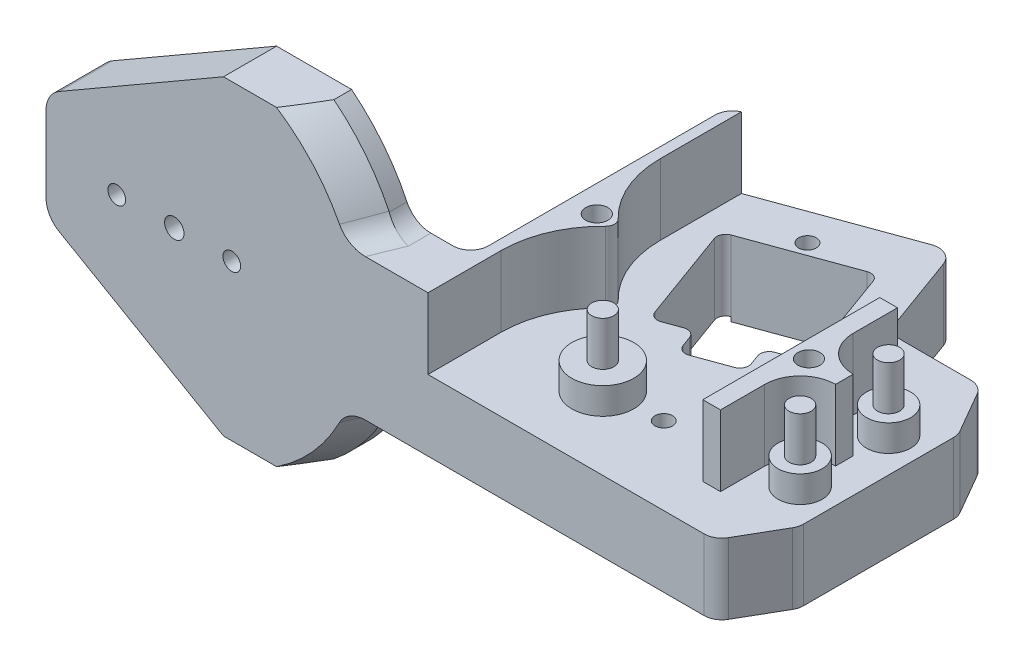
ISO-10303-21;
HEADER;
FILE_DESCRIPTION(('STEP AP214'),'2;1');
FILE_NAME('part.step','',(''),(''),'','','');
FILE_SCHEMA(('AUTOMOTIVE_DESIGN { 1 0 10303 214 1 1 1 1 }'));
ENDSEC;
DATA;
#1=APPLICATION_CONTEXT('core data for automotive mechanical design processes');
#2=APPLICATION_PROTOCOL_DEFINITION('international standard','automotive_design',2000,#1);
#3=PRODUCT_CONTEXT('',#1,'mechanical');
#4=PRODUCT('Part','Part','',(#3));
#5=PRODUCT_RELATED_PRODUCT_CATEGORY('part','',(#4));
#6=PRODUCT_DEFINITION_FORMATION('','',#4);
#7=PRODUCT_DEFINITION_CONTEXT('part definition',#1,'design');
#8=PRODUCT_DEFINITION('design','',#6,#7);
#9=PRODUCT_DEFINITION_SHAPE('','',#8);
#10=(LENGTH_UNIT() NAMED_UNIT(*) SI_UNIT(.MILLI.,.METRE.));
#11=(NAMED_UNIT(*) PLANE_ANGLE_UNIT() SI_UNIT($,.RADIAN.));
#12=(NAMED_UNIT(*) SI_UNIT($,.STERADIAN.) SOLID_ANGLE_UNIT());
#13=UNCERTAINTY_MEASURE_WITH_UNIT(LENGTH_MEASURE(1.E-05),#10,'distance_accuracy_value','');
#14=(GEOMETRIC_REPRESENTATION_CONTEXT(3) GLOBAL_UNCERTAINTY_ASSIGNED_CONTEXT((#13)) GLOBAL_UNIT_ASSIGNED_CONTEXT((#10,
#11,#12)) REPRESENTATION_CONTEXT('',''));
#15=CARTESIAN_POINT('',(0.,0.,0.));
#16=DIRECTION('',(0.,0.,1.));
#17=DIRECTION('',(1.,0.,0.));
#18=AXIS2_PLACEMENT_3D('',#15,#16,#17);
#19=CARTESIAN_POINT('',(0.,8.,0.));
#20=DIRECTION('',(0.,-1.,0.));
#21=DIRECTION('',(0.,0.,-1.));
#22=AXIS2_PLACEMENT_3D('',#19,#20,#21);
#23=PLANE('',#22);
#24=DIRECTION('',(0.,0.,-1.));
#25=VECTOR('',#24,1.);
#26=CARTESIAN_POINT('',(28.6749818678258,8.,0.));
#27=LINE('',#26,#25);
#28=CARTESIAN_POINT('',(28.6749818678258,8.,-20.2558549));
#29=VERTEX_POINT('',#28);
#30=CARTESIAN_POINT('',(28.6749818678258,8.,-29.4214919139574));
#31=VERTEX_POINT('',#30);
#32=EDGE_CURVE('E902',#29,#31,#27,.T.);
#33=ORIENTED_EDGE('',*,*,#32,.T.);
#34=CARTESIAN_POINT('',(29.5,8.,-27.5995849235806));
#35=DIRECTION('',(0.,-1.,0.));
#36=DIRECTION('',(0.,0.,-1.));
#37=AXIS2_PLACEMENT_3D('',#34,#35,#36);
#38=CIRCLE('',#37,2.);
#39=CARTESIAN_POINT('',(27.5,8.,-27.5995849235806));
#40=VERTEX_POINT('',#39);
#41=EDGE_CURVE('E1647',#31,#40,#38,.F.);
#42=ORIENTED_EDGE('',*,*,#41,.T.);
#43=DIRECTION('',(0.,0.,1.));
#44=VECTOR('',#43,1.);
#45=CARTESIAN_POINT('',(27.5,8.,0.));
#46=LINE('',#45,#44);
#47=CARTESIAN_POINT('',(27.5,8.,-2.));
#48=VERTEX_POINT('',#47);
#49=EDGE_CURVE('E1021',#40,#48,#46,.T.);
#50=ORIENTED_EDGE('',*,*,#49,.T.);
#51=CARTESIAN_POINT('',(25.5,8.,-2.));
#52=DIRECTION('',(0.,-1.,0.));
#53=DIRECTION('',(0.,0.,-1.));
#54=AXIS2_PLACEMENT_3D('',#51,#52,#53);
#55=CIRCLE('',#54,2.);
#56=CARTESIAN_POINT('',(25.5,8.,0.));
#57=VERTEX_POINT('',#56);
#58=EDGE_CURVE('E1602',#48,#57,#55,.T.);
#59=ORIENTED_EDGE('',*,*,#58,.T.);
#60=DIRECTION('',(-1.,0.,0.));
#61=VECTOR('',#60,1.);
#62=CARTESIAN_POINT('',(22.5,8.,0.));
#63=LINE('',#62,#61);
#64=CARTESIAN_POINT('',(23.0054341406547,8.,0.));
#65=VERTEX_POINT('',#64);
#66=EDGE_CURVE('E1025',#57,#65,#63,.T.);
#67=ORIENTED_EDGE('',*,*,#66,.T.);
#68=DIRECTION('',(0.,0.,1.));
#69=VECTOR('',#68,1.);
#70=CARTESIAN_POINT('',(23.0054341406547,8.,2.));
#71=LINE('',#70,#69);
#72=CARTESIAN_POINT('',(23.0054341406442,8.,2.52898094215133));
#73=VERTEX_POINT('',#72);
#74=EDGE_CURVE('E1425',#65,#73,#71,.T.);
#75=ORIENTED_EDGE('',*,*,#74,.T.);
#76=CARTESIAN_POINT('',(41.5145291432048,8.,-45.406619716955));
#77=CARTESIAN_POINT('',(39.3181242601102,8.,-46.233632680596));
#78=CARTESIAN_POINT('',(38.789488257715,10.277952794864,-46.432680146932));
#79=CARTESIAN_POINT('',(40.7242321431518,8.,-43.3077999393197));
#80=CARTESIAN_POINT('',(38.5394412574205,8.,-44.1354284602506));
#81=CARTESIAN_POINT('',(38.0026026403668,10.2650989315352,-44.3338603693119));
#82=CARTESIAN_POINT('',(39.9326848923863,8.,-41.2094498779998));
#83=CARTESIAN_POINT('',(37.7589186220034,8.,-42.0345991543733));
#84=CARTESIAN_POINT('',(37.2147288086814,10.2515831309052,-42.2355103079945));
#85=CARTESIAN_POINT('',(38.3464908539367,8.,-37.0139212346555));
#86=CARTESIAN_POINT('',(36.1956401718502,8.,-37.8329071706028));
#87=CARTESIAN_POINT('',(35.6365816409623,10.2229404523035,-38.039981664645));
#88=CARTESIAN_POINT('',(37.5518440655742,8.,-34.9167426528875));
#89=CARTESIAN_POINT('',(35.413209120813,8.,-35.7328947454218));
#90=CARTESIAN_POINT('',(34.8463083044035,10.2078135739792,-35.9428030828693));
#91=CARTESIAN_POINT('',(35.9591172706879,8.,-30.7244874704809));
#92=CARTESIAN_POINT('',(33.8460055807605,8.,-31.5337784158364));
#93=CARTESIAN_POINT('',(33.2632028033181,10.1756668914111,-31.750547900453));
#94=CARTESIAN_POINT('',(35.1610384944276,8.,-28.6294104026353));
#95=CARTESIAN_POINT('',(33.061614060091,8.,-29.4356627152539));
#96=CARTESIAN_POINT('',(32.4703715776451,10.1586477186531,-29.6554708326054));
#97=CARTESIAN_POINT('',(33.5603638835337,8.,-24.4409788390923));
#98=CARTESIAN_POINT('',(31.4896091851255,8.,-25.2397120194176));
#99=CARTESIAN_POINT('',(30.8813227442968,10.122330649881,-25.4670392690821));
#100=CARTESIAN_POINT('',(32.7577680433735,8.,-22.3476243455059));
#101=CARTESIAN_POINT('',(30.7024470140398,8.,-23.1430397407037));
#102=CARTESIAN_POINT('',(30.0851051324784,10.1030327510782,-23.3736847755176));
#103=CARTESIAN_POINT('',(31.1485231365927,8.,-18.1670551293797));
#104=CARTESIAN_POINT('',(29.1256054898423,8.,-18.9541368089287));
#105=CARTESIAN_POINT('',(28.4900843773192,10.0617138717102,-19.1931155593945));
#106=CARTESIAN_POINT('',(30.3418847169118,8.,-16.0798363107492));
#107=CARTESIAN_POINT('',(28.3364812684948,8.,-16.8633015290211));
#108=CARTESIAN_POINT('',(27.6912890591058,10.0396981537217,-17.1058967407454));
#109=CARTESIAN_POINT('',(28.7215997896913,8.,-11.9081282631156));
#110=CARTESIAN_POINT('',(26.7531561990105,8.,-12.6823705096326));
#111=CARTESIAN_POINT('',(26.0886622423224,9.99228841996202,-12.9341886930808));
#112=CARTESIAN_POINT('',(27.9079533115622,8.,-9.82363902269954));
#113=CARTESIAN_POINT('',(25.9596114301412,8.,-10.59392350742));
#114=CARTESIAN_POINT('',(25.2848307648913,9.96689441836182,-10.8496994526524));
#115=CARTESIAN_POINT('',(26.2713565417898,8.,-5.6574840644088));
#116=CARTESIAN_POINT('',(24.365642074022,8.,-6.41746160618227));
#117=CARTESIAN_POINT('',(23.6705685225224,9.9118893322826,-6.68354449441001));
#118=CARTESIAN_POINT('',(25.448403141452,8.,-3.57581956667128));
#119=CARTESIAN_POINT('',(23.5660247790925,8.,-4.33144407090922));
#120=CARTESIAN_POINT('',(22.8601355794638,9.882276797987,-4.60187999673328));
#121=CARTESIAN_POINT('',(23.790590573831,8.,0.582816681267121));
#122=CARTESIAN_POINT('',(21.957989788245,8.,-0.161236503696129));
#123=CARTESIAN_POINT('',(21.2311572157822,9.81772859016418,-0.443243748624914));
#124=CARTESIAN_POINT('',(22.955731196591,8.,2.65978834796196));
#125=CARTESIAN_POINT('',(21.1505916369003,8.,1.92049922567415));
#126=CARTESIAN_POINT('',(20.4126116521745,9.78279282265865,1.63372791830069));
#127=CARTESIAN_POINT('',(21.5338903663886,8.,6.15736270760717));
#128=CARTESIAN_POINT('',(19.7765349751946,8.,5.43411670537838));
#129=CARTESIAN_POINT('',(19.0229712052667,9.71807102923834,5.13130227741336));
#130=CARTESIAN_POINT('',(20.9512067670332,8.,7.579711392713));
#131=CARTESIAN_POINT('',(19.2155716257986,8.,6.86060774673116));
#132=CARTESIAN_POINT('',(18.4547063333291,9.69010143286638,6.5536509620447));
#133=CARTESIAN_POINT('',(19.7761318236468,8.,10.4202933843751));
#134=CARTESIAN_POINT('',(18.0864818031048,8.,9.71099523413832));
#135=CARTESIAN_POINT('',(17.3119571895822,9.6302525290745,9.39423295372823));
#136=CARTESIAN_POINT('',(19.183741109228,8.,11.8385269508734));
#137=CARTESIAN_POINT('',(17.5188709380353,8.,11.1337329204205));
#138=CARTESIAN_POINT('',(16.7374733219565,9.5983734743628,10.8124665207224));
#139=CARTESIAN_POINT('',(17.98682599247,8.,14.6684883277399));
#140=CARTESIAN_POINT('',(16.3746782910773,8.,13.9744585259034));
#141=CARTESIAN_POINT('',(15.5810909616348,9.52989035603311,13.6424278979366));
#142=CARTESIAN_POINT('',(17.3823120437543,8.,16.0802205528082));
#143=CARTESIAN_POINT('',(15.7987372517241,8.,15.391084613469));
#144=CARTESIAN_POINT('',(14.9991990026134,9.49329022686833,15.0541601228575));
#145=CARTESIAN_POINT('',(16.1563598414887,8.,18.8967288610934));
#146=CARTESIAN_POINT('',(14.6340225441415,8.,18.2194027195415));
#147=CARTESIAN_POINT('',(13.8250757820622,9.41425767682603,17.8706684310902));
#148=CARTESIAN_POINT('',(15.5349178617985,8.,20.3015033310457));
#149=CARTESIAN_POINT('',(14.0460296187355,8.,19.6295019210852));
#150=CARTESIAN_POINT('',(13.2328422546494,9.3718239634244,19.2754429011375));
#151=CARTESIAN_POINT('',(14.5843978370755,8.,22.4025233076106));
#152=CARTESIAN_POINT('',(13.1475610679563,8.,21.7455005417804));
#153=CARTESIAN_POINT('',(12.3333602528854,9.30269737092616,21.3764628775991));
#154=CARTESIAN_POINT('',(14.2640774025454,8.,23.1027300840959));
#155=CARTESIAN_POINT('',(12.8462241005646,8.,22.4489170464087));
#156=CARTESIAN_POINT('',(12.0312846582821,9.27870834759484,22.0766696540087));
#157=CARTESIAN_POINT('',(13.6163364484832,8.,24.4998325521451));
#158=CARTESIAN_POINT('',(12.2381591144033,8.,23.8528595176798));
#159=CARTESIAN_POINT('',(11.4230001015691,9.2287021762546,23.4737721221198));
#160=CARTESIAN_POINT('',(13.2889161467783,8.,25.1967283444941));
#161=CARTESIAN_POINT('',(11.9315763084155,8.,24.5531310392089));
#162=CARTESIAN_POINT('',(11.1167912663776,9.20268509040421,24.1706679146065));
#163=CARTESIAN_POINT('',(12.625639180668,8.,26.5859603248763));
#164=CARTESIAN_POINT('',(11.3119801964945,8.,25.9495553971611));
#165=CARTESIAN_POINT('',(10.4995920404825,9.14840859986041,25.5598998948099));
#166=CARTESIAN_POINT('',(12.2897879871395,8.,27.2782991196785));
#167=CARTESIAN_POINT('',(10.9991387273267,8.,26.6454366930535));
#168=CARTESIAN_POINT('',(10.1886047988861,9.12015062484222,26.252238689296));
#169=CARTESIAN_POINT('',(11.6073369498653,8.,28.6577771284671));
#170=CARTESIAN_POINT('',(10.3651273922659,8.,28.0324660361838));
#171=CARTESIAN_POINT('',(9.56049334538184,9.06112265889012,27.6317166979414));
#172=CARTESIAN_POINT('',(11.2607358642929,8.,29.3449157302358));
#173=CARTESIAN_POINT('',(10.0441499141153,8.,28.7233277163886));
#174=CARTESIAN_POINT('',(9.24336842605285,9.03035237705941,28.3188552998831));
#175=CARTESIAN_POINT('',(10.5529058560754,8.,30.7142377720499));
#176=CARTESIAN_POINT('',(9.39060556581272,8.,30.1005751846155));
#177=CARTESIAN_POINT('',(8.60048853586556,8.96594820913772,29.6881773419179));
#178=CARTESIAN_POINT('',(10.1916363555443,8.,31.3964002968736));
#179=CARTESIAN_POINT('',(9.05822954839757,8.,30.7866583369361));
#180=CARTESIAN_POINT('',(8.27471062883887,8.93230604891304,30.370339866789));
#181=CARTESIAN_POINT('',(9.45146004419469,8.,32.7508976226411));
#182=CARTESIAN_POINT('',(8.37953827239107,8.,32.1494887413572));
#183=CARTESIAN_POINT('',(7.6132596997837,8.86200397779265,31.7248371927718));
#184=CARTESIAN_POINT('',(9.07255891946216,8.,33.4232355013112));
#185=CARTESIAN_POINT('',(8.03350027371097,8.,32.8259463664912));
#186=CARTESIAN_POINT('',(7.2775898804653,8.82534503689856,32.3971750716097));
#187=CARTESIAN_POINT('',(8.48579455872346,8.,34.421934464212));
#188=CARTESIAN_POINT('',(7.49867931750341,8.,33.8329950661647));
#189=CARTESIAN_POINT('',(6.76356656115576,8.76794406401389,33.3958740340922));
#190=CARTESIAN_POINT('',(8.28690412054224,8.,34.7535660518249));
#191=CARTESIAN_POINT('',(7.31811793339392,8.,34.1668054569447));
#192=CARTESIAN_POINT('',(6.59027198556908,8.74838500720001,33.7275056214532));
#193=CARTESIAN_POINT('',(7.88198873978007,8.,35.4124104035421));
#194=CARTESIAN_POINT('',(6.95128973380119,8.,34.8300727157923));
#195=CARTESIAN_POINT('',(6.23964704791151,8.70848239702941,34.3863499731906));
#196=CARTESIAN_POINT('',(7.67596453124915,8.,35.7396236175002));
#197=CARTESIAN_POINT('',(6.76506848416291,8.,35.1595039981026));
#198=CARTESIAN_POINT('',(6.0623171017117,8.68813892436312,34.7135631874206));
#199=CARTESIAN_POINT('',(7.25515593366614,8.,36.3888986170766));
#200=CARTESIAN_POINT('',(6.38555355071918,8.,35.8132691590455));
#201=CARTESIAN_POINT('',(5.70260082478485,8.64667496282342,35.3628381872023));
#202=CARTESIAN_POINT('',(7.04036238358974,8.,36.710954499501));
#203=CARTESIAN_POINT('',(6.19230088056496,8.,36.1375809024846));
#204=CARTESIAN_POINT('',(5.52020927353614,8.6255536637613,35.6848940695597));
#205=CARTESIAN_POINT('',(6.71036386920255,8.,37.188724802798));
#206=CARTESIAN_POINT('',(5.89579932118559,8.,36.6192336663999));
#207=CARTESIAN_POINT('',(5.24212873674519,8.59336354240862,36.1626643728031));
#208=CARTESIAN_POINT('',(6.59904238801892,8.,37.3471238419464));
#209=CARTESIAN_POINT('',(5.79600058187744,8.,36.7787700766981));
#210=CARTESIAN_POINT('',(5.14866923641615,8.58254682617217,36.3210634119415));
#211=CARTESIAN_POINT('',(6.37350337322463,8.,37.6618636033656));
#212=CARTESIAN_POINT('',(5.59405457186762,8.,37.0957852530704));
#213=CARTESIAN_POINT('',(4.96007487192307,8.56076293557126,36.6358031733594));
#214=CARTESIAN_POINT('',(6.25928561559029,8.,37.8182041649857));
#215=CARTESIAN_POINT('',(5.49191396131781,8.,37.2532646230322));
#216=CARTESIAN_POINT('',(4.86493987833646,8.54979574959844,36.7921437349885));
#217=CARTESIAN_POINT('',(6.14347602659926,8.,37.9733697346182));
#218=CARTESIAN_POINT('',(5.388374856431,8.,37.40972795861));
#219=CARTESIAN_POINT('',(4.76888055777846,8.53876305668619,36.9473093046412));
#220=(BOUNDED_SURFACE() B_SPLINE_SURFACE(3,2,((#76,#77,#78),(#79,#80,#81),(#82,#83,#84),(#85,
#86,#87),(#88,#89,#90),(#91,#92,#93),(#94,#95,#96),(#97,#98,#99),(#100,#101,#102),(#103,#104,
#105),(#106,#107,#108),(#109,#110,#111),(#112,#113,#114),(#115,#116,#117),(#118,#119,#120),
(#121,#122,#123),(#124,#125,#126),(#127,#128,#129),(#130,#131,#132),(#133,#134,#135),(#136,#137,
#138),(#139,#140,#141),(#142,#143,#144),(#145,#146,#147),(#148,#149,#150),(#151,#152,#153),
(#154,#155,#156),(#157,#158,#159),(#160,#161,#162),(#163,#164,#165),(#166,#167,#168),(#169,#170,
#171),(#172,#173,#174),(#175,#176,#177),(#178,#179,#180),(#181,#182,#183),(#184,#185,#186),
(#187,#188,#189),(#190,#191,#192),(#193,#194,#195),(#196,#197,#198),(#199,#200,#201),(#202,#203,
#204),(#205,#206,#207),(#208,#209,#210),(#211,#212,#213),(#214,#215,#216),(#217,#218,#219)),
.UNSPECIFIED.,.F.,.F.,.F.) B_SPLINE_SURFACE_WITH_KNOTS((4,2,2,2,2,2,2,2,2,2,2,2,2,2,2,2,2,2,2,2,
2,2,2,4),(3,3),(0.,6.72804123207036,13.456083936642,20.1818880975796,26.9077004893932,
33.6206880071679,40.3336473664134,47.0489194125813,53.7643100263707,58.3755051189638,
62.9864022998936,67.5934813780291,72.2015828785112,74.5115420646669,76.8214304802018,
79.1298568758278,81.4385509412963,83.7541368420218,86.0689810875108,87.2290093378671,
88.3889185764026,89.5500721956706,90.130856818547,90.7116865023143),(0.,1.),
.UNSPECIFIED.) GEOMETRIC_REPRESENTATION_ITEM() RATIONAL_B_SPLINE_SURFACE(((1.,0.787617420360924,
1.),(1.,0.788977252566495,1.),(1.,0.790403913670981,1.),(1.,0.793418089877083,1.),(1.,
0.795005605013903,1.),(1.,0.798368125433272,1.),(1.,0.800143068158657,1.),(1.,0.803916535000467,
1.),(1.,0.805915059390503,1.),(1.,0.810176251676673,1.),(1.,0.812438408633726,1.),(1.,
0.817286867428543,1.),(1.,0.819873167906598,1.),(1.,0.82544506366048,1.),(1.,0.82843079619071,
1.),(1.,0.834898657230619,1.),(1.,0.838380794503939,1.),(1.,0.844784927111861,1.),(1.,
0.847540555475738,1.),(1.,0.853404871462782,1.),(1.,0.85651353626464,1.),(1.,0.863150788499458,
1.),(1.,0.866679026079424,1.),(1.,0.874245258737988,1.),(1.,0.878283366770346,1.),(1.,
0.884809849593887,1.),(1.,0.887066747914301,1.),(1.,0.891752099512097,1.),(1.,0.894180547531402,
1.),(1.,0.899224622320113,1.),(1.,0.901840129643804,1.),(1.,0.90727813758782,1.),(1.,
0.91010066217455,1.),(1.,0.915978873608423,1.),(1.,0.919035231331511,1.),(1.,0.925387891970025,
1.),(1.,0.928684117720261,1.),(1.,0.933815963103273,1.),(1.,0.935559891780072,1.),(1.,
0.939107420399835,1.),(1.,0.940911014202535,1.),(1.,0.944576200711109,1.),(1.,0.946437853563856,
1.),(1.,0.949266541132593,1.),(1.,0.950215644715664,1.),(1.,0.952124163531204,1.),(1.,
0.953083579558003,1.),(1.,0.954047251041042,1.))) REPRESENTATION_ITEM('') SURFACE());
#221=CARTESIAN_POINT('',(41.5145291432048,8.,-45.406619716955));
#222=CARTESIAN_POINT('',(40.7242321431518,8.,-43.3077999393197));
#223=CARTESIAN_POINT('',(39.9326848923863,8.,-41.2094498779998));
#224=CARTESIAN_POINT('',(38.3464908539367,8.,-37.0139212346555));
#225=CARTESIAN_POINT('',(37.5518440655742,8.,-34.9167426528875));
#226=CARTESIAN_POINT('',(35.9591172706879,8.,-30.7244874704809));
#227=CARTESIAN_POINT('',(35.1610384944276,8.,-28.6294104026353));
#228=CARTESIAN_POINT('',(33.5603638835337,8.,-24.4409788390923));
#229=CARTESIAN_POINT('',(32.7577680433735,8.,-22.3476243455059));
#230=CARTESIAN_POINT('',(31.1485231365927,8.,-18.1670551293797));
#231=CARTESIAN_POINT('',(30.3418847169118,8.,-16.0798363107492));
#232=CARTESIAN_POINT('',(28.7215997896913,8.,-11.9081282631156));
#233=CARTESIAN_POINT('',(27.9079533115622,8.,-9.82363902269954));
#234=CARTESIAN_POINT('',(26.2713565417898,8.,-5.6574840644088));
#235=CARTESIAN_POINT('',(25.448403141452,8.,-3.57581956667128));
#236=CARTESIAN_POINT('',(23.790590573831,8.,0.582816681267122));
#237=CARTESIAN_POINT('',(22.955731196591,8.,2.65978834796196));
#238=CARTESIAN_POINT('',(21.5338903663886,8.,6.15736270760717));
#239=CARTESIAN_POINT('',(20.9512067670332,8.,7.579711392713));
#240=CARTESIAN_POINT('',(19.7761318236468,8.,10.4202933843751));
#241=CARTESIAN_POINT('',(19.183741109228,8.,11.8385269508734));
#242=CARTESIAN_POINT('',(17.98682599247,8.,14.6684883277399));
#243=CARTESIAN_POINT('',(17.3823120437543,8.,16.0802205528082));
#244=CARTESIAN_POINT('',(16.1563598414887,8.,18.8967288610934));
#245=CARTESIAN_POINT('',(15.5349178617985,8.,20.3015033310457));
#246=CARTESIAN_POINT('',(14.5843978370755,8.,22.4025233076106));
#247=CARTESIAN_POINT('',(14.2640774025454,8.,23.1027300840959));
#248=CARTESIAN_POINT('',(13.6163364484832,8.,24.4998325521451));
#249=CARTESIAN_POINT('',(13.2889161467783,8.,25.1967283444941));
#250=CARTESIAN_POINT('',(12.625639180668,8.,26.5859603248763));
#251=CARTESIAN_POINT('',(12.2897879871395,8.,27.2782991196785));
#252=CARTESIAN_POINT('',(11.6073369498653,8.,28.6577771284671));
#253=CARTESIAN_POINT('',(11.2607358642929,8.,29.3449157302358));
#254=CARTESIAN_POINT('',(10.5529058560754,8.,30.7142377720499));
#255=CARTESIAN_POINT('',(10.1916363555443,8.,31.3964002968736));
#256=CARTESIAN_POINT('',(9.45146004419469,8.,32.7508976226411));
#257=CARTESIAN_POINT('',(9.07255891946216,8.,33.4232355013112));
#258=CARTESIAN_POINT('',(8.48579455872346,8.,34.421934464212));
#259=CARTESIAN_POINT('',(8.28690412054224,8.,34.7535660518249));
#260=CARTESIAN_POINT('',(7.88198873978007,8.,35.4124104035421));
#261=CARTESIAN_POINT('',(7.67596453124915,8.,35.7396236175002));
#262=CARTESIAN_POINT('',(7.25515593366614,8.,36.3888986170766));
#263=CARTESIAN_POINT('',(7.04036238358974,8.,36.710954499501));
#264=CARTESIAN_POINT('',(6.71036386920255,8.,37.188724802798));
#265=CARTESIAN_POINT('',(6.59904238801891,8.,37.3471238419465));
#266=CARTESIAN_POINT('',(6.37350337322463,8.,37.6618636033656));
#267=CARTESIAN_POINT('',(6.25928561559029,8.,37.8182041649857));
#268=CARTESIAN_POINT('',(6.14347602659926,8.,37.9733697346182));
#269=B_SPLINE_CURVE_WITH_KNOTS('',3,(#221,#222,#223,#224,#225,#226,#227,#228,#229,#230,#231,
#232,#233,#234,#235,#236,#237,#238,#239,#240,#241,#242,#243,#244,#245,#246,#247,#248,#249,#250,
#251,#252,#253,#254,#255,#256,#257,#258,#259,#260,#261,#262,#263,#264,#265,#266,#267,#268),
.UNSPECIFIED.,.F.,.F.,(4,2,2,2,2,2,2,2,2,2,2,2,2,2,2,2,2,2,2,2,2,2,2,4),(0.,6.72804123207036,
13.456083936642,20.1818880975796,26.9077004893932,33.6206880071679,40.3336473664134,
47.0489194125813,53.7643100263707,58.3755051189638,62.9864022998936,67.5934813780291,
72.2015828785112,74.5115420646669,76.8214304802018,79.1298568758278,81.4385509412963,
83.7541368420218,86.0689810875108,87.2290093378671,88.3889185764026,89.5500721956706,
90.130856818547,90.7116865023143),.UNSPECIFIED.);
#270=CARTESIAN_POINT('',(21.5966506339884,8.,6.));
#271=VERTEX_POINT('',#270);
#272=EDGE_CURVE('E1419',#73,#271,#269,.T.);
#273=ORIENTED_EDGE('',*,*,#272,.T.);
#274=DIRECTION('',(1.,0.,0.));
#275=VECTOR('',#274,1.);
#276=CARTESIAN_POINT('',(21.0441190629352,8.,6.));
#277=LINE('',#276,#275);
#278=CARTESIAN_POINT('',(28.6749818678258,8.,6.));
#279=VERTEX_POINT('',#278);
#280=EDGE_CURVE('E1018',#271,#279,#277,.T.);
#281=ORIENTED_EDGE('',*,*,#280,.T.);
#282=CARTESIAN_POINT('',(28.6749818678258,8.,-2.25585490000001));
#283=VERTEX_POINT('',#282);
#284=EDGE_CURVE('E984',#279,#283,#27,.T.);
#285=ORIENTED_EDGE('',*,*,#284,.T.);
#286=CARTESIAN_POINT('',(40.1749818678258,8.,-2.25585490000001));
#287=DIRECTION('',(0.,1.,0.));
#288=DIRECTION('',(0.,0.,1.));
#289=AXIS2_PLACEMENT_3D('',#286,#287,#288);
#290=CIRCLE('',#289,11.5);
#291=CARTESIAN_POINT('',(32.194280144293,8.,-10.5358549));
#292=VERTEX_POINT('',#291);
#293=EDGE_CURVE('E981',#283,#292,#290,.F.);
#294=ORIENTED_EDGE('',*,*,#293,.T.);
#295=CARTESIAN_POINT('',(31.5003060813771,8.,-11.2558549));
#296=DIRECTION('',(0.,1.,0.));
#297=DIRECTION('',(0.,0.,1.));
#298=AXIS2_PLACEMENT_3D('',#295,#296,#297);
#299=CIRCLE('',#298,1.);
#300=CARTESIAN_POINT('',(32.194280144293,8.,-11.9758549));
#301=VERTEX_POINT('',#300);
#302=EDGE_CURVE('E978',#301,#292,#299,.F.);
#303=ORIENTED_EDGE('',*,*,#302,.F.);
#304=CARTESIAN_POINT('',(40.1749818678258,8.,-20.2558549));
#305=DIRECTION('',(0.,1.,0.));
#306=DIRECTION('',(0.,0.,1.));
#307=AXIS2_PLACEMENT_3D('',#304,#305,#306);
#308=CIRCLE('',#307,11.5);
#309=EDGE_CURVE('E976',#29,#301,#308,.T.);
#310=ORIENTED_EDGE('',*,*,#309,.F.);
#311=EDGE_LOOP('',(#33,#42,#50,#59,#67,#75,#273,#281,#285,#294,#303,#310));
#312=FACE_BOUND('',#311,.T.);
#313=CARTESIAN_POINT('',(30.5,8.,-11.2558549));
#314=DIRECTION('',(0.,1.,0.));
#315=DIRECTION('',(0.,0.,1.));
#316=AXIS2_PLACEMENT_3D('',#313,#314,#315);
#317=CIRCLE('',#316,1.24999999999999);
#318=CARTESIAN_POINT('',(30.5,8.,-10.0058549));
#319=VERTEX_POINT('',#318);
#320=EDGE_CURVE('E547',#319,#319,#317,.T.);
#321=ORIENTED_EDGE('',*,*,#320,.F.);
#322=EDGE_LOOP('',(#321));
#323=FACE_BOUND('',#322,.T.);
#324=ADVANCED_FACE('F39',(#312,#323),#23,.F.);
#325=CARTESIAN_POINT('',(0.,0.,6.));
#326=DIRECTION('',(0.,0.,1.));
#327=DIRECTION('',(1.,0.,0.));
#328=AXIS2_PLACEMENT_3D('',#325,#326,#327);
#329=PLANE('',#328);
#330=CARTESIAN_POINT('',(-6.5,0.,6.));
#331=DIRECTION('',(0.,0.,-1.));
#332=DIRECTION('',(-1.,0.,0.));
#333=AXIS2_PLACEMENT_3D('',#330,#331,#332);
#334=CIRCLE('',#333,1.);
#335=CARTESIAN_POINT('',(-7.5,0.,6.));
#336=VERTEX_POINT('',#335);
#337=EDGE_CURVE('E821',#336,#336,#334,.F.);
#338=ORIENTED_EDGE('',*,*,#337,.F.);
#339=EDGE_LOOP('',(#338));
#340=FACE_BOUND('',#339,.T.);
#341=CARTESIAN_POINT('',(0.,0.,6.));
#342=DIRECTION('',(0.,0.,-1.));
#343=DIRECTION('',(-1.,0.,0.));
#344=AXIS2_PLACEMENT_3D('',#341,#342,#343);
#345=CIRCLE('',#344,1.1);
#346=CARTESIAN_POINT('',(-1.1,0.,6.));
#347=VERTEX_POINT('',#346);
#348=EDGE_CURVE('E828',#347,#347,#345,.T.);
#349=ORIENTED_EDGE('',*,*,#348,.T.);
#350=EDGE_LOOP('',(#349));
#351=FACE_BOUND('',#350,.T.);
#352=CARTESIAN_POINT('',(6.5,0.,6.));
#353=DIRECTION('',(0.,0.,-1.));
#354=DIRECTION('',(-1.,0.,0.));
#355=AXIS2_PLACEMENT_3D('',#352,#353,#354);
#356=CIRCLE('',#355,1.);
#357=CARTESIAN_POINT('',(5.5,0.,6.));
#358=VERTEX_POINT('',#357);
#359=EDGE_CURVE('E824',#358,#358,#356,.T.);
#360=ORIENTED_EDGE('',*,*,#359,.T.);
#361=EDGE_LOOP('',(#360));
#362=FACE_BOUND('',#361,.T.);
#363=DIRECTION('',(0.,-1.,0.));
#364=VECTOR('',#363,1.);
#365=CARTESIAN_POINT('',(-14.5,0.,6.));
#366=LINE('',#365,#364);
#367=CARTESIAN_POINT('',(-14.5,4.26794919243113,6.));
#368=VERTEX_POINT('',#367);
#369=CARTESIAN_POINT('',(-14.5,-4.26794919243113,6.));
#370=VERTEX_POINT('',#369);
#371=EDGE_CURVE('E563',#368,#370,#366,.T.);
#372=ORIENTED_EDGE('',*,*,#371,.T.);
#373=CARTESIAN_POINT('',(-11.5,-4.26794919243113,6.));
#374=DIRECTION('',(0.,0.,1.));
#375=DIRECTION('',(1.,0.,0.));
#376=AXIS2_PLACEMENT_3D('',#373,#374,#375);
#377=CIRCLE('',#376,3.);
#378=CARTESIAN_POINT('',(-13.,-6.86602540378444,6.));
#379=VERTEX_POINT('',#378);
#380=EDGE_CURVE('E47',#370,#379,#377,.T.);
#381=ORIENTED_EDGE('',*,*,#380,.T.);
#382=DIRECTION('',(-0.866025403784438,0.500000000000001,0.));
#383=VECTOR('',#382,1.);
#384=CARTESIAN_POINT('',(-6.22307621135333,-10.7786841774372,6.));
#385=LINE('',#384,#383);
#386=CARTESIAN_POINT('',(5.56215035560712,-17.5828879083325,6.));
#387=VERTEX_POINT('',#386);
#388=EDGE_CURVE('E565',#387,#379,#385,.T.);
#389=ORIENTED_EDGE('',*,*,#388,.F.);
#390=DIRECTION('',(1.,0.,0.));
#391=VECTOR('',#390,1.);
#392=CARTESIAN_POINT('',(0.,-17.5828879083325,6.));
#393=LINE('',#392,#391);
#394=CARTESIAN_POINT('',(11.5627418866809,-17.5828879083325,6.));
#395=VERTEX_POINT('',#394);
#396=EDGE_CURVE('E568',#387,#395,#393,.T.);
#397=ORIENTED_EDGE('',*,*,#396,.T.);
#398=CARTESIAN_POINT('',(0.,0.,6.));
#399=DIRECTION('',(0.,0.,1.));
#400=DIRECTION('',(1.,0.,0.));
#401=AXIS2_PLACEMENT_3D('',#398,#399,#400);
#402=CIRCLE('',#401,21.0441190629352);
#403=CARTESIAN_POINT('',(18.6749818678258,-9.70051541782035,6.));
#404=VERTEX_POINT('',#403);
#405=EDGE_CURVE('E1027',#395,#404,#402,.T.);
#406=ORIENTED_EDGE('',*,*,#405,.T.);
#407=CARTESIAN_POINT('',(38.789485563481,-10.2779527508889,-46.432672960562));
#408=CARTESIAN_POINT('',(39.3181215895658,-8.,-46.2336254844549));
#409=CARTESIAN_POINT('',(41.5145264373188,-8.,-45.406612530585));
#410=CARTESIAN_POINT('',(38.0025999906,-10.2650988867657,-44.3338533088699));
#411=CARTESIAN_POINT('',(38.5394386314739,-8.,-44.1354213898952));
#412=CARTESIAN_POINT('',(40.7242294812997,-8.,-43.3077928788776));
#413=CARTESIAN_POINT('',(37.2147262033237,-10.2515830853,-42.235503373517));
#414=CARTESIAN_POINT('',(37.7589160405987,-8.,-42.034592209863));
#415=CARTESIAN_POINT('',(39.932682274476,-8.,-41.2094429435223));
#416=CARTESIAN_POINT('',(35.6365791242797,-10.2229404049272,-38.0399749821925));
#417=CARTESIAN_POINT('',(36.1956376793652,-8.,-37.8329004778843));
#418=CARTESIAN_POINT('',(38.3464883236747,-8.,-37.013914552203));
#419=CARTESIAN_POINT('',(34.8463058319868,-10.2078135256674,-35.9427965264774));
#420=CARTESIAN_POINT('',(35.4132066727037,-8.,-35.7328881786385));
#421=CARTESIAN_POINT('',(37.5518415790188,-8.,-34.9167360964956));
#422=CARTESIAN_POINT('',(33.26320041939,-10.175666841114,-31.7505415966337));
#423=CARTESIAN_POINT('',(33.8460032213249,-8.,-31.5337721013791));
#424=CARTESIAN_POINT('',(35.9591148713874,-8.,-30.7244811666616));
#425=CARTESIAN_POINT('',(32.4703692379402,-10.1586476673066,-29.6554646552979));
#426=CARTESIAN_POINT('',(33.0616117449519,-8.,-29.435656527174));
#427=CARTESIAN_POINT('',(35.1610361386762,-8.,-28.6294042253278));
#428=CARTESIAN_POINT('',(30.8813204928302,-10.1223305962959,-25.4670333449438));
#429=CARTESIAN_POINT('',(31.4896069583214,-8.,-25.2397060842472));
#430=CARTESIAN_POINT('',(33.5603616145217,-8.,-24.4409729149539));
#431=CARTESIAN_POINT('',(30.085102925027,-10.103032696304,-23.3736789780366));
#432=CARTESIAN_POINT('',(30.7024448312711,-8.,-23.1430339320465));
#433=CARTESIAN_POINT('',(32.7577658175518,-8.,-22.3476185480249));
#434=CARTESIAN_POINT('',(28.4900822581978,-10.0617138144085,-19.1931100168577));
#435=CARTESIAN_POINT('',(29.1256033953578,-8.,-18.9541312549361));
#436=CARTESIAN_POINT('',(31.1485209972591,-8.,-18.1670495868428));
#437=CARTESIAN_POINT('',(27.6912869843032,-10.0396980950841,-17.1058913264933));
#438=CARTESIAN_POINT('',(28.3364792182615,-8.,-16.8632961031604));
#439=CARTESIAN_POINT('',(30.3418826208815,-8.,-16.0798308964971));
#440=CARTESIAN_POINT('',(26.088660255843,-9.99228835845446,-12.9341835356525));
#441=CARTESIAN_POINT('',(26.753154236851,-8.,-12.6823653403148));
#442=CARTESIAN_POINT('',(28.7215977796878,-8.,-11.9081231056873));
#443=CARTESIAN_POINT('',(25.2848288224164,-9.96689435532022,-10.8496944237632));
#444=CARTESIAN_POINT('',(25.9596095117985,-8.,-10.5939184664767));
#445=CARTESIAN_POINT('',(27.9079513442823,-8.,-9.82363399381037));
#446=CARTESIAN_POINT('',(23.6705666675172,-9.91188926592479,-6.68353972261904));
#447=CARTESIAN_POINT('',(24.3656402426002,-8.,-6.41745682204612));
#448=CARTESIAN_POINT('',(26.2713546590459,-8.,-5.65747929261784));
#449=CARTESIAN_POINT('',(22.8601337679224,-9.88227672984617,-4.60187535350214));
#450=CARTESIAN_POINT('',(23.5660229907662,-8.,-4.33143941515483));
#451=CARTESIAN_POINT('',(25.4484013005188,-8.,-3.57581492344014));
#452=CARTESIAN_POINT('',(21.231155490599,-9.81772851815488,-0.443239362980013));
#453=CARTESIAN_POINT('',(21.9579880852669,-8.,-0.161232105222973));
#454=CARTESIAN_POINT('',(23.7905888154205,-8.,0.582821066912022));
#455=CARTESIAN_POINT('',(20.4126099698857,-9.78279274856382,1.63373217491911));
#456=CARTESIAN_POINT('',(21.1505899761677,-8.,1.92050349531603));
#457=CARTESIAN_POINT('',(22.9557294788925,-8.,2.65979260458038));
#458=CARTESIAN_POINT('',(19.0229695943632,-9.7180709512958,5.13130631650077));
#459=CARTESIAN_POINT('',(19.7765333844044,-8.,5.43412075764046));
#460=CARTESIAN_POINT('',(21.5338887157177,-8.,6.15736674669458));
#461=CARTESIAN_POINT('',(18.4547047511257,-9.69010135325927,6.55365491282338));
#462=CARTESIAN_POINT('',(19.2155700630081,-8.,6.86061171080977));
#463=CARTESIAN_POINT('',(20.9512051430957,-8.,7.57971534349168));
#464=CARTESIAN_POINT('',(17.3119556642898,-9.63025244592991,9.39423672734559));
#465=CARTESIAN_POINT('',(18.0864802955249,-8.,9.71099902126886));
#466=CARTESIAN_POINT('',(19.7761302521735,-8.,10.4202971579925));
#467=CARTESIAN_POINT('',(16.7374718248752,-9.59837338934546,10.8124702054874));
#468=CARTESIAN_POINT('',(17.5188694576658,-8.,11.1337366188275));
#469=CARTESIAN_POINT('',(19.183739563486,-8.,11.8385306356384));
#470=CARTESIAN_POINT('',(15.5810895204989,-9.52989026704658,13.6424314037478));
#471=CARTESIAN_POINT('',(16.3746768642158,-8.,13.9744620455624));
#472=CARTESIAN_POINT('',(17.9868244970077,-8.,14.668491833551));
#473=CARTESIAN_POINT('',(14.9991975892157,-9.4932901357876,15.0541635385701));
#474=CARTESIAN_POINT('',(15.7987358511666,-8.,15.3910880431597));
#475=CARTESIAN_POINT('',(17.3823105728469,-8.,16.0802239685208));
#476=CARTESIAN_POINT('',(13.8250744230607,-9.41425758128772,17.8706716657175));
#477=CARTESIAN_POINT('',(14.6340211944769,-8.,18.2194059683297));
#478=CARTESIAN_POINT('',(16.1563584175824,-8.,18.8967320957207));
#479=CARTESIAN_POINT('',(13.2328409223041,-9.37182386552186,19.2754460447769));
#480=CARTESIAN_POINT('',(14.0460282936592,-8.,19.629505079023));
#481=CARTESIAN_POINT('',(15.5349164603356,-8.,20.301506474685));
#482=CARTESIAN_POINT('',(12.3333589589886,-9.30269726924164,21.3764658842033));
#483=CARTESIAN_POINT('',(13.1475597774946,-8.,21.7455035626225));
#484=CARTESIAN_POINT('',(14.584396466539,-8.,22.4025263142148));
#485=CARTESIAN_POINT('',(12.0312833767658,-9.27870824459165,22.0766726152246));
#486=CARTESIAN_POINT('',(12.8462228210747,-8.,22.44892002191));
#487=CARTESIAN_POINT('',(14.2640760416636,-8.,23.1027330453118));
#488=CARTESIAN_POINT('',(11.4229988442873,-9.22870207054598,23.473774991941));
#489=CARTESIAN_POINT('',(12.2381578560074,-8.,23.8528624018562));
#490=CARTESIAN_POINT('',(13.6163351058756,-8.,24.4998354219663));
#491=CARTESIAN_POINT('',(11.1167900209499,-9.20268498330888,24.1706707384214));
#492=CARTESIAN_POINT('',(11.9315750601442,-8.,24.5531338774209));
#493=CARTESIAN_POINT('',(13.2889148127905,-8.,25.196731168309));
#494=CARTESIAN_POINT('',(10.4995908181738,-9.14840848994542,25.5599026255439));
#495=CARTESIAN_POINT('',(11.3119789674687,-8.,25.9495581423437));
#496=CARTESIAN_POINT('',(12.6256378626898,-8.,26.5859630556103));
#497=CARTESIAN_POINT('',(10.1886035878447,-9.12015051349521,26.2522413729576));
#498=CARTESIAN_POINT('',(10.9991375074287,-8.,26.6454393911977));
#499=CARTESIAN_POINT('',(12.2897866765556,-8.,27.2783018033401));
#500=CARTESIAN_POINT('',(9.56049215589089,-9.0611225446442,27.6317192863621));
#501=CARTESIAN_POINT('',(10.3651261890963,-8.,28.032468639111));
#502=CARTESIAN_POINT('',(11.607335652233,-8.,28.6577797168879));
#503=CARTESIAN_POINT('',(9.24336724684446,-9.03035226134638,28.3188578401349));
#504=CARTESIAN_POINT('',(10.0441487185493,-8.,28.7233302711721));
#505=CARTESIAN_POINT('',(11.2607345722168,-8.,29.3449182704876));
#506=CARTESIAN_POINT('',(8.60048737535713,-8.96594809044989,29.6881797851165));
#507=CARTESIAN_POINT('',(9.39060438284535,-8.,30.1005776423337));
#508=CARTESIAN_POINT('',(10.5529045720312,-8.,30.7142402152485));
#509=CARTESIAN_POINT('',(8.274709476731,-8.93230592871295,30.3703422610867));
#510=CARTESIAN_POINT('',(9.05822837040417,-8.,30.7866607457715));
#511=CARTESIAN_POINT('',(10.1916350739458,-8.,31.3964026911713));
#512=CARTESIAN_POINT('',(7.61325856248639,-8.86200385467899,31.7248394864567));
#513=CARTESIAN_POINT('',(8.37953710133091,-8.,32.1494910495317));
#514=CARTESIAN_POINT('',(9.45145876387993,-8.,32.7508999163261));
#515=CARTESIAN_POINT('',(7.27758874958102,-8.82534491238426,32.397177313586));
#516=CARTESIAN_POINT('',(8.03349910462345,-8.,32.8259486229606));
#517=CARTESIAN_POINT('',(9.07255763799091,-8.,33.4232377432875));
#518=CARTESIAN_POINT('',(6.76356543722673,-8.76794393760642,33.3958761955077));
#519=CARTESIAN_POINT('',(7.49867814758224,-8.,33.8329972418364));
#520=CARTESIAN_POINT('',(8.48579327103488,-8.,34.4219366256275));
#521=CARTESIAN_POINT('',(6.59027086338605,-8.74838488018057,33.727507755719));
#522=CARTESIAN_POINT('',(7.31811676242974,-8.,34.1668076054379));
#523=CARTESIAN_POINT('',(8.2869028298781,-8.,34.7535681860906));
#524=CARTESIAN_POINT('',(6.23964592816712,-8.7084822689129,34.3863520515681));
#525=CARTESIAN_POINT('',(6.95128855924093,-8.,34.8300748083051));
#526=CARTESIAN_POINT('',(7.88198744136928,-8.,35.4124124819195));
#527=CARTESIAN_POINT('',(6.06231598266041,-8.68813879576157,34.71356523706));
#528=CARTESIAN_POINT('',(6.76506730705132,-8.,35.1595060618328));
#529=CARTESIAN_POINT('',(7.67596322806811,-8.,35.7396256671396));
#530=CARTESIAN_POINT('',(5.70259970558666,-8.64667483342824,35.3628401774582));
#531=CARTESIAN_POINT('',(6.38555236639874,-8.,35.8132711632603));
#532=CARTESIAN_POINT('',(7.25515461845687,-8.,36.3889006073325));
#533=CARTESIAN_POINT('',(5.52020815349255,-8.62555353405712,35.6848960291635));
#534=CARTESIAN_POINT('',(6.19229969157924,-8.,36.1375828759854));
#535=CARTESIAN_POINT('',(7.04036106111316,-8.,36.7109564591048));
#536=CARTESIAN_POINT('',(5.2421276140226,-8.59336341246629,36.1626662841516));
#537=CARTESIAN_POINT('',(5.89579812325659,-8.,36.6192355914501));
#538=CARTESIAN_POINT('',(6.71036253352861,-8.,37.1887267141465));
#539=CARTESIAN_POINT('',(5.14866811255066,-8.58254669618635,36.3210653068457));
#540=CARTESIAN_POINT('',(5.79599938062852,-8.,36.7787719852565));
#541=CARTESIAN_POINT('',(6.5990410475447,-8.,37.3471257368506));
#542=CARTESIAN_POINT('',(4.960073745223,-8.56076280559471,36.6358050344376));
#543=CARTESIAN_POINT('',(5.59405336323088,-8.,37.0957871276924));
#544=CARTESIAN_POINT('',(6.37350202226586,-8.,37.6618654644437));
#545=CARTESIAN_POINT('',(4.86493874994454,-8.54979561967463,36.7921455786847));
#546=CARTESIAN_POINT('',(5.49191274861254,-8.,37.2532664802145));
#547=CARTESIAN_POINT('',(6.25928425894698,-8.,37.8182060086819));
#548=CARTESIAN_POINT('',(4.76887942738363,-8.53876292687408,36.9473111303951));
#549=CARTESIAN_POINT('',(5.3883736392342,-8.,37.4097297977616));
#550=CARTESIAN_POINT('',(6.14347466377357,-8.,37.9733715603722));
#551=(BOUNDED_SURFACE() B_SPLINE_SURFACE(3,2,((#407,#408,#409),(#410,#411,#412),(#413,#414,
#415),(#416,#417,#418),(#419,#420,#421),(#422,#423,#424),(#425,#426,#427),(#428,#429,#430),
(#431,#432,#433),(#434,#435,#436),(#437,#438,#439),(#440,#441,#442),(#443,#444,#445),(#446,#447,
#448),(#449,#450,#451),(#452,#453,#454),(#455,#456,#457),(#458,#459,#460),(#461,#462,#463),
(#464,#465,#466),(#467,#468,#469),(#470,#471,#472),(#473,#474,#475),(#476,#477,#478),(#479,#480,
#481),(#482,#483,#484),(#485,#486,#487),(#488,#489,#490),(#491,#492,#493),(#494,#495,#496),
(#497,#498,#499),(#500,#501,#502),(#503,#504,#505),(#506,#507,#508),(#509,#510,#511),(#512,#513,
#514),(#515,#516,#517),(#518,#519,#520),(#521,#522,#523),(#524,#525,#526),(#527,#528,#529),
(#530,#531,#532),(#533,#534,#535),(#536,#537,#538),(#539,#540,#541),(#542,#543,#544),(#545,#546,
#547),(#548,#549,#550)),.UNSPECIFIED.,.F.,.F.,.F.) B_SPLINE_SURFACE_WITH_KNOTS((4,2,2,2,2,2,2,2,
2,2,2,2,2,2,2,2,2,2,2,2,2,2,2,4),(3,3),(0.,6.72804083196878,13.4560831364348,20.1818868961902,
26.9076988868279,33.6206859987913,40.3336449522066,47.0489165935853,53.7643068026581,
58.3755016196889,62.9863985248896,67.5934773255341,72.2015785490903,74.5115375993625,
76.8214258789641,79.1298521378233,81.4385460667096,83.7541318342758,86.0689759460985,
87.2290041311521,88.3889133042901,89.5500668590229,90.1308514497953,90.7116811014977),(0.,1.),
.UNSPECIFIED.) GEOMETRIC_REPRESENTATION_ITEM() RATIONAL_B_SPLINE_SURFACE(((1.,0.787617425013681,
1.),(1.,0.788977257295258,1.),(1.,0.79040391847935,1.),(1.,0.793418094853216,1.),(1.,
0.795005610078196,1.),(1.,0.798368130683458,1.),(1.,0.80014307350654,1.),(1.,0.803916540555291,
1.),(1.,0.805915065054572,1.),(1.,0.810176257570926,1.),(1.,0.812438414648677,1.),(1.,
0.817286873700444,1.),(1.,0.819873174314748,1.),(1.,0.825445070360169,1.),(1.,0.828430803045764,
1.),(1.,0.834898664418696,1.),(1.,0.838380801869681,1.),(1.,0.844784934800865,1.),(1.,
0.847540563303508,1.),(1.,0.853404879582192,1.),(1.,0.85651354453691,1.),(1.,0.86315079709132,
1.),(1.,0.866679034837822,1.),(1.,0.874245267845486,1.),(1.,0.878283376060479,1.),(1.,
0.884809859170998,1.),(1.,0.887066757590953,1.),(1.,0.891752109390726,1.),(1.,0.894180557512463,
1.),(1.,0.899224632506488,1.),(1.,0.901840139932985,1.),(1.,0.907278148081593,1.),(1.,
0.910100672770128,1.),(1.,0.915978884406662,1.),(1.,0.919035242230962,1.),(1.,0.925387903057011,
1.),(1.,0.928684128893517,1.),(1.,0.933815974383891,1.),(1.,0.935559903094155,1.),(1.,
0.939107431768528,1.),(1.,0.940911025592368,1.),(1.,0.944576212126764,1.),(1.,0.946437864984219,
1.),(1.,0.949266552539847,1.),(1.,0.950215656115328,1.),(1.,0.952124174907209,1.),(1.,
0.953083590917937,1.),(1.,0.954047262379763,1.))) REPRESENTATION_ITEM('') SURFACE());
#552=CARTESIAN_POINT('',(18.6749818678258,-9.70051541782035,6.));
#553=CARTESIAN_POINT('',(18.7148840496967,-9.6236769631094,6.));
#554=CARTESIAN_POINT('',(18.7582270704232,-9.5486449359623,6.));
#555=CARTESIAN_POINT('',(18.8512958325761,-9.40269353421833,6.));
#556=CARTESIAN_POINT('',(18.9010187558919,-9.33177236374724,6.));
#557=CARTESIAN_POINT('',(19.0061910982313,-9.19472580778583,6.));
#558=CARTESIAN_POINT('',(19.0616188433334,-9.12858378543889,6.));
#559=CARTESIAN_POINT('',(19.1778226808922,-9.00120057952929,6.));
#560=CARTESIAN_POINT('',(19.2385992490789,-8.93995983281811,6.));
#561=CARTESIAN_POINT('',(19.4279925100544,-8.76428956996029,6.));
#562=CARTESIAN_POINT('',(19.5639249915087,-8.65758625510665,6.));
#563=CARTESIAN_POINT('',(19.85100018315,-8.46699496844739,6.));
#564=CARTESIAN_POINT('',(20.0021601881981,-8.38313334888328,6.));
#565=CARTESIAN_POINT('',(20.3245576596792,-8.23544199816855,6.));
#566=CARTESIAN_POINT('',(20.4964499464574,-8.17304290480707,6.));
#567=CARTESIAN_POINT('',(20.8478005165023,-8.07626987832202,6.));
#568=CARTESIAN_POINT('',(21.0272501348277,-8.0418647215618,6.));
#569=CARTESIAN_POINT('',(21.2726509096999,-8.01442191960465,6.));
#570=CARTESIAN_POINT('',(21.3373952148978,-8.00900957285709,6.));
#571=CARTESIAN_POINT('',(21.4669685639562,-8.00180334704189,6.));
#572=CARTESIAN_POINT('',(21.5317972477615,-8.00000299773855,6.));
#573=CARTESIAN_POINT('',(21.5966506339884,-8.,6.));
#574=B_SPLINE_CURVE_WITH_KNOTS('',3,(#552,#553,#554,#555,#556,#557,#558,#559,#560,#561,#562,
#563,#564,#565,#566,#567,#568,#569,#570,#571,#572,#573),.UNSPECIFIED.,.F.,.F.,(4,2,2,2,2,2,2,2,
2,2,4),(0.,0.259631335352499,0.519148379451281,0.777713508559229,1.03630165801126,
1.55225712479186,2.0688053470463,2.61508183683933,3.16074818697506,3.3555831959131,
3.55006888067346),.UNSPECIFIED.);
#575=CARTESIAN_POINT('',(21.5966506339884,-8.,6.));
#576=VERTEX_POINT('',#575);
#577=EDGE_CURVE('E1466',#404,#576,#574,.T.);
#578=ORIENTED_EDGE('',*,*,#577,.T.);
#579=DIRECTION('',(1.,0.,0.));
#580=VECTOR('',#579,1.);
#581=CARTESIAN_POINT('',(21.0441190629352,-8.,6.));
#582=LINE('',#581,#580);
#583=CARTESIAN_POINT('',(59.8894185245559,-8.,6.));
#584=VERTEX_POINT('',#583);
#585=EDGE_CURVE('E1028',#576,#584,#582,.T.);
#586=ORIENTED_EDGE('',*,*,#585,.T.);
#587=DIRECTION('',(0.,-1.,0.));
#588=VECTOR('',#587,1.);
#589=CARTESIAN_POINT('',(59.8894185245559,0.,6.));
#590=LINE('',#589,#588);
#591=CARTESIAN_POINT('',(59.8894185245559,0.,6.));
#592=VERTEX_POINT('',#591);
#593=EDGE_CURVE('E1609',#584,#592,#590,.F.);
#594=ORIENTED_EDGE('',*,*,#593,.T.);
#595=DIRECTION('',(1.,0.,0.));
#596=VECTOR('',#595,1.);
#597=CARTESIAN_POINT('',(0.,0.,6.));
#598=LINE('',#597,#596);
#599=CARTESIAN_POINT('',(28.6749818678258,0.,6.));
#600=VERTEX_POINT('',#599);
#601=EDGE_CURVE('E931',#600,#592,#598,.T.);
#602=ORIENTED_EDGE('',*,*,#601,.F.);
#603=DIRECTION('',(0.,1.,0.));
#604=VECTOR('',#603,1.);
#605=CARTESIAN_POINT('',(28.6749818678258,0.,6.));
#606=LINE('',#605,#604);
#607=EDGE_CURVE('E990',#600,#279,#606,.T.);
#608=ORIENTED_EDGE('',*,*,#607,.T.);
#609=ORIENTED_EDGE('',*,*,#280,.F.);
#610=CARTESIAN_POINT('',(21.5966506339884,8.,6.));
#611=CARTESIAN_POINT('',(21.4998146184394,8.00000485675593,6.));
#612=CARTESIAN_POINT('',(21.4030239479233,8.00402045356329,6.));
#613=CARTESIAN_POINT('',(21.2100984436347,8.0200663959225,6.));
#614=CARTESIAN_POINT('',(21.1139636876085,8.0320976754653,6.));
#615=CARTESIAN_POINT('',(20.827277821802,8.08022826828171,6.));
#616=CARTESIAN_POINT('',(20.638596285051,8.12836431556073,6.));
#617=CARTESIAN_POINT('',(20.2719743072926,8.25601272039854,6.));
#618=CARTESIAN_POINT('',(20.0940469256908,8.33556237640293,6.));
#619=CARTESIAN_POINT('',(19.7548858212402,8.52463075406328,6.));
#620=CARTESIAN_POINT('',(19.5936409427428,8.63412926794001,6.));
#621=CARTESIAN_POINT('',(19.3117448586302,8.86587967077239,6.));
#622=CARTESIAN_POINT('',(19.1885454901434,8.98504694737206,6.));
#623=CARTESIAN_POINT('',(18.9639042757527,9.24215699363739,6.));
#624=CARTESIAN_POINT('',(18.8624103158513,9.38005346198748,6.));
#625=CARTESIAN_POINT('',(18.7562521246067,9.5540661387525,6.));
#626=CARTESIAN_POINT('',(18.7392866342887,9.58297910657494,6.));
#627=CARTESIAN_POINT('',(18.7063736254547,9.64134215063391,6.));
#628=CARTESIAN_POINT('',(18.6904251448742,9.67079168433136,6.));
#629=CARTESIAN_POINT('',(18.6749818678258,9.70051541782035,6.));
#630=B_SPLINE_CURVE_WITH_KNOTS('',3,(#610,#611,#612,#613,#614,#615,#616,#617,#618,#619,#620,
#621,#622,#623,#624,#625,#626,#627,#628,#629),.UNSPECIFIED.,.F.,.F.,(4,2,2,2,2,2,2,2,2,4),(0.,
0.29033369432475,0.5807012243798,1.16188418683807,1.74375929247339,2.3252427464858,
2.83728498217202,3.34808366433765,3.44864313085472,3.54910601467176),.UNSPECIFIED.);
#631=CARTESIAN_POINT('',(18.6749818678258,9.70051541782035,6.));
#632=VERTEX_POINT('',#631);
#633=EDGE_CURVE('E1488',#271,#632,#630,.T.);
#634=ORIENTED_EDGE('',*,*,#633,.T.);
#635=CARTESIAN_POINT('',(11.5627418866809,17.5828879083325,6.));
#636=VERTEX_POINT('',#635);
#637=EDGE_CURVE('E1054',#632,#636,#402,.T.);
#638=ORIENTED_EDGE('',*,*,#637,.T.);
#639=DIRECTION('',(1.,0.,0.));
#640=VECTOR('',#639,1.);
#641=CARTESIAN_POINT('',(0.,17.5828879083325,6.));
#642=LINE('',#641,#640);
#643=CARTESIAN_POINT('',(5.56215035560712,17.5828879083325,6.));
#644=VERTEX_POINT('',#643);
#645=EDGE_CURVE('E558',#644,#636,#642,.T.);
#646=ORIENTED_EDGE('',*,*,#645,.F.);
#647=DIRECTION('',(-0.866025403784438,-0.500000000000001,0.));
#648=VECTOR('',#647,1.);
#649=CARTESIAN_POINT('',(-6.22307621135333,10.7786841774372,6.));
#650=LINE('',#649,#648);
#651=CARTESIAN_POINT('',(-13.,6.86602540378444,6.));
#652=VERTEX_POINT('',#651);
#653=EDGE_CURVE('E560',#644,#652,#650,.T.);
#654=ORIENTED_EDGE('',*,*,#653,.T.);
#655=CARTESIAN_POINT('',(-11.5,4.26794919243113,6.));
#656=DIRECTION('',(0.,0.,1.));
#657=DIRECTION('',(1.,0.,0.));
#658=AXIS2_PLACEMENT_3D('',#655,#656,#657);
#659=CIRCLE('',#658,3.);
#660=EDGE_CURVE('E1565',#652,#368,#659,.T.);
#661=ORIENTED_EDGE('',*,*,#660,.T.);
#662=EDGE_LOOP('',(#372,#381,#389,#397,#406,#578,#586,#594,#602,#608,#609,#634,#638,#646,#654,#661));
#663=FACE_BOUND('',#662,.T.);
#664=ADVANCED_FACE('F1090',(#340,#351,#362,#663),#329,.T.);
#665=CARTESIAN_POINT('',(0.,0.,2.));
#666=DIRECTION('',(0.,0.,-1.));
#667=DIRECTION('',(-1.,0.,0.));
#668=AXIS2_PLACEMENT_3D('',#665,#666,#667);
#669=CYLINDRICAL_SURFACE('',#668,22.5);
#670=DIRECTION('',(0.,0.,-1.));
#671=VECTOR('',#670,1.);
#672=CARTESIAN_POINT('',(14.0389477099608,17.5828879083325,6.));
#673=LINE('',#672,#671);
#674=CARTESIAN_POINT('',(14.0389477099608,17.5828879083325,2.));
#675=VERTEX_POINT('',#674);
#676=CARTESIAN_POINT('',(14.0389477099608,17.5828879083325,0.));
#677=VERTEX_POINT('',#676);
#678=EDGE_CURVE('E582',#675,#677,#673,.T.);
#679=ORIENTED_EDGE('',*,*,#678,.F.);
#680=CARTESIAN_POINT('',(0.,0.,2.));
#681=DIRECTION('',(0.,0.,1.));
#682=DIRECTION('',(1.,0.,0.));
#683=AXIS2_PLACEMENT_3D('',#680,#681,#682);
#684=CIRCLE('',#683,22.5);
#685=CARTESIAN_POINT('',(20.2656046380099,9.77523752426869,2.));
#686=VERTEX_POINT('',#685);
#687=EDGE_CURVE('E1058',#686,#675,#684,.T.);
#688=ORIENTED_EDGE('',*,*,#687,.F.);
#689=CARTESIAN_POINT('',(20.2656046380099,9.77523752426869,2.));
#690=CARTESIAN_POINT('',(20.2711848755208,9.76366873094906,2.00002638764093));
#691=CARTESIAN_POINT('',(20.2767506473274,9.7521047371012,2.00030682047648));
#692=CARTESIAN_POINT('',(20.2878532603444,9.72898634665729,2.00137577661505));
#693=CARTESIAN_POINT('',(20.2933901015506,9.71743195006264,2.00216429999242));
#694=CARTESIAN_POINT('',(20.2989124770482,9.70588235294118,2.00320686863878));
#695=B_SPLINE_CURVE_WITH_KNOTS('',3,(#689,#690,#691,#692,#693,#694),.UNSPECIFIED.,.F.,.F.,(4,2,
4),(0.,0.0385102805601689,0.0770205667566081),.UNSPECIFIED.);
#696=CARTESIAN_POINT('',(20.2989124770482,9.70588235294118,2.00320686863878));
#697=VERTEX_POINT('',#696);
#698=EDGE_CURVE('E1483',#686,#697,#695,.T.);
#699=ORIENTED_EDGE('',*,*,#698,.T.);
#700=DIRECTION('',(0.,0.,-1.));
#701=VECTOR('',#700,1.);
#702=CARTESIAN_POINT('',(20.2989124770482,9.70588235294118,2.));
#703=LINE('',#702,#701);
#704=CARTESIAN_POINT('',(20.2989124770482,9.70588235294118,0.));
#705=VERTEX_POINT('',#704);
#706=EDGE_CURVE('E1438',#697,#705,#703,.T.);
#707=ORIENTED_EDGE('',*,*,#706,.T.);
#708=CARTESIAN_POINT('',(0.,0.,0.));
#709=DIRECTION('',(0.,0.,1.));
#710=DIRECTION('',(1.,0.,0.));
#711=AXIS2_PLACEMENT_3D('',#708,#709,#710);
#712=CIRCLE('',#711,22.5);
#713=EDGE_CURVE('E1063',#705,#677,#712,.T.);
#714=ORIENTED_EDGE('',*,*,#713,.T.);
#715=EDGE_LOOP('',(#679,#688,#699,#707,#714));
#716=FACE_BOUND('',#715,.T.);
#717=ADVANCED_FACE('F1480',(#716),#669,.T.);
#718=CARTESIAN_POINT('',(0.,0.,0.));
#719=DIRECTION('',(0.,0.,1.));
#720=DIRECTION('',(1.,0.,0.));
#721=AXIS2_PLACEMENT_3D('',#718,#719,#720);
#722=PLANE('',#721);
#723=CARTESIAN_POINT('',(0.,0.,0.));
#724=DIRECTION('',(0.,0.,-1.));
#725=DIRECTION('',(-1.,0.,0.));
#726=AXIS2_PLACEMENT_3D('',#723,#724,#725);
#727=CIRCLE('',#726,4.5);
#728=CARTESIAN_POINT('',(3.35410196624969,-3.,0.));
#729=VERTEX_POINT('',#728);
#730=CARTESIAN_POINT('',(-3.35410196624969,-3.,0.));
#731=VERTEX_POINT('',#730);
#732=EDGE_CURVE('E864',#729,#731,#727,.T.);
#733=ORIENTED_EDGE('',*,*,#732,.F.);
#734=DIRECTION('',(-1.,0.,0.));
#735=VECTOR('',#734,1.);
#736=CARTESIAN_POINT('',(0.,-3.,0.));
#737=LINE('',#736,#735);
#738=CARTESIAN_POINT('',(6.5,-3.,0.));
#739=VERTEX_POINT('',#738);
#740=EDGE_CURVE('E841',#739,#729,#737,.T.);
#741=ORIENTED_EDGE('',*,*,#740,.F.);
#742=CARTESIAN_POINT('',(6.5,0.,0.));
#743=DIRECTION('',(0.,0.,-1.));
#744=DIRECTION('',(-1.,0.,0.));
#745=AXIS2_PLACEMENT_3D('',#742,#743,#744);
#746=CIRCLE('',#745,3.);
#747=CARTESIAN_POINT('',(6.5,3.,0.));
#748=VERTEX_POINT('',#747);
#749=EDGE_CURVE('E846',#748,#739,#746,.T.);
#750=ORIENTED_EDGE('',*,*,#749,.F.);
#751=DIRECTION('',(1.,0.,0.));
#752=VECTOR('',#751,1.);
#753=CARTESIAN_POINT('',(0.,3.,0.));
#754=LINE('',#753,#752);
#755=CARTESIAN_POINT('',(3.35410196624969,3.,0.));
#756=VERTEX_POINT('',#755);
#757=EDGE_CURVE('E877',#756,#748,#754,.T.);
#758=ORIENTED_EDGE('',*,*,#757,.F.);
#759=CARTESIAN_POINT('',(-3.3541017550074,3.00000023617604,0.));
#760=VERTEX_POINT('',#759);
#761=EDGE_CURVE('E868',#760,#756,#727,.T.);
#762=ORIENTED_EDGE('',*,*,#761,.F.);
#763=DIRECTION('',(-0.999999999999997,-7.5074276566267E-08,0.));
#764=VECTOR('',#763,1.);
#765=CARTESIAN_POINT('',(-2.25222866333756E-07,3.00000048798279,0.));
#766=LINE('',#765,#764);
#767=CARTESIAN_POINT('',(-6.50000007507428,3.,0.));
#768=VERTEX_POINT('',#767);
#769=EDGE_CURVE('E874',#760,#768,#766,.T.);
#770=ORIENTED_EDGE('',*,*,#769,.T.);
#771=CARTESIAN_POINT('',(-6.5,0.,0.));
#772=DIRECTION('',(0.,0.,-1.));
#773=DIRECTION('',(-1.,0.,0.));
#774=AXIS2_PLACEMENT_3D('',#771,#772,#773);
#775=CIRCLE('',#774,3.);
#776=CARTESIAN_POINT('',(-6.5,-3.,0.));
#777=VERTEX_POINT('',#776);
#778=EDGE_CURVE('E871',#768,#777,#775,.F.);
#779=ORIENTED_EDGE('',*,*,#778,.T.);
#780=DIRECTION('',(1.,0.,0.));
#781=VECTOR('',#780,1.);
#782=CARTESIAN_POINT('',(0.,-3.,0.));
#783=LINE('',#782,#781);
#784=EDGE_CURVE('E867',#777,#731,#783,.T.);
#785=ORIENTED_EDGE('',*,*,#784,.T.);
#786=EDGE_LOOP('',(#733,#741,#750,#758,#762,#770,#779,#785));
#787=FACE_BOUND('',#786,.T.);
#788=DIRECTION('',(-0.866025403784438,0.500000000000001,0.));
#789=VECTOR('',#788,1.);
#790=CARTESIAN_POINT('',(-6.22307621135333,-10.7786841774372,0.));
#791=LINE('',#790,#789);
#792=CARTESIAN_POINT('',(5.56215035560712,-17.5828879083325,0.));
#793=VERTEX_POINT('',#792);
#794=CARTESIAN_POINT('',(-13.,-6.86602540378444,0.));
#795=VERTEX_POINT('',#794);
#796=EDGE_CURVE('E578',#793,#795,#791,.T.);
#797=ORIENTED_EDGE('',*,*,#796,.T.);
#798=CARTESIAN_POINT('',(-11.5,-4.26794919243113,0.));
#799=DIRECTION('',(0.,0.,1.));
#800=DIRECTION('',(1.,0.,0.));
#801=AXIS2_PLACEMENT_3D('',#798,#799,#800);
#802=CIRCLE('',#801,3.);
#803=CARTESIAN_POINT('',(-14.5,-4.26794919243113,0.));
#804=VERTEX_POINT('',#803);
#805=EDGE_CURVE('E1572',#795,#804,#802,.F.);
#806=ORIENTED_EDGE('',*,*,#805,.T.);
#807=DIRECTION('',(0.,-1.,0.));
#808=VECTOR('',#807,1.);
#809=CARTESIAN_POINT('',(-14.5,0.,0.));
#810=LINE('',#809,#808);
#811=CARTESIAN_POINT('',(-14.5,4.26794919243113,0.));
#812=VERTEX_POINT('',#811);
#813=EDGE_CURVE('E576',#812,#804,#810,.T.);
#814=ORIENTED_EDGE('',*,*,#813,.F.);
#815=CARTESIAN_POINT('',(-11.5,4.26794919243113,0.));
#816=DIRECTION('',(0.,0.,1.));
#817=DIRECTION('',(1.,0.,0.));
#818=AXIS2_PLACEMENT_3D('',#815,#816,#817);
#819=CIRCLE('',#818,3.);
#820=CARTESIAN_POINT('',(-13.,6.86602540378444,0.));
#821=VERTEX_POINT('',#820);
#822=EDGE_CURVE('E1574',#812,#821,#819,.F.);
#823=ORIENTED_EDGE('',*,*,#822,.T.);
#824=DIRECTION('',(-0.866025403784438,-0.500000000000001,0.));
#825=VECTOR('',#824,1.);
#826=CARTESIAN_POINT('',(-6.22307621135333,10.7786841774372,0.));
#827=LINE('',#826,#825);
#828=CARTESIAN_POINT('',(5.56215035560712,17.5828879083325,0.));
#829=VERTEX_POINT('',#828);
#830=EDGE_CURVE('E574',#829,#821,#827,.T.);
#831=ORIENTED_EDGE('',*,*,#830,.F.);
#832=DIRECTION('',(1.,0.,0.));
#833=VECTOR('',#832,1.);
#834=CARTESIAN_POINT('',(0.,17.5828879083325,0.));
#835=LINE('',#834,#833);
#836=EDGE_CURVE('E557',#829,#677,#835,.T.);
#837=ORIENTED_EDGE('',*,*,#836,.T.);
#838=ORIENTED_EDGE('',*,*,#713,.F.);
#839=CARTESIAN_POINT('',(23.0054341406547,11.,0.));
#840=DIRECTION('',(0.,0.,1.));
#841=DIRECTION('',(1.,0.,0.));
#842=AXIS2_PLACEMENT_3D('',#839,#840,#841);
#843=CIRCLE('',#842,3.);
#844=EDGE_CURVE('E1468',#705,#65,#843,.T.);
#845=ORIENTED_EDGE('',*,*,#844,.T.);
#846=ORIENTED_EDGE('',*,*,#66,.F.);
#847=DIRECTION('',(0.,-1.,0.));
#848=VECTOR('',#847,1.);
#849=CARTESIAN_POINT('',(25.5,-8.,0.));
#850=LINE('',#849,#848);
#851=CARTESIAN_POINT('',(25.5,-8.,0.));
#852=VERTEX_POINT('',#851);
#853=EDGE_CURVE('E1492',#57,#852,#850,.T.);
#854=ORIENTED_EDGE('',*,*,#853,.T.);
#855=DIRECTION('',(-1.,0.,0.));
#856=VECTOR('',#855,1.);
#857=CARTESIAN_POINT('',(22.5,-8.,0.));
#858=LINE('',#857,#856);
#859=CARTESIAN_POINT('',(23.0054341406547,-8.,0.));
#860=VERTEX_POINT('',#859);
#861=EDGE_CURVE('E1022',#852,#860,#858,.T.);
#862=ORIENTED_EDGE('',*,*,#861,.T.);
#863=CARTESIAN_POINT('',(23.0054341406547,-11.,0.));
#864=DIRECTION('',(0.,0.,1.));
#865=DIRECTION('',(1.,0.,0.));
#866=AXIS2_PLACEMENT_3D('',#863,#864,#865);
#867=CIRCLE('',#866,3.);
#868=CARTESIAN_POINT('',(20.2989124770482,-9.70588235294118,0.));
#869=VERTEX_POINT('',#868);
#870=EDGE_CURVE('E1465',#860,#869,#867,.T.);
#871=ORIENTED_EDGE('',*,*,#870,.T.);
#872=CARTESIAN_POINT('',(14.0389477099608,-17.5828879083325,0.));
#873=VERTEX_POINT('',#872);
#874=EDGE_CURVE('E1057',#873,#869,#712,.T.);
#875=ORIENTED_EDGE('',*,*,#874,.F.);
#876=DIRECTION('',(1.,0.,0.));
#877=VECTOR('',#876,1.);
#878=CARTESIAN_POINT('',(0.,-17.5828879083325,0.));
#879=LINE('',#878,#877);
#880=EDGE_CURVE('E561',#793,#873,#879,.T.);
#881=ORIENTED_EDGE('',*,*,#880,.F.);
#882=EDGE_LOOP('',(#797,#806,#814,#823,#831,#837,#838,#845,#846,#854,#862,#871,#875,#881));
#883=FACE_BOUND('',#882,.T.);
#884=ADVANCED_FACE('F1093',(#787,#883),#722,.F.);
#885=CARTESIAN_POINT('',(0.,0.,2.));
#886=DIRECTION('',(0.,0.,-1.));
#887=DIRECTION('',(1.,0.,0.));
#888=AXIS2_PLACEMENT_3D('',#885,#886,#887);
#889=CONICAL_SURFACE('',#888,22.5,0.349065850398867);
#890=CARTESIAN_POINT('',(7.33772052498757,17.5828879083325,11.4717601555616));
#891=CARTESIAN_POINT('',(7.54845132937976,17.5828879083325,11.2487044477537));
#892=CARTESIAN_POINT('',(7.75513728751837,17.5828879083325,11.0218940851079));
#893=CARTESIAN_POINT('',(8.16119230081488,17.5828879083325,10.5619138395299));
#894=CARTESIAN_POINT('',(8.36056329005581,17.5828879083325,10.3287456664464));
#895=CARTESIAN_POINT('',(8.75265184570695,17.5828879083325,9.85734493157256));
#896=CARTESIAN_POINT('',(8.94537664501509,17.5828879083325,9.61911836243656));
#897=CARTESIAN_POINT('',(9.32509792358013,17.5828879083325,9.13812402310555));
#898=CARTESIAN_POINT('',(9.51209396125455,17.5828879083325,8.89535590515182));
#899=CARTESIAN_POINT('',(10.0640791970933,17.5828879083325,8.16301618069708));
#900=CARTESIAN_POINT('',(10.4214648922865,17.5828879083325,7.66770549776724));
#901=CARTESIAN_POINT('',(11.1197937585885,17.5828879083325,6.66547405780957));
#902=CARTESIAN_POINT('',(11.4607313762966,17.5828879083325,6.15854946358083));
#903=CARTESIAN_POINT('',(12.2203237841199,17.5828879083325,4.99596264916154));
#904=CARTESIAN_POINT('',(12.6347364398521,17.5828879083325,4.33753373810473));
#905=CARTESIAN_POINT('',(13.4459213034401,17.5828879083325,3.00986728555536));
#906=CARTESIAN_POINT('',(13.842691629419,17.5828879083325,2.34062860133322));
#907=CARTESIAN_POINT('',(14.6219829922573,17.5828879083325,0.993542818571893));
#908=CARTESIAN_POINT('',(15.0044977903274,17.5828879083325,0.315692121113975));
#909=CARTESIAN_POINT('',(15.7575830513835,17.5828879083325,-1.04661661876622));
#910=CARTESIAN_POINT('',(16.1281532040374,17.5828879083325,-1.731074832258));
#911=CARTESIAN_POINT('',(16.8627732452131,17.5828879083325,-3.1119452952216));
#912=CARTESIAN_POINT('',(17.2267258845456,17.5828879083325,-3.80840917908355));
#913=CARTESIAN_POINT('',(17.9459441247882,17.5828879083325,-5.2058205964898));
#914=CARTESIAN_POINT('',(18.3012095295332,17.5828879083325,-5.9067682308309));
#915=CARTESIAN_POINT('',(19.0037580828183,17.5828879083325,-7.31132731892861));
#916=CARTESIAN_POINT('',(19.3510524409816,17.5828879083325,-8.01493317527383));
#917=CARTESIAN_POINT('',(20.0391443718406,17.5828879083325,-9.42526133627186));
#918=CARTESIAN_POINT('',(20.3799423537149,17.5828879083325,-10.1319834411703));
#919=CARTESIAN_POINT('',(20.7179809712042,17.5828879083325,-10.8400111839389));
#920=B_SPLINE_CURVE_WITH_KNOTS('',3,(#890,#891,#892,#893,#894,#895,#896,#897,#898,#899,#900,
#901,#902,#903,#904,#905,#906,#907,#908,#909,#910,#911,#912,#913,#914,#915,#916,#917,#918,#919),
.UNSPECIFIED.,.F.,.F.,(4,2,2,2,2,2,2,2,2,2,2,2,2,2,4),(0.,0.92045137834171,1.84065760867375,
2.75982858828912,3.67907024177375,5.51094510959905,7.34343420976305,9.67702281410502,
12.0108597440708,14.3457063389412,16.680613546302,19.0380218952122,21.3954834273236,
23.7493966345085,26.1031610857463),.UNSPECIFIED.);
#921=EDGE_CURVE('E1120',#636,#675,#920,.T.);
#922=ORIENTED_EDGE('',*,*,#921,.F.);
#923=ORIENTED_EDGE('',*,*,#637,.F.);
#924=CARTESIAN_POINT('',(4.76888055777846,8.53876305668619,36.9473093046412));
#925=CARTESIAN_POINT('',(4.86493987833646,8.54979574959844,36.7921437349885));
#926=CARTESIAN_POINT('',(4.96007487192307,8.56076293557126,36.6358031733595));
#927=CARTESIAN_POINT('',(5.14866923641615,8.58254682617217,36.3210634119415));
#928=CARTESIAN_POINT('',(5.24212873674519,8.59336354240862,36.1626643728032));
#929=CARTESIAN_POINT('',(5.52020927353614,8.6255536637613,35.6848940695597));
#930=CARTESIAN_POINT('',(5.70260082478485,8.64667496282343,35.3628381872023));
#931=CARTESIAN_POINT('',(6.0623171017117,8.68813892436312,34.7135631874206));
#932=CARTESIAN_POINT('',(6.2396470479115,8.70848239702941,34.3863499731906));
#933=CARTESIAN_POINT('',(6.59027198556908,8.74838500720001,33.7275056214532));
#934=CARTESIAN_POINT('',(6.76356656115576,8.76794406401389,33.3958740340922));
#935=CARTESIAN_POINT('',(7.2775898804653,8.82534503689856,32.3971750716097));
#936=CARTESIAN_POINT('',(7.6132596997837,8.86200397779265,31.7248371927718));
#937=CARTESIAN_POINT('',(8.27471062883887,8.93230604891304,30.370339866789));
#938=CARTESIAN_POINT('',(8.60048853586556,8.96594820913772,29.6881773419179));
#939=CARTESIAN_POINT('',(9.24336842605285,9.03035237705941,28.3188552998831));
#940=CARTESIAN_POINT('',(9.56049334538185,9.06112265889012,27.6317166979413));
#941=CARTESIAN_POINT('',(10.1886047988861,9.12015062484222,26.252238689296));
#942=CARTESIAN_POINT('',(10.4995920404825,9.14840859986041,25.5598998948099));
#943=CARTESIAN_POINT('',(11.1167912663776,9.20268509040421,24.1706679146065));
#944=CARTESIAN_POINT('',(11.4230001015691,9.2287021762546,23.4737721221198));
#945=CARTESIAN_POINT('',(12.0312846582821,9.27870834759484,22.0766696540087));
#946=CARTESIAN_POINT('',(12.3333602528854,9.30269737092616,21.3764628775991));
#947=CARTESIAN_POINT('',(13.2328422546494,9.3718239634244,19.2754429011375));
#948=CARTESIAN_POINT('',(13.8250757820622,9.41425767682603,17.8706684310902));
#949=CARTESIAN_POINT('',(14.9991990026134,9.49329022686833,15.0541601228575));
#950=CARTESIAN_POINT('',(15.5810909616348,9.52989035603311,13.6424278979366));
#951=CARTESIAN_POINT('',(16.7374733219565,9.5983734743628,10.8124665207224));
#952=CARTESIAN_POINT('',(17.3119571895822,9.6302525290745,9.39423295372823));
#953=CARTESIAN_POINT('',(18.4547063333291,9.69010143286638,6.5536509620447));
#954=CARTESIAN_POINT('',(19.0229712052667,9.71807102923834,5.13130227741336));
#955=CARTESIAN_POINT('',(20.4126116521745,9.78279282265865,1.63372791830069));
#956=CARTESIAN_POINT('',(21.2311572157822,9.81772859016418,-0.443243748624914));
#957=CARTESIAN_POINT('',(22.8601355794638,9.882276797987,-4.60187999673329));
#958=CARTESIAN_POINT('',(23.6705685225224,9.9118893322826,-6.68354449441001));
#959=CARTESIAN_POINT('',(25.2848307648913,9.96689441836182,-10.8496994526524));
#960=CARTESIAN_POINT('',(26.0886622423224,9.99228841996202,-12.9341886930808));
#961=CARTESIAN_POINT('',(27.6912890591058,10.0396981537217,-17.1058967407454));
#962=CARTESIAN_POINT('',(28.4900843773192,10.0617138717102,-19.1931155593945));
#963=CARTESIAN_POINT('',(30.0851051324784,10.1030327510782,-23.3736847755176));
#964=CARTESIAN_POINT('',(30.8813227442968,10.122330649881,-25.4670392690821));
#965=CARTESIAN_POINT('',(32.4703715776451,10.1586477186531,-29.6554708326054));
#966=CARTESIAN_POINT('',(33.2632028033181,10.1756668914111,-31.750547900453));
#967=CARTESIAN_POINT('',(34.8463083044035,10.2078135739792,-35.9428030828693));
#968=CARTESIAN_POINT('',(35.6365816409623,10.2229404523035,-38.039981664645));
#969=CARTESIAN_POINT('',(37.2147288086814,10.2515831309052,-42.2355103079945));
#970=CARTESIAN_POINT('',(38.0026026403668,10.2650989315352,-44.3338603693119));
#971=CARTESIAN_POINT('',(38.789488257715,10.277952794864,-46.432680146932));
#972=B_SPLINE_CURVE_WITH_KNOTS('',3,(#924,#925,#926,#927,#928,#929,#930,#931,#932,#933,#934,
#935,#936,#937,#938,#939,#940,#941,#942,#943,#944,#945,#946,#947,#948,#949,#950,#951,#952,#953,
#954,#955,#956,#957,#958,#959,#960,#961,#962,#963,#964,#965,#966,#967,#968,#969,#970,#971),
.UNSPECIFIED.,.F.,.F.,(4,2,2,2,2,2,2,2,2,2,2,2,2,2,2,2,2,2,2,2,2,2,2,4),(0.,0.580829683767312,
1.1616143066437,2.32276792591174,3.48267716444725,4.64270541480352,6.95754966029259,
9.27313556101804,11.5818296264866,13.8902560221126,16.2001444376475,18.5101036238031,
23.1182051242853,27.7252842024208,32.3361813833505,36.9473764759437,43.6627670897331,
50.378039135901,57.0909984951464,63.8039860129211,70.5297984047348,77.2556025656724,
83.983645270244,90.7116865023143),.UNSPECIFIED.);
#973=EDGE_CURVE('E1061',#632,#686,#972,.T.);
#974=ORIENTED_EDGE('',*,*,#973,.T.);
#975=ORIENTED_EDGE('',*,*,#687,.T.);
#976=EDGE_LOOP('',(#922,#923,#974,#975));
#977=FACE_BOUND('',#976,.T.);
#978=ADVANCED_FACE('F1089',(#977),#889,.T.);
#979=CARTESIAN_POINT('',(0.,-8.,0.));
#980=DIRECTION('',(0.,-1.,0.));
#981=DIRECTION('',(0.,0.,-1.));
#982=AXIS2_PLACEMENT_3D('',#979,#980,#981);
#983=PLANE('',#982);
#984=DIRECTION('',(0.,0.,1.));
#985=VECTOR('',#984,1.);
#986=CARTESIAN_POINT('',(27.5,-8.,0.));
#987=LINE('',#986,#985);
#988=CARTESIAN_POINT('',(27.5,-8.,-27.5995849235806));
#989=VERTEX_POINT('',#988);
#990=CARTESIAN_POINT('',(27.5,-8.,-2.));
#991=VERTEX_POINT('',#990);
#992=EDGE_CURVE('E1050',#989,#991,#987,.T.);
#993=ORIENTED_EDGE('',*,*,#992,.F.);
#994=CARTESIAN_POINT('',(29.5,-8.,-27.5995849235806));
#995=DIRECTION('',(0.,-1.,0.));
#996=DIRECTION('',(0.,0.,-1.));
#997=AXIS2_PLACEMENT_3D('',#994,#995,#996);
#998=CIRCLE('',#997,2.);
#999=CARTESIAN_POINT('',(28.8159597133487,-8.,-29.4789701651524));
#1000=VERTEX_POINT('',#999);
#1001=EDGE_CURVE('E1709',#989,#1000,#998,.T.);
#1002=ORIENTED_EDGE('',*,*,#1001,.T.);
#1003=DIRECTION('',(-0.939692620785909,0.,0.342020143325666));
#1004=VECTOR('',#1003,1.);
#1005=CARTESIAN_POINT('',(27.5,-8.,-29.));
#1006=LINE('',#1005,#1004);
#1007=CARTESIAN_POINT('',(44.4144671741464,-8.,-35.156362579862));
#1008=VERTEX_POINT('',#1007);
#1009=EDGE_CURVE('E1047',#1008,#1000,#1006,.T.);
#1010=ORIENTED_EDGE('',*,*,#1009,.F.);
#1011=CARTESIAN_POINT('',(45.0985074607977,-8.,-33.2769773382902));
#1012=DIRECTION('',(0.,-1.,0.));
#1013=DIRECTION('',(0.,0.,-1.));
#1014=AXIS2_PLACEMENT_3D('',#1011,#1012,#1013);
#1015=CIRCLE('',#1014,2.);
#1016=CARTESIAN_POINT('',(46.9778927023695,-8.,-33.9610176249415));
#1017=VERTEX_POINT('',#1016);
#1018=EDGE_CURVE('E1706',#1008,#1017,#1015,.T.);
#1019=ORIENTED_EDGE('',*,*,#1018,.T.);
#1020=DIRECTION('',(-0.342020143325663,0.,-0.93969262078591));
#1021=VECTOR('',#1020,1.);
#1022=CARTESIAN_POINT('',(46.2938524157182,-8.,-35.8404028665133));
#1023=LINE('',#1022,#1021);
#1024=CARTESIAN_POINT('',(50.0791746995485,-8.,-25.4403153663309));
#1025=VERTEX_POINT('',#1024);
#1026=EDGE_CURVE('E1044',#1025,#1017,#1023,.T.);
#1027=ORIENTED_EDGE('',*,*,#1026,.F.);
#1028=CARTESIAN_POINT('',(51.9585599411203,-8.,-26.1243556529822));
#1029=DIRECTION('',(0.,-1.,0.));
#1030=DIRECTION('',(0.,0.,-1.));
#1031=AXIS2_PLACEMENT_3D('',#1028,#1029,#1030);
#1032=CIRCLE('',#1031,2.);
#1033=CARTESIAN_POINT('',(51.9585599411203,-8.,-24.1243556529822));
#1034=VERTEX_POINT('',#1033);
#1035=EDGE_CURVE('E1605',#1025,#1034,#1032,.F.);
#1036=ORIENTED_EDGE('',*,*,#1035,.T.);
#1037=DIRECTION('',(-1.,0.,0.));
#1038=VECTOR('',#1037,1.);
#1039=CARTESIAN_POINT('',(61.0441190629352,-8.,-24.1243556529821));
#1040=LINE('',#1039,#1038);
#1041=CARTESIAN_POINT('',(59.8894185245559,-8.,-24.1243556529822));
#1042=VERTEX_POINT('',#1041);
#1043=EDGE_CURVE('E1041',#1042,#1034,#1040,.T.);
#1044=ORIENTED_EDGE('',*,*,#1043,.F.);
#1045=CARTESIAN_POINT('',(59.8894185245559,-8.,-22.1243556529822));
#1046=DIRECTION('',(0.,-1.,0.));
#1047=DIRECTION('',(0.,0.,-1.));
#1048=AXIS2_PLACEMENT_3D('',#1045,#1046,#1047);
#1049=CIRCLE('',#1048,2.);
#1050=CARTESIAN_POINT('',(61.6214693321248,-8.,-23.1243556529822));
#1051=VERTEX_POINT('',#1050);
#1052=EDGE_CURVE('E1703',#1042,#1051,#1049,.T.);
#1053=ORIENTED_EDGE('',*,*,#1052,.T.);
#1054=DIRECTION('',(-0.499999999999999,0.,-0.86602540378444));
#1055=VECTOR('',#1054,1.);
#1056=CARTESIAN_POINT('',(64.5441190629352,-8.,-18.0621778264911));
#1057=LINE('',#1056,#1055);
#1058=CARTESIAN_POINT('',(64.276169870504,-8.,-18.5262794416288));
#1059=VERTEX_POINT('',#1058);
#1060=EDGE_CURVE('E1038',#1059,#1051,#1057,.T.);
#1061=ORIENTED_EDGE('',*,*,#1060,.F.);
#1062=CARTESIAN_POINT('',(62.5441190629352,-8.,-17.5262794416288));
#1063=DIRECTION('',(0.,-1.,0.));
#1064=DIRECTION('',(0.,0.,-1.));
#1065=AXIS2_PLACEMENT_3D('',#1062,#1063,#1064);
#1066=CIRCLE('',#1065,2.);
#1067=CARTESIAN_POINT('',(64.5441190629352,-8.,-17.5262794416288));
#1068=VERTEX_POINT('',#1067);
#1069=EDGE_CURVE('E1707',#1059,#1068,#1066,.T.);
#1070=ORIENTED_EDGE('',*,*,#1069,.T.);
#1071=DIRECTION('',(0.,0.,-1.));
#1072=VECTOR('',#1071,1.);
#1073=CARTESIAN_POINT('',(64.5441190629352,-8.,-0.0621778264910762));
#1074=LINE('',#1073,#1072);
#1075=CARTESIAN_POINT('',(64.5441190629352,-8.,-0.598076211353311));
#1076=VERTEX_POINT('',#1075);
#1077=EDGE_CURVE('E1035',#1076,#1068,#1074,.T.);
#1078=ORIENTED_EDGE('',*,*,#1077,.F.);
#1079=CARTESIAN_POINT('',(62.5441190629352,-8.,-0.598076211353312));
#1080=DIRECTION('',(0.,-1.,0.));
#1081=DIRECTION('',(0.,0.,-1.));
#1082=AXIS2_PLACEMENT_3D('',#1079,#1080,#1081);
#1083=CIRCLE('',#1082,2.);
#1084=CARTESIAN_POINT('',(64.276169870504,-8.,0.401923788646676));
#1085=VERTEX_POINT('',#1084);
#1086=EDGE_CURVE('E1711',#1076,#1085,#1083,.T.);
#1087=ORIENTED_EDGE('',*,*,#1086,.T.);
#1088=DIRECTION('',(0.499999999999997,0.,-0.86602540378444));
#1089=VECTOR('',#1088,1.);
#1090=CARTESIAN_POINT('',(61.0441190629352,-8.,6.));
#1091=LINE('',#1090,#1089);
#1092=CARTESIAN_POINT('',(61.6214693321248,-8.,4.99999999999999));
#1093=VERTEX_POINT('',#1092);
#1094=EDGE_CURVE('E1031',#1093,#1085,#1091,.T.);
#1095=ORIENTED_EDGE('',*,*,#1094,.F.);
#1096=CARTESIAN_POINT('',(59.8894185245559,-8.,4.));
#1097=DIRECTION('',(0.,-1.,0.));
#1098=DIRECTION('',(0.,0.,-1.));
#1099=AXIS2_PLACEMENT_3D('',#1096,#1097,#1098);
#1100=CIRCLE('',#1099,2.);
#1101=EDGE_CURVE('E1724',#1093,#584,#1100,.T.);
#1102=ORIENTED_EDGE('',*,*,#1101,.T.);
#1103=ORIENTED_EDGE('',*,*,#585,.F.);
#1104=CARTESIAN_POINT('',(6.14347466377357,-8.,37.9733715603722));
#1105=CARTESIAN_POINT('',(6.25928425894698,-8.,37.8182060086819));
#1106=CARTESIAN_POINT('',(6.37350202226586,-8.,37.6618654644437));
#1107=CARTESIAN_POINT('',(6.5990410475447,-8.,37.3471257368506));
#1108=CARTESIAN_POINT('',(6.71036253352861,-8.,37.1887267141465));
#1109=CARTESIAN_POINT('',(7.04036106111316,-8.,36.7109564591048));
#1110=CARTESIAN_POINT('',(7.25515461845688,-8.,36.3889006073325));
#1111=CARTESIAN_POINT('',(7.67596322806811,-8.,35.7396256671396));
#1112=CARTESIAN_POINT('',(7.88198744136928,-8.,35.4124124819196));
#1113=CARTESIAN_POINT('',(8.28690282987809,-8.,34.7535681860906));
#1114=CARTESIAN_POINT('',(8.48579327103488,-8.,34.4219366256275));
#1115=CARTESIAN_POINT('',(9.07255763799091,-8.,33.4232377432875));
#1116=CARTESIAN_POINT('',(9.45145876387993,-8.,32.7508999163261));
#1117=CARTESIAN_POINT('',(10.1916350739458,-8.,31.3964026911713));
#1118=CARTESIAN_POINT('',(10.5529045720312,-8.,30.7142402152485));
#1119=CARTESIAN_POINT('',(11.2607345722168,-8.,29.3449182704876));
#1120=CARTESIAN_POINT('',(11.607335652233,-8.,28.6577797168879));
#1121=CARTESIAN_POINT('',(12.2897866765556,-8.,27.2783018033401));
#1122=CARTESIAN_POINT('',(12.6256378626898,-8.,26.5859630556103));
#1123=CARTESIAN_POINT('',(13.2889148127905,-8.,25.196731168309));
#1124=CARTESIAN_POINT('',(13.6163351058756,-8.,24.4998354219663));
#1125=CARTESIAN_POINT('',(14.2640760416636,-8.,23.1027330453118));
#1126=CARTESIAN_POINT('',(14.584396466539,-8.,22.4025263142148));
#1127=CARTESIAN_POINT('',(15.5349164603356,-8.,20.301506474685));
#1128=CARTESIAN_POINT('',(16.1563584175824,-8.,18.8967320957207));
#1129=CARTESIAN_POINT('',(17.3823105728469,-8.,16.0802239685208));
#1130=CARTESIAN_POINT('',(17.9868244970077,-8.,14.668491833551));
#1131=CARTESIAN_POINT('',(19.183739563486,-8.,11.8385306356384));
#1132=CARTESIAN_POINT('',(19.7761302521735,-8.,10.4202971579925));
#1133=CARTESIAN_POINT('',(20.9512051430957,-8.,7.57971534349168));
#1134=CARTESIAN_POINT('',(21.5338887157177,-8.,6.15736674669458));
#1135=CARTESIAN_POINT('',(22.9557294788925,-8.,2.65979260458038));
#1136=CARTESIAN_POINT('',(23.7905888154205,-8.,0.582821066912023));
#1137=CARTESIAN_POINT('',(25.4484013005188,-8.,-3.57581492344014));
#1138=CARTESIAN_POINT('',(26.2713546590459,-8.,-5.65747929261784));
#1139=CARTESIAN_POINT('',(27.9079513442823,-8.,-9.82363399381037));
#1140=CARTESIAN_POINT('',(28.7215977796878,-8.,-11.9081231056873));
#1141=CARTESIAN_POINT('',(30.3418826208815,-8.,-16.0798308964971));
#1142=CARTESIAN_POINT('',(31.1485209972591,-8.,-18.1670495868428));
#1143=CARTESIAN_POINT('',(32.7577658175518,-8.,-22.3476185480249));
#1144=CARTESIAN_POINT('',(33.5603616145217,-8.,-24.4409729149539));
#1145=CARTESIAN_POINT('',(35.1610361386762,-8.,-28.6294042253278));
#1146=CARTESIAN_POINT('',(35.9591148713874,-8.,-30.7244811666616));
#1147=CARTESIAN_POINT('',(37.5518415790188,-8.,-34.9167360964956));
#1148=CARTESIAN_POINT('',(38.3464883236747,-8.,-37.013914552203));
#1149=CARTESIAN_POINT('',(39.932682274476,-8.,-41.2094429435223));
#1150=CARTESIAN_POINT('',(40.7242294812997,-8.,-43.3077928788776));
#1151=CARTESIAN_POINT('',(41.5145264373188,-8.,-45.406612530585));
#1152=B_SPLINE_CURVE_WITH_KNOTS('',3,(#1104,#1105,#1106,#1107,#1108,#1109,#1110,#1111,#1112,
#1113,#1114,#1115,#1116,#1117,#1118,#1119,#1120,#1121,#1122,#1123,#1124,#1125,#1126,#1127,#1128,
#1129,#1130,#1131,#1132,#1133,#1134,#1135,#1136,#1137,#1138,#1139,#1140,#1141,#1142,#1143,#1144,
#1145,#1146,#1147,#1148,#1149,#1150,#1151),.UNSPECIFIED.,.F.,.F.,(4,2,2,2,2,2,2,2,2,2,2,2,2,2,2,
2,2,2,2,2,2,2,2,4),(0.,0.580829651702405,1.16161424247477,2.32276779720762,3.48267697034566,
4.64270515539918,6.95754926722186,9.2731350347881,11.5818289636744,13.8902552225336,
16.2001435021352,18.5101025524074,23.1182037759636,27.7252825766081,32.3361794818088,
36.9473742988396,43.6627645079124,50.3780361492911,57.0909951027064,63.8039822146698,
70.5297942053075,77.2555979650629,83.9836402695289,90.7116811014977),.UNSPECIFIED.);
#1153=CARTESIAN_POINT('',(23.0054341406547,-8.,2.52898094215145));
#1154=VERTEX_POINT('',#1153);
#1155=EDGE_CURVE('E1434',#576,#1154,#1152,.T.);
#1156=ORIENTED_EDGE('',*,*,#1155,.T.);
#1157=DIRECTION('',(0.,0.,-1.));
#1158=VECTOR('',#1157,1.);
#1159=CARTESIAN_POINT('',(23.0054341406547,-8.,0.));
#1160=LINE('',#1159,#1158);
#1161=EDGE_CURVE('E1439',#1154,#860,#1160,.T.);
#1162=ORIENTED_EDGE('',*,*,#1161,.T.);
#1163=ORIENTED_EDGE('',*,*,#861,.F.);
#1164=CARTESIAN_POINT('',(25.5,-8.,-2.));
#1165=DIRECTION('',(0.,-1.,0.));
#1166=DIRECTION('',(0.,0.,-1.));
#1167=AXIS2_PLACEMENT_3D('',#1164,#1165,#1166);
#1168=CIRCLE('',#1167,2.);
#1169=EDGE_CURVE('E1606',#852,#991,#1168,.F.);
#1170=ORIENTED_EDGE('',*,*,#1169,.T.);
#1171=EDGE_LOOP('',(#993,#1002,#1010,#1019,#1027,#1036,#1044,#1053,#1061,#1070,#1078,#1087,
#1095,#1102,#1103,#1156,#1162,#1163,#1170));
#1172=FACE_BOUND('',#1171,.T.);
#1173=CARTESIAN_POINT('',(43.7610167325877,-8.,-27.9461314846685));
#1174=DIRECTION('',(0.,-1.,0.));
#1175=DIRECTION('',(0.,0.,-1.));
#1176=AXIS2_PLACEMENT_3D('',#1173,#1174,#1175);
#1177=CIRCLE('',#1176,1.00000000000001);
#1178=CARTESIAN_POINT('',(43.418996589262,-8.,-28.8858241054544));
#1179=VERTEX_POINT('',#1178);
#1180=CARTESIAN_POINT('',(44.7007093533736,-8.,-28.2881516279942));
#1181=VERTEX_POINT('',#1180);
#1182=EDGE_CURVE('E778',#1179,#1181,#1177,.T.);
#1183=ORIENTED_EDGE('',*,*,#1182,.F.);
#1184=DIRECTION('',(0.342020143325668,0.,0.939692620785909));
#1185=VECTOR('',#1184,1.);
#1186=CARTESIAN_POINT('',(42.0509160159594,-8.,-32.6445945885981));
#1187=LINE('',#1186,#1185);
#1188=CARTESIAN_POINT('',(42.0509160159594,-8.,-32.6445945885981));
#1189=VERTEX_POINT('',#1188);
#1190=EDGE_CURVE('E603',#1189,#1179,#1187,.T.);
#1191=ORIENTED_EDGE('',*,*,#1190,.F.);
#1192=DIRECTION('',(0.939692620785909,0.,-0.342020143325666));
#1193=VECTOR('',#1192,1.);
#1194=CARTESIAN_POINT('',(30.7746045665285,-8.,-28.5403528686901));
#1195=LINE('',#1194,#1193);
#1196=CARTESIAN_POINT('',(30.7746045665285,-8.,-28.5403528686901));
#1197=VERTEX_POINT('',#1196);
#1198=EDGE_CURVE('E607',#1197,#1189,#1195,.T.);
#1199=ORIENTED_EDGE('',*,*,#1198,.F.);
#1200=DIRECTION('',(-0.342020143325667,0.,-0.939692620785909));
#1201=VECTOR('',#1200,1.);
#1202=CARTESIAN_POINT('',(32.1426851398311,-8.,-24.7815823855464));
#1203=LINE('',#1202,#1201);
#1204=CARTESIAN_POINT('',(32.1426851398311,-8.,-24.7815823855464));
#1205=VERTEX_POINT('',#1204);
#1206=EDGE_CURVE('E598',#1205,#1197,#1203,.T.);
#1207=ORIENTED_EDGE('',*,*,#1206,.F.);
#1208=CARTESIAN_POINT('',(32.4847052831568,-8.,-23.8418897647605));
#1209=DIRECTION('',(0.,-1.,0.));
#1210=DIRECTION('',(0.,0.,-1.));
#1211=AXIS2_PLACEMENT_3D('',#1208,#1209,#1210);
#1212=CIRCLE('',#1211,0.999999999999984);
#1213=CARTESIAN_POINT('',(31.5450126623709,-8.,-23.4998696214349));
#1214=VERTEX_POINT('',#1213);
#1215=EDGE_CURVE('E780',#1214,#1205,#1212,.T.);
#1216=ORIENTED_EDGE('',*,*,#1215,.F.);
#1217=DIRECTION('',(-0.342020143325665,0.,-0.93969262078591));
#1218=VECTOR('',#1217,1.);
#1219=CARTESIAN_POINT('',(35.4076596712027,-8.,-12.8873341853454));
#1220=LINE('',#1219,#1218);
#1221=CARTESIAN_POINT('',(39.4114759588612,-8.,-1.88693934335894));
#1222=VERTEX_POINT('',#1221);
#1223=EDGE_CURVE('E783',#1222,#1214,#1220,.T.);
#1224=ORIENTED_EDGE('',*,*,#1223,.F.);
#1225=DIRECTION('',(-0.939692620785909,0.,0.342020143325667));
#1226=VECTOR('',#1225,1.);
#1227=CARTESIAN_POINT('',(52.5671726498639,-8.,-6.67522134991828));
#1228=LINE('',#1227,#1226);
#1229=CARTESIAN_POINT('',(40.3511685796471,-8.,-2.22895948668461));
#1230=VERTEX_POINT('',#1229);
#1231=EDGE_CURVE('E642',#1230,#1222,#1228,.T.);
#1232=ORIENTED_EDGE('',*,*,#1231,.F.);
#1233=DIRECTION('',(-0.342020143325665,0.,-0.93969262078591));
#1234=VECTOR('',#1233,1.);
#1235=CARTESIAN_POINT('',(41.7192491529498,-8.,1.52981099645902));
#1236=LINE('',#1235,#1234);
#1237=CARTESIAN_POINT('',(41.7192491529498,-8.,1.52981099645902));
#1238=VERTEX_POINT('',#1237);
#1239=EDGE_CURVE('E628',#1238,#1230,#1236,.T.);
#1240=ORIENTED_EDGE('',*,*,#1239,.F.);
#1241=DIRECTION('',(-0.939692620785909,0.,0.342020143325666));
#1242=VECTOR('',#1241,1.);
#1243=CARTESIAN_POINT('',(52.9955606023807,-8.,-2.57443072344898));
#1244=LINE('',#1243,#1242);
#1245=CARTESIAN_POINT('',(52.9955606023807,-8.,-2.57443072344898));
#1246=VERTEX_POINT('',#1245);
#1247=EDGE_CURVE('E632',#1246,#1238,#1244,.T.);
#1248=ORIENTED_EDGE('',*,*,#1247,.F.);
#1249=DIRECTION('',(0.342020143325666,0.,0.939692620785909));
#1250=VECTOR('',#1249,1.);
#1251=CARTESIAN_POINT('',(51.627480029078,-8.,-6.33320120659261));
#1252=LINE('',#1251,#1250);
#1253=CARTESIAN_POINT('',(51.627480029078,-8.,-6.33320120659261));
#1254=VERTEX_POINT('',#1253);
#1255=EDGE_CURVE('E636',#1254,#1246,#1252,.T.);
#1256=ORIENTED_EDGE('',*,*,#1255,.F.);
#1257=CARTESIAN_POINT('',(52.5671726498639,-8.,-6.67522134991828));
#1258=VERTEX_POINT('',#1257);
#1259=EDGE_CURVE('E661',#1258,#1254,#1228,.T.);
#1260=ORIENTED_EDGE('',*,*,#1259,.F.);
#1261=DIRECTION('',(0.342020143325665,0.,0.93969262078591));
#1262=VECTOR('',#1261,1.);
#1263=CARTESIAN_POINT('',(48.5633563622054,-8.,-17.6756161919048));
#1264=LINE('',#1263,#1262);
#1265=EDGE_CURVE('E747',#1181,#1258,#1264,.T.);
#1266=ORIENTED_EDGE('',*,*,#1265,.F.);
#1267=EDGE_LOOP('',(#1183,#1191,#1199,#1207,#1216,#1224,#1232,#1240,#1248,#1256,#1260,#1266));
#1268=FACE_BOUND('',#1267,.T.);
#1269=ADVANCED_FACE('F1263',(#1172,#1268),#983,.T.);
#1270=CARTESIAN_POINT('',(36.3324318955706,-22.5,-13.270347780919));
#1271=DIRECTION('',(0.,1.,0.));
#1272=DIRECTION('',(0.,0.,1.));
#1273=AXIS2_PLACEMENT_3D('',#1270,#1271,#1272);
#1274=CYLINDRICAL_SURFACE('',#1273,1.00000000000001);
#1275=CARTESIAN_POINT('',(36.3324318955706,-3.,-13.270347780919));
#1276=DIRECTION('',(0.,1.,0.));
#1277=DIRECTION('',(0.,0.,-1.));
#1278=AXIS2_PLACEMENT_3D('',#1275,#1276,#1277);
#1279=CIRCLE('',#1278,1.00000000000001);
#1280=CARTESIAN_POINT('',(35.3927392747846,-3.,-12.9283276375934));
#1281=VERTEX_POINT('',#1280);
#1282=CARTESIAN_POINT('',(36.6744520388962,-3.00000000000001,-12.3306551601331));
#1283=VERTEX_POINT('',#1282);
#1284=EDGE_CURVE('E663',#1281,#1283,#1279,.T.);
#1285=ORIENTED_EDGE('',*,*,#1284,.F.);
#1286=DIRECTION('',(0.,1.,0.));
#1287=VECTOR('',#1286,1.);
#1288=CARTESIAN_POINT('',(35.3927392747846,-22.5,-12.9283276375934));
#1289=LINE('',#1288,#1287);
#1290=CARTESIAN_POINT('',(35.3927392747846,0.,-12.9283276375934));
#1291=VERTEX_POINT('',#1290);
#1292=EDGE_CURVE('E745',#1281,#1291,#1289,.T.);
#1293=ORIENTED_EDGE('',*,*,#1292,.T.);
#1294=CARTESIAN_POINT('',(36.3324318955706,0.,-13.270347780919));
#1295=DIRECTION('',(0.,1.,0.));
#1296=DIRECTION('',(0.,0.,-1.));
#1297=AXIS2_PLACEMENT_3D('',#1294,#1295,#1296);
#1298=CIRCLE('',#1297,1.00000000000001);
#1299=CARTESIAN_POINT('',(36.6744520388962,0.,-12.3306551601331));
#1300=VERTEX_POINT('',#1299);
#1301=EDGE_CURVE('E694',#1291,#1300,#1298,.T.);
#1302=ORIENTED_EDGE('',*,*,#1301,.T.);
#1303=DIRECTION('',(0.,1.,0.));
#1304=VECTOR('',#1303,1.);
#1305=CARTESIAN_POINT('',(36.6744520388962,-22.5,-12.3306551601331));
#1306=LINE('',#1305,#1304);
#1307=EDGE_CURVE('E744',#1283,#1300,#1306,.T.);
#1308=ORIENTED_EDGE('',*,*,#1307,.F.);
#1309=EDGE_LOOP('',(#1285,#1293,#1302,#1308));
#1310=FACE_BOUND('',#1309,.T.);
#1311=ADVANCED_FACE('F1223',(#1310),#1274,.F.);
#1312=CARTESIAN_POINT('',(47.6087433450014,-22.5,-17.374589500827));
#1313=DIRECTION('',(0.,1.,0.));
#1314=DIRECTION('',(0.,0.,1.));
#1315=AXIS2_PLACEMENT_3D('',#1312,#1313,#1314);
#1316=CYLINDRICAL_SURFACE('',#1315,1.);
#1317=CARTESIAN_POINT('',(47.6087433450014,-3.,-17.374589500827));
#1318=DIRECTION('',(0.,1.,0.));
#1319=DIRECTION('',(0.,0.,-1.));
#1320=AXIS2_PLACEMENT_3D('',#1317,#1318,#1319);
#1321=CIRCLE('',#1320,1.);
#1322=CARTESIAN_POINT('',(47.9507634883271,-3.,-16.4348968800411));
#1323=VERTEX_POINT('',#1322);
#1324=CARTESIAN_POINT('',(48.5484359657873,-3.,-17.7166096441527));
#1325=VERTEX_POINT('',#1324);
#1326=EDGE_CURVE('E683',#1323,#1325,#1321,.T.);
#1327=ORIENTED_EDGE('',*,*,#1326,.F.);
#1328=DIRECTION('',(0.,1.,0.));
#1329=VECTOR('',#1328,1.);
#1330=CARTESIAN_POINT('',(47.9507634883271,-22.5,-16.4348968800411));
#1331=LINE('',#1330,#1329);
#1332=CARTESIAN_POINT('',(47.9507634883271,0.,-16.4348968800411));
#1333=VERTEX_POINT('',#1332);
#1334=EDGE_CURVE('E758',#1323,#1333,#1331,.T.);
#1335=ORIENTED_EDGE('',*,*,#1334,.T.);
#1336=CARTESIAN_POINT('',(47.6087433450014,0.,-17.374589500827));
#1337=DIRECTION('',(0.,1.,0.));
#1338=DIRECTION('',(0.,0.,1.));
#1339=AXIS2_PLACEMENT_3D('',#1336,#1337,#1338);
#1340=CIRCLE('',#1339,1.);
#1341=CARTESIAN_POINT('',(48.5484359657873,0.,-17.7166096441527));
#1342=VERTEX_POINT('',#1341);
#1343=EDGE_CURVE('E726',#1333,#1342,#1340,.T.);
#1344=ORIENTED_EDGE('',*,*,#1343,.T.);
#1345=DIRECTION('',(0.,1.,0.));
#1346=VECTOR('',#1345,1.);
#1347=CARTESIAN_POINT('',(48.5484359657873,-22.5,-17.7166096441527));
#1348=LINE('',#1347,#1346);
#1349=EDGE_CURVE('E756',#1325,#1342,#1348,.T.);
#1350=ORIENTED_EDGE('',*,*,#1349,.F.);
#1351=EDGE_LOOP('',(#1327,#1335,#1344,#1350));
#1352=FACE_BOUND('',#1351,.T.);
#1353=ADVANCED_FACE('F1219',(#1352),#1316,.F.);
#1354=CARTESIAN_POINT('',(46.0760796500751,-22.5,-15.7525677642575));
#1355=DIRECTION('',(0.342020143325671,0.,0.939692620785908));
#1356=DIRECTION('',(0.939692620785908,0.,-0.342020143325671));
#1357=AXIS2_PLACEMENT_3D('',#1354,#1355,#1356);
#1358=PLANE('',#1357);
#1359=DIRECTION('',(0.939692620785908,0.,-0.34202014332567));
#1360=VECTOR('',#1359,1.);
#1361=CARTESIAN_POINT('',(47.9507634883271,-3.,-16.4348968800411));
#1362=LINE('',#1361,#1360);
#1363=CARTESIAN_POINT('',(46.0760796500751,-3.,-15.7525677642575));
#1364=VERTEX_POINT('',#1363);
#1365=EDGE_CURVE('E681',#1364,#1323,#1362,.T.);
#1366=ORIENTED_EDGE('',*,*,#1365,.F.);
#1367=DIRECTION('',(0.,1.,0.));
#1368=VECTOR('',#1367,1.);
#1369=CARTESIAN_POINT('',(46.0760796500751,-22.5,-15.7525677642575));
#1370=LINE('',#1369,#1368);
#1371=CARTESIAN_POINT('',(46.0760796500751,0.,-15.7525677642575));
#1372=VERTEX_POINT('',#1371);
#1373=EDGE_CURVE('E760',#1364,#1372,#1370,.T.);
#1374=ORIENTED_EDGE('',*,*,#1373,.T.);
#1375=DIRECTION('',(0.939692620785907,0.,-0.342020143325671));
#1376=VECTOR('',#1375,1.);
#1377=CARTESIAN_POINT('',(46.0760796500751,0.,-15.7525677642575));
#1378=LINE('',#1377,#1376);
#1379=EDGE_CURVE('E723',#1372,#1333,#1378,.T.);
#1380=ORIENTED_EDGE('',*,*,#1379,.T.);
#1381=ORIENTED_EDGE('',*,*,#1334,.F.);
#1382=EDGE_LOOP('',(#1366,#1374,#1380,#1381));
#1383=FACE_BOUND('',#1382,.T.);
#1384=ADVANCED_FACE('F1222',(#1383),#1358,.F.);
#1385=CARTESIAN_POINT('',(46.4180997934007,-22.5,-14.8128751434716));
#1386=DIRECTION('',(0.,1.,0.));
#1387=DIRECTION('',(0.,0.,1.));
#1388=AXIS2_PLACEMENT_3D('',#1385,#1386,#1387);
#1389=CYLINDRICAL_SURFACE('',#1388,1.);
#1390=CARTESIAN_POINT('',(46.4180997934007,-3.,-14.8128751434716));
#1391=DIRECTION('',(0.,-1.,0.));
#1392=DIRECTION('',(0.,0.,-1.));
#1393=AXIS2_PLACEMENT_3D('',#1390,#1391,#1392);
#1394=CIRCLE('',#1393,1.);
#1395=CARTESIAN_POINT('',(45.4784071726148,-3.,-14.4708550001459));
#1396=VERTEX_POINT('',#1395);
#1397=EDGE_CURVE('E679',#1396,#1364,#1394,.T.);
#1398=ORIENTED_EDGE('',*,*,#1397,.F.);
#1399=DIRECTION('',(0.,1.,0.));
#1400=VECTOR('',#1399,1.);
#1401=CARTESIAN_POINT('',(45.4784071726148,-22.5,-14.4708550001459));
#1402=LINE('',#1401,#1400);
#1403=CARTESIAN_POINT('',(45.4784071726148,0.,-14.4708550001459));
#1404=VERTEX_POINT('',#1403);
#1405=EDGE_CURVE('E762',#1396,#1404,#1402,.T.);
#1406=ORIENTED_EDGE('',*,*,#1405,.T.);
#1407=CARTESIAN_POINT('',(46.4180997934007,0.,-14.8128751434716));
#1408=DIRECTION('',(0.,-1.,0.));
#1409=DIRECTION('',(0.,0.,-1.));
#1410=AXIS2_PLACEMENT_3D('',#1407,#1408,#1409);
#1411=CIRCLE('',#1410,1.);
#1412=EDGE_CURVE('E720',#1404,#1372,#1411,.T.);
#1413=ORIENTED_EDGE('',*,*,#1412,.T.);
#1414=ORIENTED_EDGE('',*,*,#1373,.F.);
#1415=EDGE_LOOP('',(#1398,#1406,#1413,#1414));
#1416=FACE_BOUND('',#1415,.T.);
#1417=ADVANCED_FACE('F1227',(#1416),#1389,.T.);
#1418=CARTESIAN_POINT('',(45.9059323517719,-22.5,-13.2962392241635));
#1419=DIRECTION('',(0.939692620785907,0.,-0.342020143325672));
#1420=DIRECTION('',(-0.342020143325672,0.,-0.939692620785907));
#1421=AXIS2_PLACEMENT_3D('',#1418,#1419,#1420);
#1422=PLANE('',#1421);
#1423=DIRECTION('',(-0.342020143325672,0.,-0.939692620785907));
#1424=VECTOR('',#1423,1.);
#1425=CARTESIAN_POINT('',(45.4784071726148,-3.,-14.4708550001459));
#1426=LINE('',#1425,#1424);
#1427=CARTESIAN_POINT('',(45.9059323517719,-3.,-13.2962392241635));
#1428=VERTEX_POINT('',#1427);
#1429=EDGE_CURVE('E677',#1428,#1396,#1426,.T.);
#1430=ORIENTED_EDGE('',*,*,#1429,.F.);
#1431=DIRECTION('',(0.,1.,0.));
#1432=VECTOR('',#1431,1.);
#1433=CARTESIAN_POINT('',(45.9059323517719,-22.5,-13.2962392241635));
#1434=LINE('',#1433,#1432);
#1435=CARTESIAN_POINT('',(45.9059323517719,0.,-13.2962392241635));
#1436=VERTEX_POINT('',#1435);
#1437=EDGE_CURVE('E764',#1428,#1436,#1434,.T.);
#1438=ORIENTED_EDGE('',*,*,#1437,.T.);
#1439=DIRECTION('',(-0.342020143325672,0.,-0.939692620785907));
#1440=VECTOR('',#1439,1.);
#1441=CARTESIAN_POINT('',(45.9059323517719,0.,-13.2962392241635));
#1442=LINE('',#1441,#1440);
#1443=EDGE_CURVE('E717',#1436,#1404,#1442,.T.);
#1444=ORIENTED_EDGE('',*,*,#1443,.T.);
#1445=ORIENTED_EDGE('',*,*,#1405,.F.);
#1446=EDGE_LOOP('',(#1430,#1438,#1444,#1445));
#1447=FACE_BOUND('',#1446,.T.);
#1448=ADVANCED_FACE('F1231',(#1447),#1422,.F.);
#1449=CARTESIAN_POINT('',(44.966239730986,-22.5,-12.9542190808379));
#1450=DIRECTION('',(0.,1.,0.));
#1451=DIRECTION('',(0.,0.,1.));
#1452=AXIS2_PLACEMENT_3D('',#1449,#1450,#1451);
#1453=CYLINDRICAL_SURFACE('',#1452,1.);
#1454=CARTESIAN_POINT('',(44.966239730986,-3.,-12.9542190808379));
#1455=DIRECTION('',(0.,1.,0.));
#1456=DIRECTION('',(0.,0.,-1.));
#1457=AXIS2_PLACEMENT_3D('',#1454,#1455,#1456);
#1458=CIRCLE('',#1457,1.);
#1459=CARTESIAN_POINT('',(45.3082598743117,-3.,-12.0145264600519));
#1460=VERTEX_POINT('',#1459);
#1461=EDGE_CURVE('E675',#1460,#1428,#1458,.T.);
#1462=ORIENTED_EDGE('',*,*,#1461,.F.);
#1463=DIRECTION('',(0.,1.,0.));
#1464=VECTOR('',#1463,1.);
#1465=CARTESIAN_POINT('',(45.3082598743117,-22.5,-12.0145264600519));
#1466=LINE('',#1465,#1464);
#1467=CARTESIAN_POINT('',(45.3082598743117,0.,-12.0145264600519));
#1468=VERTEX_POINT('',#1467);
#1469=EDGE_CURVE('E766',#1460,#1468,#1466,.T.);
#1470=ORIENTED_EDGE('',*,*,#1469,.T.);
#1471=CARTESIAN_POINT('',(44.966239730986,0.,-12.9542190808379));
#1472=DIRECTION('',(0.,1.,0.));
#1473=DIRECTION('',(0.,0.,-1.));
#1474=AXIS2_PLACEMENT_3D('',#1471,#1472,#1473);
#1475=CIRCLE('',#1474,1.);
#1476=EDGE_CURVE('E714',#1468,#1436,#1475,.T.);
#1477=ORIENTED_EDGE('',*,*,#1476,.T.);
#1478=ORIENTED_EDGE('',*,*,#1437,.F.);
#1479=EDGE_LOOP('',(#1462,#1470,#1477,#1478));
#1480=FACE_BOUND('',#1479,.T.);
#1481=ADVANCED_FACE('F1235',(#1480),#1453,.F.);
#1482=CARTESIAN_POINT('',(41.5400865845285,-22.5,-10.6430235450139));
#1483=DIRECTION('',(0.342020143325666,0.,0.939692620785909));
#1484=DIRECTION('',(0.939692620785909,0.,-0.342020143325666));
#1485=AXIS2_PLACEMENT_3D('',#1482,#1483,#1484);
#1486=PLANE('',#1485);
#1487=DIRECTION('',(0.939692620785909,0.,-0.342020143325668));
#1488=VECTOR('',#1487,1.);
#1489=CARTESIAN_POINT('',(45.3082598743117,-3.,-12.0145264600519));
#1490=LINE('',#1489,#1488);
#1491=CARTESIAN_POINT('',(41.5400865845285,-3.,-10.6430235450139));
#1492=VERTEX_POINT('',#1491);
#1493=EDGE_CURVE('E673',#1492,#1460,#1490,.T.);
#1494=ORIENTED_EDGE('',*,*,#1493,.F.);
#1495=DIRECTION('',(0.,1.,0.));
#1496=VECTOR('',#1495,1.);
#1497=CARTESIAN_POINT('',(41.5400865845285,-22.5,-10.6430235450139));
#1498=LINE('',#1497,#1496);
#1499=CARTESIAN_POINT('',(41.5400865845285,0.,-10.6430235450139));
#1500=VERTEX_POINT('',#1499);
#1501=EDGE_CURVE('E768',#1492,#1500,#1498,.T.);
#1502=ORIENTED_EDGE('',*,*,#1501,.T.);
#1503=DIRECTION('',(0.939692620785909,0.,-0.342020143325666));
#1504=VECTOR('',#1503,1.);
#1505=CARTESIAN_POINT('',(41.5400865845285,0.,-10.6430235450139));
#1506=LINE('',#1505,#1504);
#1507=EDGE_CURVE('E711',#1500,#1468,#1506,.T.);
#1508=ORIENTED_EDGE('',*,*,#1507,.T.);
#1509=ORIENTED_EDGE('',*,*,#1469,.F.);
#1510=EDGE_LOOP('',(#1494,#1502,#1508,#1509));
#1511=FACE_BOUND('',#1510,.T.);
#1512=ADVANCED_FACE('F1239',(#1511),#1486,.F.);
#1513=CARTESIAN_POINT('',(41.1980664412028,-22.5,-11.5827161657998));
#1514=DIRECTION('',(0.,1.,0.));
#1515=DIRECTION('',(0.,0.,1.));
#1516=AXIS2_PLACEMENT_3D('',#1513,#1514,#1515);
#1517=CYLINDRICAL_SURFACE('',#1516,0.999999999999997);
#1518=CARTESIAN_POINT('',(41.1980664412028,-3.,-11.5827161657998));
#1519=DIRECTION('',(0.,1.,0.));
#1520=DIRECTION('',(0.,0.,-1.));
#1521=AXIS2_PLACEMENT_3D('',#1518,#1519,#1520);
#1522=CIRCLE('',#1521,1.);
#1523=CARTESIAN_POINT('',(40.2583738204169,-3.,-11.2406960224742));
#1524=VERTEX_POINT('',#1523);
#1525=EDGE_CURVE('E671',#1524,#1492,#1522,.T.);
#1526=ORIENTED_EDGE('',*,*,#1525,.F.);
#1527=DIRECTION('',(0.,1.,0.));
#1528=VECTOR('',#1527,1.);
#1529=CARTESIAN_POINT('',(40.2583738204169,-22.5,-11.2406960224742));
#1530=LINE('',#1529,#1528);
#1531=CARTESIAN_POINT('',(40.2583738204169,0.,-11.2406960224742));
#1532=VERTEX_POINT('',#1531);
#1533=EDGE_CURVE('E770',#1524,#1532,#1530,.T.);
#1534=ORIENTED_EDGE('',*,*,#1533,.T.);
#1535=CARTESIAN_POINT('',(41.1980664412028,0.,-11.5827161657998));
#1536=DIRECTION('',(0.,1.,0.));
#1537=DIRECTION('',(0.,0.,1.));
#1538=AXIS2_PLACEMENT_3D('',#1535,#1536,#1537);
#1539=CIRCLE('',#1538,0.999999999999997);
#1540=EDGE_CURVE('E708',#1532,#1500,#1539,.T.);
#1541=ORIENTED_EDGE('',*,*,#1540,.T.);
#1542=ORIENTED_EDGE('',*,*,#1501,.F.);
#1543=EDGE_LOOP('',(#1526,#1534,#1541,#1542));
#1544=FACE_BOUND('',#1543,.T.);
#1545=ADVANCED_FACE('F1243',(#1544),#1517,.F.);
#1546=CARTESIAN_POINT('',(40.2583738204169,-22.5,-11.2406960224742));
#1547=DIRECTION('',(-0.939692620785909,0.,0.342020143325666));
#1548=DIRECTION('',(0.342020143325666,0.,0.93969262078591));
#1549=AXIS2_PLACEMENT_3D('',#1546,#1547,#1548);
#1550=PLANE('',#1549);
#1551=DIRECTION('',(0.342020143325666,0.,0.939692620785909));
#1552=VECTOR('',#1551,1.);
#1553=CARTESIAN_POINT('',(40.2583738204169,-3.,-11.2406960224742));
#1554=LINE('',#1553,#1552);
#1555=CARTESIAN_POINT('',(39.8308486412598,-3.,-12.4153117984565));
#1556=VERTEX_POINT('',#1555);
#1557=EDGE_CURVE('E669',#1556,#1524,#1554,.T.);
#1558=ORIENTED_EDGE('',*,*,#1557,.F.);
#1559=DIRECTION('',(0.,1.,0.));
#1560=VECTOR('',#1559,1.);
#1561=CARTESIAN_POINT('',(39.8308486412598,-22.5,-12.4153117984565));
#1562=LINE('',#1561,#1560);
#1563=CARTESIAN_POINT('',(39.8308486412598,0.,-12.4153117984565));
#1564=VERTEX_POINT('',#1563);
#1565=EDGE_CURVE('E772',#1556,#1564,#1562,.T.);
#1566=ORIENTED_EDGE('',*,*,#1565,.T.);
#1567=DIRECTION('',(0.342020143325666,0.,0.939692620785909));
#1568=VECTOR('',#1567,1.);
#1569=CARTESIAN_POINT('',(40.2583738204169,0.,-11.2406960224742));
#1570=LINE('',#1569,#1568);
#1571=EDGE_CURVE('E705',#1564,#1532,#1570,.T.);
#1572=ORIENTED_EDGE('',*,*,#1571,.T.);
#1573=ORIENTED_EDGE('',*,*,#1533,.F.);
#1574=EDGE_LOOP('',(#1558,#1566,#1572,#1573));
#1575=FACE_BOUND('',#1574,.T.);
#1576=ADVANCED_FACE('F1247',(#1575),#1550,.F.);
#1577=CARTESIAN_POINT('',(38.8911560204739,-22.5,-12.0732916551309));
#1578=DIRECTION('',(0.,1.,0.));
#1579=DIRECTION('',(0.,0.,1.));
#1580=AXIS2_PLACEMENT_3D('',#1577,#1578,#1579);
#1581=CYLINDRICAL_SURFACE('',#1580,1.);
#1582=CARTESIAN_POINT('',(38.8911560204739,-3.,-12.0732916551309));
#1583=DIRECTION('',(0.,-1.,0.));
#1584=DIRECTION('',(0.,0.,-1.));
#1585=AXIS2_PLACEMENT_3D('',#1582,#1583,#1584);
#1586=CIRCLE('',#1585,0.999999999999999);
#1587=CARTESIAN_POINT('',(38.5491358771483,-3.,-13.0129842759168));
#1588=VERTEX_POINT('',#1587);
#1589=EDGE_CURVE('E667',#1588,#1556,#1586,.T.);
#1590=ORIENTED_EDGE('',*,*,#1589,.F.);
#1591=DIRECTION('',(0.,1.,0.));
#1592=VECTOR('',#1591,1.);
#1593=CARTESIAN_POINT('',(38.5491358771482,-22.5,-13.0129842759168));
#1594=LINE('',#1593,#1592);
#1595=CARTESIAN_POINT('',(38.5491358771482,0.,-13.0129842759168));
#1596=VERTEX_POINT('',#1595);
#1597=EDGE_CURVE('E774',#1588,#1596,#1594,.T.);
#1598=ORIENTED_EDGE('',*,*,#1597,.T.);
#1599=CARTESIAN_POINT('',(38.8911560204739,0.,-12.0732916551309));
#1600=DIRECTION('',(0.,-1.,0.));
#1601=DIRECTION('',(0.,0.,1.));
#1602=AXIS2_PLACEMENT_3D('',#1599,#1600,#1601);
#1603=CIRCLE('',#1602,1.);
#1604=EDGE_CURVE('E702',#1596,#1564,#1603,.T.);
#1605=ORIENTED_EDGE('',*,*,#1604,.T.);
#1606=ORIENTED_EDGE('',*,*,#1565,.F.);
#1607=EDGE_LOOP('',(#1590,#1598,#1605,#1606));
#1608=FACE_BOUND('',#1607,.T.);
#1609=ADVANCED_FACE('F1251',(#1608),#1581,.T.);
#1610=CARTESIAN_POINT('',(38.5491358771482,-22.5,-13.0129842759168));
#1611=DIRECTION('',(0.342020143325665,0.,0.93969262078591));
#1612=DIRECTION('',(0.93969262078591,0.,-0.342020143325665));
#1613=AXIS2_PLACEMENT_3D('',#1610,#1611,#1612);
#1614=PLANE('',#1613);
#1615=DIRECTION('',(0.93969262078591,0.,-0.342020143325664));
#1616=VECTOR('',#1615,1.);
#1617=CARTESIAN_POINT('',(38.5491358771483,-3.,-13.0129842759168));
#1618=LINE('',#1617,#1616);
#1619=EDGE_CURVE('E665',#1283,#1588,#1618,.T.);
#1620=ORIENTED_EDGE('',*,*,#1619,.F.);
#1621=ORIENTED_EDGE('',*,*,#1307,.T.);
#1622=DIRECTION('',(0.93969262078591,0.,-0.342020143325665));
#1623=VECTOR('',#1622,1.);
#1624=CARTESIAN_POINT('',(38.5491358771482,0.,-13.0129842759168));
#1625=LINE('',#1624,#1623);
#1626=EDGE_CURVE('E699',#1300,#1596,#1625,.T.);
#1627=ORIENTED_EDGE('',*,*,#1626,.T.);
#1628=ORIENTED_EDGE('',*,*,#1597,.F.);
#1629=EDGE_LOOP('',(#1620,#1621,#1627,#1628));
#1630=FACE_BOUND('',#1629,.T.);
#1631=ADVANCED_FACE('F1255',(#1630),#1614,.F.);
#1632=CARTESIAN_POINT('',(61.0441190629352,8.,6.));
#1633=DIRECTION('',(-0.86602540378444,0.,-0.499999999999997));
#1634=DIRECTION('',(-0.499999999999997,0.,0.86602540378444));
#1635=AXIS2_PLACEMENT_3D('',#1632,#1633,#1634);
#1636=PLANE('',#1635);
#1637=ORIENTED_EDGE('',*,*,#1094,.T.);
#1638=DIRECTION('',(0.,-1.,0.));
#1639=VECTOR('',#1638,1.);
#1640=CARTESIAN_POINT('',(64.276169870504,8.,0.401923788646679));
#1641=LINE('',#1640,#1639);
#1642=CARTESIAN_POINT('',(64.276169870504,0.,0.401923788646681));
#1643=VERTEX_POINT('',#1642);
#1644=EDGE_CURVE('E1677',#1085,#1643,#1641,.F.);
#1645=ORIENTED_EDGE('',*,*,#1644,.T.);
#1646=DIRECTION('',(0.499999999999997,0.,-0.86602540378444));
#1647=VECTOR('',#1646,1.);
#1648=CARTESIAN_POINT('',(48.3811655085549,0.,27.9328789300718));
#1649=LINE('',#1648,#1647);
#1650=CARTESIAN_POINT('',(61.6214693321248,0.,4.99999999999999));
#1651=VERTEX_POINT('',#1650);
#1652=EDGE_CURVE('E935',#1651,#1643,#1649,.T.);
#1653=ORIENTED_EDGE('',*,*,#1652,.F.);
#1654=DIRECTION('',(0.,-1.,0.));
#1655=VECTOR('',#1654,1.);
#1656=CARTESIAN_POINT('',(61.6214693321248,-8.,4.99999999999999));
#1657=LINE('',#1656,#1655);
#1658=EDGE_CURVE('E1674',#1651,#1093,#1657,.T.);
#1659=ORIENTED_EDGE('',*,*,#1658,.T.);
#1660=EDGE_LOOP('',(#1637,#1645,#1653,#1659));
#1661=FACE_BOUND('',#1660,.T.);
#1662=ADVANCED_FACE('F1259',(#1661),#1636,.F.);
#1663=CARTESIAN_POINT('',(64.5441190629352,8.,-0.0621778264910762));
#1664=DIRECTION('',(-1.,0.,0.));
#1665=DIRECTION('',(0.,0.,1.));
#1666=AXIS2_PLACEMENT_3D('',#1663,#1664,#1665);
#1667=PLANE('',#1666);
#1668=ORIENTED_EDGE('',*,*,#1077,.T.);
#1669=DIRECTION('',(0.,-1.,0.));
#1670=VECTOR('',#1669,1.);
#1671=CARTESIAN_POINT('',(64.5441190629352,8.,-17.5262794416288));
#1672=LINE('',#1671,#1670);
#1673=CARTESIAN_POINT('',(64.5441190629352,0.,-17.5262794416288));
#1674=VERTEX_POINT('',#1673);
#1675=EDGE_CURVE('E1672',#1068,#1674,#1672,.F.);
#1676=ORIENTED_EDGE('',*,*,#1675,.T.);
#1677=DIRECTION('',(0.,0.,-1.));
#1678=VECTOR('',#1677,1.);
#1679=CARTESIAN_POINT('',(64.5441190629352,0.,0.));
#1680=LINE('',#1679,#1678);
#1681=CARTESIAN_POINT('',(64.5441190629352,0.,-0.598076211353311));
#1682=VERTEX_POINT('',#1681);
#1683=EDGE_CURVE('E938',#1682,#1674,#1680,.T.);
#1684=ORIENTED_EDGE('',*,*,#1683,.F.);
#1685=DIRECTION('',(0.,-1.,0.));
#1686=VECTOR('',#1685,1.);
#1687=CARTESIAN_POINT('',(64.5441190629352,8.,-0.598076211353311));
#1688=LINE('',#1687,#1686);
#1689=EDGE_CURVE('E1669',#1682,#1076,#1688,.T.);
#1690=ORIENTED_EDGE('',*,*,#1689,.T.);
#1691=EDGE_LOOP('',(#1668,#1676,#1684,#1690));
#1692=FACE_BOUND('',#1691,.T.);
#1693=ADVANCED_FACE('F1736',(#1692),#1667,.F.);
#1694=CARTESIAN_POINT('',(64.5441190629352,8.,-18.0621778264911));
#1695=DIRECTION('',(-0.86602540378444,0.,0.499999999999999));
#1696=DIRECTION('',(0.499999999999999,0.,0.86602540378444));
#1697=AXIS2_PLACEMENT_3D('',#1694,#1695,#1696);
#1698=PLANE('',#1697);
#1699=ORIENTED_EDGE('',*,*,#1060,.T.);
#1700=DIRECTION('',(0.,-1.,0.));
#1701=VECTOR('',#1700,1.);
#1702=CARTESIAN_POINT('',(61.6214693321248,8.,-23.1243556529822));
#1703=LINE('',#1702,#1701);
#1704=CARTESIAN_POINT('',(61.6214693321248,0.,-23.1243556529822));
#1705=VERTEX_POINT('',#1704);
#1706=EDGE_CURVE('E1667',#1051,#1705,#1703,.F.);
#1707=ORIENTED_EDGE('',*,*,#1706,.T.);
#1708=DIRECTION('',(-0.499999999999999,0.,-0.86602540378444));
#1709=VECTOR('',#1708,1.);
#1710=CARTESIAN_POINT('',(56.2292417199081,0.,-32.4639678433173));
#1711=LINE('',#1710,#1709);
#1712=CARTESIAN_POINT('',(64.276169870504,0.,-18.5262794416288));
#1713=VERTEX_POINT('',#1712);
#1714=EDGE_CURVE('E941',#1713,#1705,#1711,.T.);
#1715=ORIENTED_EDGE('',*,*,#1714,.F.);
#1716=DIRECTION('',(0.,-1.,0.));
#1717=VECTOR('',#1716,1.);
#1718=CARTESIAN_POINT('',(64.276169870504,8.,-18.5262794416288));
#1719=LINE('',#1718,#1717);
#1720=EDGE_CURVE('E1664',#1713,#1059,#1719,.T.);
#1721=ORIENTED_EDGE('',*,*,#1720,.T.);
#1722=EDGE_LOOP('',(#1699,#1707,#1715,#1721));
#1723=FACE_BOUND('',#1722,.T.);
#1724=ADVANCED_FACE('F1740',(#1723),#1698,.F.);
#1725=CARTESIAN_POINT('',(61.0441190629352,8.,-24.1243556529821));
#1726=DIRECTION('',(0.,0.,1.));
#1727=DIRECTION('',(1.,0.,0.));
#1728=AXIS2_PLACEMENT_3D('',#1725,#1726,#1727);
#1729=PLANE('',#1728);
#1730=ORIENTED_EDGE('',*,*,#1043,.T.);
#1731=DIRECTION('',(0.,-1.,0.));
#1732=VECTOR('',#1731,1.);
#1733=CARTESIAN_POINT('',(51.9585599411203,0.,-24.1243556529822));
#1734=LINE('',#1733,#1732);
#1735=CARTESIAN_POINT('',(51.9585599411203,0.,-24.1243556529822));
#1736=VERTEX_POINT('',#1735);
#1737=EDGE_CURVE('E1662',#1034,#1736,#1734,.F.);
#1738=ORIENTED_EDGE('',*,*,#1737,.T.);
#1739=DIRECTION('',(-1.,0.,0.));
#1740=VECTOR('',#1739,1.);
#1741=CARTESIAN_POINT('',(0.,0.,-24.1243556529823));
#1742=LINE('',#1741,#1740);
#1743=CARTESIAN_POINT('',(59.8894185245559,0.,-24.1243556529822));
#1744=VERTEX_POINT('',#1743);
#1745=EDGE_CURVE('E944',#1744,#1736,#1742,.T.);
#1746=ORIENTED_EDGE('',*,*,#1745,.F.);
#1747=DIRECTION('',(0.,-1.,0.));
#1748=VECTOR('',#1747,1.);
#1749=CARTESIAN_POINT('',(59.8894185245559,8.,-24.1243556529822));
#1750=LINE('',#1749,#1748);
#1751=EDGE_CURVE('E1659',#1744,#1042,#1750,.T.);
#1752=ORIENTED_EDGE('',*,*,#1751,.T.);
#1753=EDGE_LOOP('',(#1730,#1738,#1746,#1752));
#1754=FACE_BOUND('',#1753,.T.);
#1755=ADVANCED_FACE('F1700',(#1754),#1729,.F.);
#1756=CARTESIAN_POINT('',(46.2938524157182,8.,-35.8404028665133));
#1757=DIRECTION('',(-0.93969262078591,0.,0.342020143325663));
#1758=DIRECTION('',(0.342020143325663,0.,0.939692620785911));
#1759=AXIS2_PLACEMENT_3D('',#1756,#1757,#1758);
#1760=PLANE('',#1759);
#1761=ORIENTED_EDGE('',*,*,#1026,.T.);
#1762=DIRECTION('',(0.,-1.,0.));
#1763=VECTOR('',#1762,1.);
#1764=CARTESIAN_POINT('',(46.9778927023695,8.,-33.9610176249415));
#1765=LINE('',#1764,#1763);
#1766=CARTESIAN_POINT('',(46.9778927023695,0.,-33.9610176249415));
#1767=VERTEX_POINT('',#1766);
#1768=EDGE_CURVE('E1657',#1017,#1767,#1765,.F.);
#1769=ORIENTED_EDGE('',*,*,#1768,.T.);
#1770=DIRECTION('',(-0.342020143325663,0.,-0.939692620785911));
#1771=VECTOR('',#1770,1.);
#1772=CARTESIAN_POINT('',(52.3973838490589,0.,-19.0710880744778));
#1773=LINE('',#1772,#1771);
#1774=CARTESIAN_POINT('',(50.0791746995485,0.,-25.4403153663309));
#1775=VERTEX_POINT('',#1774);
#1776=EDGE_CURVE('E947',#1775,#1767,#1773,.T.);
#1777=ORIENTED_EDGE('',*,*,#1776,.F.);
#1778=DIRECTION('',(0.,-1.,0.));
#1779=VECTOR('',#1778,1.);
#1780=CARTESIAN_POINT('',(50.0791746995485,-8.,-25.4403153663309));
#1781=LINE('',#1780,#1779);
#1782=EDGE_CURVE('E1654',#1775,#1025,#1781,.T.);
#1783=ORIENTED_EDGE('',*,*,#1782,.T.);
#1784=EDGE_LOOP('',(#1761,#1769,#1777,#1783));
#1785=FACE_BOUND('',#1784,.T.);
#1786=ADVANCED_FACE('F1747',(#1785),#1760,.F.);
#1787=CARTESIAN_POINT('',(27.5,8.,-29.));
#1788=DIRECTION('',(0.342020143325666,0.,0.939692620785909));
#1789=DIRECTION('',(0.939692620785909,0.,-0.342020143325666));
#1790=AXIS2_PLACEMENT_3D('',#1787,#1788,#1789);
#1791=PLANE('',#1790);
#1792=ORIENTED_EDGE('',*,*,#1009,.T.);
#1793=DIRECTION('',(0.,-1.,0.));
#1794=VECTOR('',#1793,1.);
#1795=CARTESIAN_POINT('',(28.8159597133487,8.,-29.4789701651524));
#1796=LINE('',#1795,#1794);
#1797=CARTESIAN_POINT('',(28.8159597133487,0.,-29.4789701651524));
#1798=VERTEX_POINT('',#1797);
#1799=EDGE_CURVE('E1643',#1000,#1798,#1796,.F.);
#1800=ORIENTED_EDGE('',*,*,#1799,.T.);
#1801=DIRECTION('',(-0.939692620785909,0.,0.342020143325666));
#1802=VECTOR('',#1801,1.);
#1803=CARTESIAN_POINT('',(-6.10353143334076,0.,-16.7693147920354));
#1804=LINE('',#1803,#1802);
#1805=CARTESIAN_POINT('',(44.4144671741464,0.,-35.156362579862));
#1806=VERTEX_POINT('',#1805);
#1807=EDGE_CURVE('E950',#1806,#1798,#1804,.T.);
#1808=ORIENTED_EDGE('',*,*,#1807,.F.);
#1809=DIRECTION('',(0.,-1.,0.));
#1810=VECTOR('',#1809,1.);
#1811=CARTESIAN_POINT('',(44.4144671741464,8.,-35.156362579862));
#1812=LINE('',#1811,#1810);
#1813=EDGE_CURVE('E1689',#1806,#1008,#1812,.T.);
#1814=ORIENTED_EDGE('',*,*,#1813,.T.);
#1815=EDGE_LOOP('',(#1792,#1800,#1808,#1814));
#1816=FACE_BOUND('',#1815,.T.);
#1817=ADVANCED_FACE('F1479',(#1816),#1791,.F.);
#1818=CARTESIAN_POINT('',(14.0389477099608,-17.5828879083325,2.));
#1819=VERTEX_POINT('',#1818);
#1820=CARTESIAN_POINT('',(20.2656046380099,-9.77523752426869,2.));
#1821=VERTEX_POINT('',#1820);
#1822=EDGE_CURVE('E1062',#1819,#1821,#684,.T.);
#1823=ORIENTED_EDGE('',*,*,#1822,.F.);
#1824=DIRECTION('',(0.,0.,-1.));
#1825=VECTOR('',#1824,1.);
#1826=CARTESIAN_POINT('',(14.0389477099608,-17.5828879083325,6.));
#1827=LINE('',#1826,#1825);
#1828=EDGE_CURVE('E585',#1819,#873,#1827,.T.);
#1829=ORIENTED_EDGE('',*,*,#1828,.T.);
#1830=ORIENTED_EDGE('',*,*,#874,.T.);
#1831=DIRECTION('',(0.,0.,-1.));
#1832=VECTOR('',#1831,1.);
#1833=CARTESIAN_POINT('',(20.2989124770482,-9.70588235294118,2.));
#1834=LINE('',#1833,#1832);
#1835=CARTESIAN_POINT('',(20.2989124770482,-9.70588235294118,2.00320686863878));
#1836=VERTEX_POINT('',#1835);
#1837=EDGE_CURVE('E1426',#869,#1836,#1834,.F.);
#1838=ORIENTED_EDGE('',*,*,#1837,.T.);
#1839=CARTESIAN_POINT('',(20.2989124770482,-9.70588235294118,2.00320686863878));
#1840=CARTESIAN_POINT('',(20.2933901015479,-9.71743195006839,2.00216430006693));
#1841=CARTESIAN_POINT('',(20.2878532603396,-9.72898634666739,2.0013757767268));
#1842=CARTESIAN_POINT('',(20.2767506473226,-9.7521047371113,2.0003068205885));
#1843=CARTESIAN_POINT('',(20.2711848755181,-9.76366873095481,2.0000263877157));
#1844=CARTESIAN_POINT('',(20.2656046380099,-9.77523752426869,2.));
#1845=B_SPLINE_CURVE_WITH_KNOTS('',3,(#1839,#1840,#1841,#1842,#1843,#1844),.UNSPECIFIED.,.F.,
.F.,(4,2,4),(0.,0.0385102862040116,0.077020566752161),.UNSPECIFIED.);
#1846=EDGE_CURVE('E1450',#1836,#1821,#1845,.T.);
#1847=ORIENTED_EDGE('',*,*,#1846,.T.);
#1848=EDGE_LOOP('',(#1823,#1829,#1830,#1838,#1847));
#1849=FACE_BOUND('',#1848,.T.);
#1850=ADVANCED_FACE('F1087',(#1849),#669,.T.);
#1851=ORIENTED_EDGE('',*,*,#405,.F.);
#1852=CARTESIAN_POINT('',(7.33772052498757,-17.5828879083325,11.4717601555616));
#1853=CARTESIAN_POINT('',(7.54845132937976,-17.5828879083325,11.2487044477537));
#1854=CARTESIAN_POINT('',(7.75513728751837,-17.5828879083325,11.0218940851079));
#1855=CARTESIAN_POINT('',(8.16119230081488,-17.5828879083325,10.5619138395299));
#1856=CARTESIAN_POINT('',(8.36056329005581,-17.5828879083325,10.3287456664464));
#1857=CARTESIAN_POINT('',(8.75265184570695,-17.5828879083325,9.85734493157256));
#1858=CARTESIAN_POINT('',(8.94537664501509,-17.5828879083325,9.61911836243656));
#1859=CARTESIAN_POINT('',(9.32509792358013,-17.5828879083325,9.13812402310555));
#1860=CARTESIAN_POINT('',(9.51209396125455,-17.5828879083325,8.89535590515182));
#1861=CARTESIAN_POINT('',(10.0640791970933,-17.5828879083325,8.16301618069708));
#1862=CARTESIAN_POINT('',(10.4214648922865,-17.5828879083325,7.66770549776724));
#1863=CARTESIAN_POINT('',(11.1197937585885,-17.5828879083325,6.66547405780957));
#1864=CARTESIAN_POINT('',(11.4607313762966,-17.5828879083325,6.15854946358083));
#1865=CARTESIAN_POINT('',(12.2203237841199,-17.5828879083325,4.99596264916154));
#1866=CARTESIAN_POINT('',(12.6347364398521,-17.5828879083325,4.33753373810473));
#1867=CARTESIAN_POINT('',(13.4459213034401,-17.5828879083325,3.00986728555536));
#1868=CARTESIAN_POINT('',(13.842691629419,-17.5828879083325,2.34062860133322));
#1869=CARTESIAN_POINT('',(14.6219829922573,-17.5828879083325,0.993542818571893));
#1870=CARTESIAN_POINT('',(15.0044977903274,-17.5828879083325,0.315692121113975));
#1871=CARTESIAN_POINT('',(15.7575830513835,-17.5828879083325,-1.04661661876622));
#1872=CARTESIAN_POINT('',(16.1281532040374,-17.5828879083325,-1.731074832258));
#1873=CARTESIAN_POINT('',(16.8627732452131,-17.5828879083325,-3.1119452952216));
#1874=CARTESIAN_POINT('',(17.2267258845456,-17.5828879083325,-3.80840917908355));
#1875=CARTESIAN_POINT('',(17.9459441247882,-17.5828879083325,-5.2058205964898));
#1876=CARTESIAN_POINT('',(18.3012095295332,-17.5828879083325,-5.9067682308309));
#1877=CARTESIAN_POINT('',(19.0037580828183,-17.5828879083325,-7.31132731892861));
#1878=CARTESIAN_POINT('',(19.3510524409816,-17.5828879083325,-8.01493317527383));
#1879=CARTESIAN_POINT('',(20.0391443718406,-17.5828879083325,-9.42526133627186));
#1880=CARTESIAN_POINT('',(20.3799423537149,-17.5828879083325,-10.1319834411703));
#1881=CARTESIAN_POINT('',(20.7179809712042,-17.5828879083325,-10.8400111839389));
#1882=B_SPLINE_CURVE_WITH_KNOTS('',3,(#1852,#1853,#1854,#1855,#1856,#1857,#1858,#1859,#1860,
#1861,#1862,#1863,#1864,#1865,#1866,#1867,#1868,#1869,#1870,#1871,#1872,#1873,#1874,#1875,#1876,
#1877,#1878,#1879,#1880,#1881),.UNSPECIFIED.,.F.,.F.,(4,2,2,2,2,2,2,2,2,2,2,2,2,2,4),(0.,
0.92045137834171,1.84065760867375,2.75982858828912,3.67907024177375,5.51094510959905,
7.34343420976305,9.67702281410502,12.0108597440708,14.3457063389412,16.680613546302,
19.0380218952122,21.3954834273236,23.7493966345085,26.1031610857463),.UNSPECIFIED.);
#1883=EDGE_CURVE('E792',#395,#1819,#1882,.T.);
#1884=ORIENTED_EDGE('',*,*,#1883,.T.);
#1885=ORIENTED_EDGE('',*,*,#1822,.T.);
#1886=CARTESIAN_POINT('',(38.789485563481,-10.2779527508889,-46.432672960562));
#1887=CARTESIAN_POINT('',(38.0025999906,-10.2650988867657,-44.3338533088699));
#1888=CARTESIAN_POINT('',(37.2147262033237,-10.2515830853,-42.235503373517));
#1889=CARTESIAN_POINT('',(35.6365791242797,-10.2229404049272,-38.0399749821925));
#1890=CARTESIAN_POINT('',(34.8463058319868,-10.2078135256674,-35.9427965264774));
#1891=CARTESIAN_POINT('',(33.26320041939,-10.175666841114,-31.7505415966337));
#1892=CARTESIAN_POINT('',(32.4703692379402,-10.1586476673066,-29.6554646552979));
#1893=CARTESIAN_POINT('',(30.8813204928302,-10.1223305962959,-25.4670333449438));
#1894=CARTESIAN_POINT('',(30.085102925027,-10.103032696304,-23.3736789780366));
#1895=CARTESIAN_POINT('',(28.4900822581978,-10.0617138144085,-19.1931100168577));
#1896=CARTESIAN_POINT('',(27.6912869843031,-10.0396980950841,-17.1058913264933));
#1897=CARTESIAN_POINT('',(26.088660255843,-9.99228835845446,-12.9341835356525));
#1898=CARTESIAN_POINT('',(25.2848288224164,-9.96689435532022,-10.8496944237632));
#1899=CARTESIAN_POINT('',(23.6705666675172,-9.91188926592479,-6.68353972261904));
#1900=CARTESIAN_POINT('',(22.8601337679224,-9.88227672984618,-4.60187535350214));
#1901=CARTESIAN_POINT('',(21.231155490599,-9.81772851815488,-0.443239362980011));
#1902=CARTESIAN_POINT('',(20.4126099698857,-9.78279274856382,1.63373217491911));
#1903=CARTESIAN_POINT('',(19.0229695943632,-9.7180709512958,5.13130631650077));
#1904=CARTESIAN_POINT('',(18.4547047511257,-9.69010135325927,6.55365491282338));
#1905=CARTESIAN_POINT('',(17.3119556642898,-9.63025244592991,9.39423672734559));
#1906=CARTESIAN_POINT('',(16.7374718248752,-9.59837338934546,10.8124702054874));
#1907=CARTESIAN_POINT('',(15.5810895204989,-9.52989026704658,13.6424314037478));
#1908=CARTESIAN_POINT('',(14.9991975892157,-9.4932901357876,15.0541635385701));
#1909=CARTESIAN_POINT('',(13.8250744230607,-9.41425758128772,17.8706716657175));
#1910=CARTESIAN_POINT('',(13.2328409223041,-9.37182386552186,19.2754460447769));
#1911=CARTESIAN_POINT('',(12.3333589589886,-9.30269726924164,21.3764658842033));
#1912=CARTESIAN_POINT('',(12.0312833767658,-9.27870824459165,22.0766726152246));
#1913=CARTESIAN_POINT('',(11.4229988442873,-9.22870207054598,23.473774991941));
#1914=CARTESIAN_POINT('',(11.1167900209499,-9.20268498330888,24.1706707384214));
#1915=CARTESIAN_POINT('',(10.4995908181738,-9.14840848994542,25.5599026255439));
#1916=CARTESIAN_POINT('',(10.1886035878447,-9.12015051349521,26.2522413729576));
#1917=CARTESIAN_POINT('',(9.56049215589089,-9.0611225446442,27.6317192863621));
#1918=CARTESIAN_POINT('',(9.24336724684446,-9.03035226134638,28.3188578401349));
#1919=CARTESIAN_POINT('',(8.60048737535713,-8.96594809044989,29.6881797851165));
#1920=CARTESIAN_POINT('',(8.274709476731,-8.93230592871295,30.3703422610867));
#1921=CARTESIAN_POINT('',(7.61325856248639,-8.86200385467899,31.7248394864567));
#1922=CARTESIAN_POINT('',(7.27758874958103,-8.82534491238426,32.397177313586));
#1923=CARTESIAN_POINT('',(6.76356543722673,-8.76794393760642,33.3958761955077));
#1924=CARTESIAN_POINT('',(6.59027086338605,-8.74838488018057,33.727507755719));
#1925=CARTESIAN_POINT('',(6.23964592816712,-8.7084822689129,34.3863520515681));
#1926=CARTESIAN_POINT('',(6.06231598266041,-8.68813879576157,34.71356523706));
#1927=CARTESIAN_POINT('',(5.70259970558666,-8.64667483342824,35.3628401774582));
#1928=CARTESIAN_POINT('',(5.52020815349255,-8.62555353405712,35.6848960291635));
#1929=CARTESIAN_POINT('',(5.2421276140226,-8.59336341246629,36.1626662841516));
#1930=CARTESIAN_POINT('',(5.14866811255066,-8.58254669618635,36.3210653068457));
#1931=CARTESIAN_POINT('',(4.960073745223,-8.56076280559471,36.6358050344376));
#1932=CARTESIAN_POINT('',(4.86493874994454,-8.54979561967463,36.7921455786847));
#1933=CARTESIAN_POINT('',(4.76887942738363,-8.53876292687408,36.9473111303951));
#1934=B_SPLINE_CURVE_WITH_KNOTS('',3,(#1886,#1887,#1888,#1889,#1890,#1891,#1892,#1893,#1894,
#1895,#1896,#1897,#1898,#1899,#1900,#1901,#1902,#1903,#1904,#1905,#1906,#1907,#1908,#1909,#1910,
#1911,#1912,#1913,#1914,#1915,#1916,#1917,#1918,#1919,#1920,#1921,#1922,#1923,#1924,#1925,#1926,
#1927,#1928,#1929,#1930,#1931,#1932,#1933),.UNSPECIFIED.,.F.,.F.,(4,2,2,2,2,2,2,2,2,2,2,2,2,2,2,
2,2,2,2,2,2,2,2,4),(0.,6.72804083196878,13.4560831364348,20.1818868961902,26.9076988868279,
33.6206859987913,40.3336449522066,47.0489165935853,53.7643068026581,58.3755016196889,
62.9863985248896,67.5934773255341,72.2015785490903,74.5115375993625,76.8214258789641,
79.1298521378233,81.4385460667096,83.7541318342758,86.0689759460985,87.2290041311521,
88.3889133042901,89.5500668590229,90.1308514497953,90.7116811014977),.UNSPECIFIED.);
#1935=EDGE_CURVE('E1072',#1821,#404,#1934,.T.);
#1936=ORIENTED_EDGE('',*,*,#1935,.T.);
#1937=EDGE_LOOP('',(#1851,#1884,#1885,#1936));
#1938=FACE_BOUND('',#1937,.T.);
#1939=ADVANCED_FACE('F1081',(#1938),#889,.T.);
#1940=CARTESIAN_POINT('',(27.5,8.,0.));
#1941=DIRECTION('',(1.,0.,0.));
#1942=DIRECTION('',(0.,0.,-1.));
#1943=AXIS2_PLACEMENT_3D('',#1940,#1941,#1942);
#1944=PLANE('',#1943);
#1945=ORIENTED_EDGE('',*,*,#992,.T.);
#1946=DIRECTION('',(0.,-1.,0.));
#1947=VECTOR('',#1946,1.);
#1948=CARTESIAN_POINT('',(27.5,8.,-2.));
#1949=LINE('',#1948,#1947);
#1950=EDGE_CURVE('E1723',#991,#48,#1949,.F.);
#1951=ORIENTED_EDGE('',*,*,#1950,.T.);
#1952=ORIENTED_EDGE('',*,*,#49,.F.);
#1953=DIRECTION('',(0.,-1.,0.));
#1954=VECTOR('',#1953,1.);
#1955=CARTESIAN_POINT('',(27.5,8.,-27.5995849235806));
#1956=LINE('',#1955,#1954);
#1957=EDGE_CURVE('E1721',#40,#989,#1956,.T.);
#1958=ORIENTED_EDGE('',*,*,#1957,.T.);
#1959=EDGE_LOOP('',(#1945,#1951,#1952,#1958));
#1960=FACE_BOUND('',#1959,.T.);
#1961=ADVANCED_FACE('F1086',(#1960),#1944,.F.);
#1962=CARTESIAN_POINT('',(23.0054341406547,-11.,2.));
#1963=DIRECTION('',(0.,0.,-1.));
#1964=DIRECTION('',(-1.,0.,0.));
#1965=AXIS2_PLACEMENT_3D('',#1962,#1963,#1964);
#1966=CYLINDRICAL_SURFACE('',#1965,3.);
#1967=ORIENTED_EDGE('',*,*,#870,.F.);
#1968=ORIENTED_EDGE('',*,*,#1161,.F.);
#1969=CARTESIAN_POINT('',(20.2989124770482,-9.70588235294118,2.00320686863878));
#1970=CARTESIAN_POINT('',(20.3353871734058,-9.62957841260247,2.01032850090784));
#1971=CARTESIAN_POINT('',(20.3750796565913,-9.55487630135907,2.01805489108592));
#1972=CARTESIAN_POINT('',(20.460550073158,-9.40918793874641,2.03467571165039));
#1973=CARTESIAN_POINT('',(20.5063271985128,-9.33820119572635,2.04356998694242));
#1974=CARTESIAN_POINT('',(20.6035396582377,-9.20055841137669,2.06247010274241));
#1975=CARTESIAN_POINT('',(20.6549647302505,-9.13389485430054,2.07247392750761));
#1976=CARTESIAN_POINT('',(20.7631264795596,-9.00522457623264,2.09347760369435));
#1977=CARTESIAN_POINT('',(20.8198631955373,-8.94321788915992,2.10447746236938));
#1978=CARTESIAN_POINT('',(20.9974142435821,-8.76484032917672,2.13895891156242));
#1979=CARTESIAN_POINT('',(21.1256620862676,-8.65598131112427,2.1639402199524));
#1980=CARTESIAN_POINT('',(21.3980929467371,-8.46139221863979,2.21688341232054));
#1981=CARTESIAN_POINT('',(21.5422853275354,-8.3756758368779,2.24484704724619));
#1982=CARTESIAN_POINT('',(21.8446120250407,-8.22851265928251,2.30357354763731));
#1983=CARTESIAN_POINT('',(22.0029122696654,-8.16741975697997,2.33436991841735));
#1984=CARTESIAN_POINT('',(22.3270217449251,-8.07285280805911,2.39732010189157));
#1985=CARTESIAN_POINT('',(22.4928176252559,-8.03933155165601,2.42947149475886));
#1986=CARTESIAN_POINT('',(22.768941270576,-8.00732667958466,2.48306423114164));
#1987=CARTESIAN_POINT('',(22.8784085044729,-8.00069307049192,2.50432248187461));
#1988=CARTESIAN_POINT('',(22.9937135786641,-8.00001716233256,2.52670579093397));
#1989=CARTESIAN_POINT('',(22.9995739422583,-7.99999998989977,2.52784339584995));
#1990=CARTESIAN_POINT('',(23.0054341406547,-8.,2.52898094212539));
#1991=B_SPLINE_CURVE_WITH_KNOTS('',3,(#1969,#1970,#1971,#1972,#1973,#1974,#1975,#1976,#1977,
#1978,#1979,#1980,#1981,#1982,#1983,#1984,#1985,#1986,#1987,#1988,#1989,#1990),.UNSPECIFIED.,
.F.,.F.,(4,2,2,2,2,2,2,2,2,2,4),(0.,0.254530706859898,0.50902764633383,0.763069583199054,
1.01711337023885,1.524723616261,2.03263354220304,2.54760313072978,3.06168911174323,
3.39614774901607,3.41405699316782),.UNSPECIFIED.);
#1992=EDGE_CURVE('E1032',#1836,#1154,#1991,.T.);
#1993=ORIENTED_EDGE('',*,*,#1992,.F.);
#1994=ORIENTED_EDGE('',*,*,#1837,.F.);
#1995=EDGE_LOOP('',(#1967,#1968,#1993,#1994));
#1996=FACE_BOUND('',#1995,.T.);
#1997=ADVANCED_FACE('F1458',(#1996),#1966,.F.);
#1998=ORIENTED_EDGE('',*,*,#1992,.T.);
#1999=ORIENTED_EDGE('',*,*,#1155,.F.);
#2000=ORIENTED_EDGE('',*,*,#577,.F.);
#2001=ORIENTED_EDGE('',*,*,#1935,.F.);
#2002=ORIENTED_EDGE('',*,*,#1846,.F.);
#2003=EDGE_LOOP('',(#1998,#1999,#2000,#2001,#2002));
#2004=FACE_BOUND('',#2003,.T.);
#2005=ADVANCED_FACE('F1097',(#2004),#551,.F.);
#2006=ORIENTED_EDGE('',*,*,#633,.F.);
#2007=ORIENTED_EDGE('',*,*,#272,.F.);
#2008=CARTESIAN_POINT('',(20.2989124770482,9.70588235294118,2.00320686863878));
#2009=CARTESIAN_POINT('',(20.3353871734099,9.62957841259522,2.01032850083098));
#2010=CARTESIAN_POINT('',(20.375079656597,9.55487630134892,2.01805489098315));
#2011=CARTESIAN_POINT('',(20.4605500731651,9.40918793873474,2.03467571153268));
#2012=CARTESIAN_POINT('',(20.5063271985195,9.338201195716,2.04356998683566));
#2013=CARTESIAN_POINT('',(20.6035396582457,9.2005584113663,2.0624701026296));
#2014=CARTESIAN_POINT('',(20.6549647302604,9.13389485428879,2.07247392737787));
#2015=CARTESIAN_POINT('',(20.7631264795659,9.00522457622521,2.09347760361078));
#2016=CARTESIAN_POINT('',(20.8198631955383,8.94321788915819,2.10447746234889));
#2017=CARTESIAN_POINT('',(20.9974142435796,8.76484032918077,2.13895891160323));
#2018=CARTESIAN_POINT('',(21.12566208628,8.65598131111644,2.16394021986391));
#2019=CARTESIAN_POINT('',(21.3980929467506,8.46139221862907,2.21688341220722));
#2020=CARTESIAN_POINT('',(21.542285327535,8.37567583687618,2.24484704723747));
#2021=CARTESIAN_POINT('',(21.8446120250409,8.22851265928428,2.30357354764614));
#2022=CARTESIAN_POINT('',(22.0029122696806,8.16741975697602,2.33436991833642));
#2023=CARTESIAN_POINT('',(22.3270217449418,8.07285280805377,2.39732010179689));
#2024=CARTESIAN_POINT('',(22.4928176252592,8.03933155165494,2.4294714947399));
#2025=CARTESIAN_POINT('',(22.7689412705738,8.00732667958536,2.48306423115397));
#2026=CARTESIAN_POINT('',(22.8784085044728,8.00069307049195,2.50432248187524));
#2027=CARTESIAN_POINT('',(22.9937135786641,8.00001716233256,2.52670579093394));
#2028=CARTESIAN_POINT('',(22.9995739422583,7.99999998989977,2.52784339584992));
#2029=CARTESIAN_POINT('',(23.0054341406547,8.,2.52898094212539));
#2030=B_SPLINE_CURVE_WITH_KNOTS('',3,(#2008,#2009,#2010,#2011,#2012,#2013,#2014,#2015,#2016,
#2017,#2018,#2019,#2020,#2021,#2022,#2023,#2024,#2025,#2026,#2027,#2028,#2029),.UNSPECIFIED.,
.F.,.F.,(4,2,2,2,2,2,2,2,2,2,4),(0.,0.2545307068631,0.509027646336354,0.763069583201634,
1.01711337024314,1.52472361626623,2.03263354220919,2.54760313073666,3.06168911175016,
3.396147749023,3.41405699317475),.UNSPECIFIED.);
#2031=EDGE_CURVE('E989',#697,#73,#2030,.T.);
#2032=ORIENTED_EDGE('',*,*,#2031,.F.);
#2033=ORIENTED_EDGE('',*,*,#698,.F.);
#2034=ORIENTED_EDGE('',*,*,#973,.F.);
#2035=EDGE_LOOP('',(#2006,#2007,#2032,#2033,#2034));
#2036=FACE_BOUND('',#2035,.T.);
#2037=ADVANCED_FACE('F1106',(#2036),#220,.F.);
#2038=CARTESIAN_POINT('',(23.0054341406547,11.,2.));
#2039=DIRECTION('',(0.,0.,-1.));
#2040=DIRECTION('',(-1.,0.,0.));
#2041=AXIS2_PLACEMENT_3D('',#2038,#2039,#2040);
#2042=CYLINDRICAL_SURFACE('',#2041,3.);
#2043=ORIENTED_EDGE('',*,*,#2031,.T.);
#2044=ORIENTED_EDGE('',*,*,#74,.F.);
#2045=ORIENTED_EDGE('',*,*,#844,.F.);
#2046=ORIENTED_EDGE('',*,*,#706,.F.);
#2047=EDGE_LOOP('',(#2043,#2044,#2045,#2046));
#2048=FACE_BOUND('',#2047,.T.);
#2049=ADVANCED_FACE('F1381',(#2048),#2042,.F.);
#2050=CARTESIAN_POINT('',(40.1749818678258,0.,-20.2558549));
#2051=DIRECTION('',(0.,1.,0.));
#2052=DIRECTION('',(0.,0.,1.));
#2053=AXIS2_PLACEMENT_3D('',#2050,#2051,#2052);
#2054=CYLINDRICAL_SURFACE('',#2053,11.5);
#2055=ORIENTED_EDGE('',*,*,#309,.T.);
#2056=DIRECTION('',(0.,1.,0.));
#2057=VECTOR('',#2056,1.);
#2058=CARTESIAN_POINT('',(32.1942801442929,0.,-11.9758549));
#2059=LINE('',#2058,#2057);
#2060=CARTESIAN_POINT('',(32.1942801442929,0.,-11.9758549));
#2061=VERTEX_POINT('',#2060);
#2062=EDGE_CURVE('E998',#2061,#301,#2059,.T.);
#2063=ORIENTED_EDGE('',*,*,#2062,.F.);
#2064=CARTESIAN_POINT('',(40.1749818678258,0.,-20.2558549));
#2065=DIRECTION('',(0.,1.,0.));
#2066=DIRECTION('',(0.,0.,1.));
#2067=AXIS2_PLACEMENT_3D('',#2064,#2065,#2066);
#2068=CIRCLE('',#2067,11.5);
#2069=CARTESIAN_POINT('',(28.6749818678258,0.,-20.2558549));
#2070=VERTEX_POINT('',#2069);
#2071=EDGE_CURVE('E920',#2070,#2061,#2068,.T.);
#2072=ORIENTED_EDGE('',*,*,#2071,.F.);
#2073=DIRECTION('',(0.,1.,0.));
#2074=VECTOR('',#2073,1.);
#2075=CARTESIAN_POINT('',(28.6749818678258,0.,-20.2558549));
#2076=LINE('',#2075,#2074);
#2077=EDGE_CURVE('E987',#2070,#29,#2076,.T.);
#2078=ORIENTED_EDGE('',*,*,#2077,.T.);
#2079=EDGE_LOOP('',(#2055,#2063,#2072,#2078));
#2080=FACE_BOUND('',#2079,.T.);
#2081=ADVANCED_FACE('F1368',(#2080),#2054,.F.);
#2082=CARTESIAN_POINT('',(28.6749818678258,0.,0.));
#2083=DIRECTION('',(1.,0.,0.));
#2084=DIRECTION('',(0.,0.,-1.));
#2085=AXIS2_PLACEMENT_3D('',#2082,#2083,#2084);
#2086=PLANE('',#2085);
#2087=DIRECTION('',(0.,0.,-1.));
#2088=VECTOR('',#2087,1.);
#2089=CARTESIAN_POINT('',(28.6749818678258,0.,0.));
#2090=LINE('',#2089,#2088);
#2091=CARTESIAN_POINT('',(28.6749818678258,0.,-29.4214919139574));
#2092=VERTEX_POINT('',#2091);
#2093=EDGE_CURVE('E932',#2070,#2092,#2090,.T.);
#2094=ORIENTED_EDGE('',*,*,#2093,.T.);
#2095=DIRECTION('',(0.,-1.,0.));
#2096=VECTOR('',#2095,1.);
#2097=CARTESIAN_POINT('',(28.6749818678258,0.,-29.4214919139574));
#2098=LINE('',#2097,#2096);
#2099=EDGE_CURVE('E1645',#2092,#31,#2098,.F.);
#2100=ORIENTED_EDGE('',*,*,#2099,.T.);
#2101=ORIENTED_EDGE('',*,*,#32,.F.);
#2102=ORIENTED_EDGE('',*,*,#2077,.F.);
#2103=EDGE_LOOP('',(#2094,#2100,#2101,#2102));
#2104=FACE_BOUND('',#2103,.T.);
#2105=ADVANCED_FACE('F1364',(#2104),#2086,.T.);
#2106=ORIENTED_EDGE('',*,*,#284,.F.);
#2107=ORIENTED_EDGE('',*,*,#607,.F.);
#2108=CARTESIAN_POINT('',(28.6749818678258,0.,-2.25585490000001));
#2109=VERTEX_POINT('',#2108);
#2110=EDGE_CURVE('E928',#600,#2109,#2090,.T.);
#2111=ORIENTED_EDGE('',*,*,#2110,.T.);
#2112=DIRECTION('',(0.,1.,0.));
#2113=VECTOR('',#2112,1.);
#2114=CARTESIAN_POINT('',(28.6749818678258,0.,-2.25585490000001));
#2115=LINE('',#2114,#2113);
#2116=EDGE_CURVE('E993',#2109,#283,#2115,.T.);
#2117=ORIENTED_EDGE('',*,*,#2116,.T.);
#2118=EDGE_LOOP('',(#2106,#2107,#2111,#2117));
#2119=FACE_BOUND('',#2118,.T.);
#2120=ADVANCED_FACE('F1367',(#2119),#2086,.T.);
#2121=CARTESIAN_POINT('',(40.1749818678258,0.,-2.25585490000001));
#2122=DIRECTION('',(0.,1.,0.));
#2123=DIRECTION('',(0.,0.,1.));
#2124=AXIS2_PLACEMENT_3D('',#2121,#2122,#2123);
#2125=CYLINDRICAL_SURFACE('',#2124,11.5);
#2126=ORIENTED_EDGE('',*,*,#293,.F.);
#2127=ORIENTED_EDGE('',*,*,#2116,.F.);
#2128=CARTESIAN_POINT('',(40.1749818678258,0.,-2.25585490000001));
#2129=DIRECTION('',(0.,1.,0.));
#2130=DIRECTION('',(0.,0.,1.));
#2131=AXIS2_PLACEMENT_3D('',#2128,#2129,#2130);
#2132=CIRCLE('',#2131,11.5);
#2133=CARTESIAN_POINT('',(32.194280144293,0.,-10.5358549));
#2134=VERTEX_POINT('',#2133);
#2135=EDGE_CURVE('E926',#2109,#2134,#2132,.F.);
#2136=ORIENTED_EDGE('',*,*,#2135,.T.);
#2137=DIRECTION('',(0.,1.,0.));
#2138=VECTOR('',#2137,1.);
#2139=CARTESIAN_POINT('',(32.194280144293,0.,-10.5358549));
#2140=LINE('',#2139,#2138);
#2141=EDGE_CURVE('E996',#2134,#292,#2140,.T.);
#2142=ORIENTED_EDGE('',*,*,#2141,.T.);
#2143=EDGE_LOOP('',(#2126,#2127,#2136,#2142));
#2144=FACE_BOUND('',#2143,.T.);
#2145=ADVANCED_FACE('F1370',(#2144),#2125,.F.);
#2146=CARTESIAN_POINT('',(60.6749818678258,0.,-4.06217782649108));
#2147=DIRECTION('',(0.,1.,0.));
#2148=DIRECTION('',(0.,0.,1.));
#2149=AXIS2_PLACEMENT_3D('',#2146,#2147,#2148);
#2150=CYLINDRICAL_SURFACE('',#2149,4.);
#2151=CARTESIAN_POINT('',(60.6749818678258,8.,-4.06217782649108));
#2152=DIRECTION('',(0.,1.,0.));
#2153=DIRECTION('',(0.,0.,1.));
#2154=AXIS2_PLACEMENT_3D('',#2151,#2152,#2153);
#2155=CIRCLE('',#2154,4.);
#2156=CARTESIAN_POINT('',(56.6749818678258,8.,-4.06217782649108));
#2157=VERTEX_POINT('',#2156);
#2158=CARTESIAN_POINT('',(60.6749818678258,8.,-8.06217782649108));
#2159=VERTEX_POINT('',#2158);
#2160=EDGE_CURVE('E884',#2157,#2159,#2155,.F.);
#2161=ORIENTED_EDGE('',*,*,#2160,.F.);
#2162=DIRECTION('',(0.,1.,0.));
#2163=VECTOR('',#2162,1.);
#2164=CARTESIAN_POINT('',(56.6749818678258,0.,-4.06217782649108));
#2165=LINE('',#2164,#2163);
#2166=CARTESIAN_POINT('',(56.6749818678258,0.,-4.06217782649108));
#2167=VERTEX_POINT('',#2166);
#2168=EDGE_CURVE('E1015',#2167,#2157,#2165,.T.);
#2169=ORIENTED_EDGE('',*,*,#2168,.F.);
#2170=CARTESIAN_POINT('',(60.6749818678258,0.,-4.06217782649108));
#2171=DIRECTION('',(0.,1.,0.));
#2172=DIRECTION('',(0.,0.,1.));
#2173=AXIS2_PLACEMENT_3D('',#2170,#2171,#2172);
#2174=CIRCLE('',#2173,4.);
#2175=CARTESIAN_POINT('',(60.6749818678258,0.,-8.06217782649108));
#2176=VERTEX_POINT('',#2175);
#2177=EDGE_CURVE('E899',#2167,#2176,#2174,.F.);
#2178=ORIENTED_EDGE('',*,*,#2177,.T.);
#2179=DIRECTION('',(0.,1.,0.));
#2180=VECTOR('',#2179,1.);
#2181=CARTESIAN_POINT('',(60.6749818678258,0.,-8.06217782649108));
#2182=LINE('',#2181,#2180);
#2183=EDGE_CURVE('E1001',#2176,#2159,#2182,.T.);
#2184=ORIENTED_EDGE('',*,*,#2183,.T.);
#2185=EDGE_LOOP('',(#2161,#2169,#2178,#2184));
#2186=FACE_BOUND('',#2185,.T.);
#2187=ADVANCED_FACE('F1373',(#2186),#2150,.F.);
#2188=CARTESIAN_POINT('',(60.6749818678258,0.,-2.10508630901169E-13));
#2189=DIRECTION('',(-1.,0.,0.));
#2190=DIRECTION('',(0.,0.,1.));
#2191=AXIS2_PLACEMENT_3D('',#2188,#2189,#2190);
#2192=PLANE('',#2191);
#2193=DIRECTION('',(0.,0.,1.));
#2194=VECTOR('',#2193,1.);
#2195=CARTESIAN_POINT('',(60.6749818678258,8.,-2.10508630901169E-13));
#2196=LINE('',#2195,#2194);
#2197=CARTESIAN_POINT('',(60.6749818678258,8.,-10.0621778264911));
#2198=VERTEX_POINT('',#2197);
#2199=EDGE_CURVE('E973',#2198,#2159,#2196,.T.);
#2200=ORIENTED_EDGE('',*,*,#2199,.T.);
#2201=ORIENTED_EDGE('',*,*,#2183,.F.);
#2202=DIRECTION('',(0.,0.,1.));
#2203=VECTOR('',#2202,1.);
#2204=CARTESIAN_POINT('',(60.6749818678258,0.,-2.10508630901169E-13));
#2205=LINE('',#2204,#2203);
#2206=CARTESIAN_POINT('',(60.6749818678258,0.,-10.0621778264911));
#2207=VERTEX_POINT('',#2206);
#2208=EDGE_CURVE('E917',#2207,#2176,#2205,.T.);
#2209=ORIENTED_EDGE('',*,*,#2208,.F.);
#2210=DIRECTION('',(0.,1.,0.));
#2211=VECTOR('',#2210,1.);
#2212=CARTESIAN_POINT('',(60.6749818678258,0.,-10.0621778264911));
#2213=LINE('',#2212,#2211);
#2214=EDGE_CURVE('E1003',#2207,#2198,#2213,.T.);
#2215=ORIENTED_EDGE('',*,*,#2214,.T.);
#2216=EDGE_LOOP('',(#2200,#2201,#2209,#2215));
#2217=FACE_BOUND('',#2216,.T.);
#2218=ADVANCED_FACE('F1383',(#2217),#2192,.F.);
#2219=CARTESIAN_POINT('',(60.6749818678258,0.,-14.0621778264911));
#2220=DIRECTION('',(0.,1.,0.));
#2221=DIRECTION('',(0.,0.,1.));
#2222=AXIS2_PLACEMENT_3D('',#2219,#2220,#2221);
#2223=CYLINDRICAL_SURFACE('',#2222,4.);
#2224=CARTESIAN_POINT('',(60.6749818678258,8.,-14.0621778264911));
#2225=DIRECTION('',(0.,1.,0.));
#2226=DIRECTION('',(0.,0.,1.));
#2227=AXIS2_PLACEMENT_3D('',#2224,#2225,#2226);
#2228=CIRCLE('',#2227,4.);
#2229=CARTESIAN_POINT('',(56.6749818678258,8.,-14.0621778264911));
#2230=VERTEX_POINT('',#2229);
#2231=EDGE_CURVE('E970',#2230,#2198,#2228,.T.);
#2232=ORIENTED_EDGE('',*,*,#2231,.T.);
#2233=ORIENTED_EDGE('',*,*,#2214,.F.);
#2234=CARTESIAN_POINT('',(60.6749818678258,0.,-14.0621778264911));
#2235=DIRECTION('',(0.,1.,0.));
#2236=DIRECTION('',(0.,0.,1.));
#2237=AXIS2_PLACEMENT_3D('',#2234,#2235,#2236);
#2238=CIRCLE('',#2237,4.);
#2239=CARTESIAN_POINT('',(56.6749818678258,0.,-14.0621778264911));
#2240=VERTEX_POINT('',#2239);
#2241=EDGE_CURVE('E914',#2240,#2207,#2238,.T.);
#2242=ORIENTED_EDGE('',*,*,#2241,.F.);
#2243=DIRECTION('',(0.,1.,0.));
#2244=VECTOR('',#2243,1.);
#2245=CARTESIAN_POINT('',(56.6749818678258,0.,-14.0621778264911));
#2246=LINE('',#2245,#2244);
#2247=EDGE_CURVE('E1005',#2240,#2230,#2246,.T.);
#2248=ORIENTED_EDGE('',*,*,#2247,.T.);
#2249=EDGE_LOOP('',(#2232,#2233,#2242,#2248));
#2250=FACE_BOUND('',#2249,.T.);
#2251=ADVANCED_FACE('F1386',(#2250),#2223,.F.);
#2252=CARTESIAN_POINT('',(56.6749818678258,0.,0.));
#2253=DIRECTION('',(-1.,0.,0.));
#2254=DIRECTION('',(0.,0.,1.));
#2255=AXIS2_PLACEMENT_3D('',#2252,#2253,#2254);
#2256=PLANE('',#2255);
#2257=DIRECTION('',(0.,0.,1.));
#2258=VECTOR('',#2257,1.);
#2259=CARTESIAN_POINT('',(56.6749818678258,8.,0.));
#2260=LINE('',#2259,#2258);
#2261=CARTESIAN_POINT('',(56.6749818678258,8.,-19.0621778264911));
#2262=VERTEX_POINT('',#2261);
#2263=EDGE_CURVE('E967',#2262,#2230,#2260,.T.);
#2264=ORIENTED_EDGE('',*,*,#2263,.T.);
#2265=ORIENTED_EDGE('',*,*,#2247,.F.);
#2266=DIRECTION('',(0.,0.,1.));
#2267=VECTOR('',#2266,1.);
#2268=CARTESIAN_POINT('',(56.6749818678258,0.,0.));
#2269=LINE('',#2268,#2267);
#2270=CARTESIAN_POINT('',(56.6749818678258,0.,-19.0621778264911));
#2271=VERTEX_POINT('',#2270);
#2272=EDGE_CURVE('E911',#2271,#2240,#2269,.T.);
#2273=ORIENTED_EDGE('',*,*,#2272,.F.);
#2274=DIRECTION('',(0.,1.,0.));
#2275=VECTOR('',#2274,1.);
#2276=CARTESIAN_POINT('',(56.6749818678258,0.,-19.0621778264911));
#2277=LINE('',#2276,#2275);
#2278=EDGE_CURVE('E1007',#2271,#2262,#2277,.T.);
#2279=ORIENTED_EDGE('',*,*,#2278,.T.);
#2280=EDGE_LOOP('',(#2264,#2265,#2273,#2279));
#2281=FACE_BOUND('',#2280,.T.);
#2282=ADVANCED_FACE('F1390',(#2281),#2256,.F.);
#2283=CARTESIAN_POINT('',(0.,0.,-19.0621778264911));
#2284=DIRECTION('',(0.,0.,1.));
#2285=DIRECTION('',(1.,0.,0.));
#2286=AXIS2_PLACEMENT_3D('',#2283,#2284,#2285);
#2287=PLANE('',#2286);
#2288=DIRECTION('',(1.,0.,0.));
#2289=VECTOR('',#2288,1.);
#2290=CARTESIAN_POINT('',(0.,8.,-19.0621778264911));
#2291=LINE('',#2290,#2289);
#2292=CARTESIAN_POINT('',(54.6749818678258,8.,-19.0621778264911));
#2293=VERTEX_POINT('',#2292);
#2294=EDGE_CURVE('E964',#2293,#2262,#2291,.T.);
#2295=ORIENTED_EDGE('',*,*,#2294,.T.);
#2296=ORIENTED_EDGE('',*,*,#2278,.F.);
#2297=DIRECTION('',(1.,0.,0.));
#2298=VECTOR('',#2297,1.);
#2299=CARTESIAN_POINT('',(0.,0.,-19.0621778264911));
#2300=LINE('',#2299,#2298);
#2301=CARTESIAN_POINT('',(54.6749818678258,0.,-19.0621778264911));
#2302=VERTEX_POINT('',#2301);
#2303=EDGE_CURVE('E908',#2302,#2271,#2300,.T.);
#2304=ORIENTED_EDGE('',*,*,#2303,.F.);
#2305=DIRECTION('',(0.,1.,0.));
#2306=VECTOR('',#2305,1.);
#2307=CARTESIAN_POINT('',(54.6749818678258,0.,-19.0621778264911));
#2308=LINE('',#2307,#2306);
#2309=EDGE_CURVE('E1009',#2302,#2293,#2308,.T.);
#2310=ORIENTED_EDGE('',*,*,#2309,.T.);
#2311=EDGE_LOOP('',(#2295,#2296,#2304,#2310));
#2312=FACE_BOUND('',#2311,.T.);
#2313=ADVANCED_FACE('F1394',(#2312),#2287,.F.);
#2314=CARTESIAN_POINT('',(54.6749818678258,0.,0.));
#2315=DIRECTION('',(-1.,0.,0.));
#2316=DIRECTION('',(0.,0.,1.));
#2317=AXIS2_PLACEMENT_3D('',#2314,#2315,#2316);
#2318=PLANE('',#2317);
#2319=DIRECTION('',(0.,0.,1.));
#2320=VECTOR('',#2319,1.);
#2321=CARTESIAN_POINT('',(54.6749818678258,8.,0.));
#2322=LINE('',#2321,#2320);
#2323=CARTESIAN_POINT('',(54.6749818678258,8.,0.937822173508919));
#2324=VERTEX_POINT('',#2323);
#2325=EDGE_CURVE('E961',#2293,#2324,#2322,.T.);
#2326=ORIENTED_EDGE('',*,*,#2325,.F.);
#2327=ORIENTED_EDGE('',*,*,#2309,.F.);
#2328=DIRECTION('',(0.,0.,1.));
#2329=VECTOR('',#2328,1.);
#2330=CARTESIAN_POINT('',(54.6749818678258,0.,0.));
#2331=LINE('',#2330,#2329);
#2332=CARTESIAN_POINT('',(54.6749818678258,0.,0.937822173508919));
#2333=VERTEX_POINT('',#2332);
#2334=EDGE_CURVE('E906',#2302,#2333,#2331,.T.);
#2335=ORIENTED_EDGE('',*,*,#2334,.T.);
#2336=DIRECTION('',(0.,1.,0.));
#2337=VECTOR('',#2336,1.);
#2338=CARTESIAN_POINT('',(54.6749818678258,0.,0.937822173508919));
#2339=LINE('',#2338,#2337);
#2340=EDGE_CURVE('E1011',#2333,#2324,#2339,.T.);
#2341=ORIENTED_EDGE('',*,*,#2340,.T.);
#2342=EDGE_LOOP('',(#2326,#2327,#2335,#2341));
#2343=FACE_BOUND('',#2342,.T.);
#2344=ADVANCED_FACE('F1398',(#2343),#2318,.T.);
#2345=CARTESIAN_POINT('',(0.,0.,0.937822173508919));
#2346=DIRECTION('',(0.,0.,1.));
#2347=DIRECTION('',(1.,0.,0.));
#2348=AXIS2_PLACEMENT_3D('',#2345,#2346,#2347);
#2349=PLANE('',#2348);
#2350=DIRECTION('',(1.,0.,0.));
#2351=VECTOR('',#2350,1.);
#2352=CARTESIAN_POINT('',(0.,8.,0.937822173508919));
#2353=LINE('',#2352,#2351);
#2354=CARTESIAN_POINT('',(56.6749818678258,8.,0.937822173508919));
#2355=VERTEX_POINT('',#2354);
#2356=EDGE_CURVE('E958',#2324,#2355,#2353,.T.);
#2357=ORIENTED_EDGE('',*,*,#2356,.F.);
#2358=ORIENTED_EDGE('',*,*,#2340,.F.);
#2359=DIRECTION('',(1.,0.,0.));
#2360=VECTOR('',#2359,1.);
#2361=CARTESIAN_POINT('',(0.,0.,0.937822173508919));
#2362=LINE('',#2361,#2360);
#2363=CARTESIAN_POINT('',(56.6749818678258,0.,0.937822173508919));
#2364=VERTEX_POINT('',#2363);
#2365=EDGE_CURVE('E904',#2333,#2364,#2362,.T.);
#2366=ORIENTED_EDGE('',*,*,#2365,.T.);
#2367=DIRECTION('',(0.,1.,0.));
#2368=VECTOR('',#2367,1.);
#2369=CARTESIAN_POINT('',(56.6749818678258,0.,0.937822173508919));
#2370=LINE('',#2369,#2368);
#2371=EDGE_CURVE('E1013',#2364,#2355,#2370,.T.);
#2372=ORIENTED_EDGE('',*,*,#2371,.T.);
#2373=EDGE_LOOP('',(#2357,#2358,#2366,#2372));
#2374=FACE_BOUND('',#2373,.T.);
#2375=ADVANCED_FACE('F1402',(#2374),#2349,.T.);
#2376=CARTESIAN_POINT('',(56.6749818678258,0.,0.));
#2377=DIRECTION('',(1.,0.,0.));
#2378=DIRECTION('',(0.,0.,-1.));
#2379=AXIS2_PLACEMENT_3D('',#2376,#2377,#2378);
#2380=PLANE('',#2379);
#2381=DIRECTION('',(0.,0.,-1.));
#2382=VECTOR('',#2381,1.);
#2383=CARTESIAN_POINT('',(56.6749818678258,8.,0.));
#2384=LINE('',#2383,#2382);
#2385=EDGE_CURVE('E955',#2355,#2157,#2384,.T.);
#2386=ORIENTED_EDGE('',*,*,#2385,.F.);
#2387=ORIENTED_EDGE('',*,*,#2371,.F.);
#2388=DIRECTION('',(0.,0.,-1.));
#2389=VECTOR('',#2388,1.);
#2390=CARTESIAN_POINT('',(56.6749818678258,0.,0.));
#2391=LINE('',#2390,#2389);
#2392=EDGE_CURVE('E901',#2364,#2167,#2391,.T.);
#2393=ORIENTED_EDGE('',*,*,#2392,.T.);
#2394=ORIENTED_EDGE('',*,*,#2168,.T.);
#2395=EDGE_LOOP('',(#2386,#2387,#2393,#2394));
#2396=FACE_BOUND('',#2395,.T.);
#2397=ADVANCED_FACE('F1377',(#2396),#2380,.T.);
#2398=CARTESIAN_POINT('',(31.5003060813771,0.,-11.2558549));
#2399=DIRECTION('',(0.,1.,0.));
#2400=DIRECTION('',(0.,0.,1.));
#2401=AXIS2_PLACEMENT_3D('',#2398,#2399,#2400);
#2402=CYLINDRICAL_SURFACE('',#2401,1.);
#2403=ORIENTED_EDGE('',*,*,#302,.T.);
#2404=ORIENTED_EDGE('',*,*,#2141,.F.);
#2405=CARTESIAN_POINT('',(31.5003060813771,0.,-11.2558549));
#2406=DIRECTION('',(0.,1.,0.));
#2407=DIRECTION('',(0.,0.,1.));
#2408=AXIS2_PLACEMENT_3D('',#2405,#2406,#2407);
#2409=CIRCLE('',#2408,1.);
#2410=EDGE_CURVE('E923',#2061,#2134,#2409,.F.);
#2411=ORIENTED_EDGE('',*,*,#2410,.F.);
#2412=ORIENTED_EDGE('',*,*,#2062,.T.);
#2413=EDGE_LOOP('',(#2403,#2404,#2411,#2412));
#2414=FACE_BOUND('',#2413,.T.);
#2415=ADVANCED_FACE('F1362',(#2414),#2402,.T.);
#2416=CARTESIAN_POINT('',(0.,0.,0.));
#2417=DIRECTION('',(0.,1.,0.));
#2418=DIRECTION('',(0.,0.,1.));
#2419=AXIS2_PLACEMENT_3D('',#2416,#2417,#2418);
#2420=PLANE('',#2419);
#2421=CARTESIAN_POINT('',(37.2384699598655,0.,-28.3238550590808));
#2422=DIRECTION('',(0.,1.,0.));
#2423=DIRECTION('',(0.,0.,1.));
#2424=AXIS2_PLACEMENT_3D('',#2421,#2422,#2423);
#2425=CIRCLE('',#2424,0.999999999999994);
#2426=CARTESIAN_POINT('',(37.2384699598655,0.,-27.3238550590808));
#2427=VERTEX_POINT('',#2426);
#2428=EDGE_CURVE('E593',#2427,#2427,#2425,.T.);
#2429=ORIENTED_EDGE('',*,*,#2428,.F.);
#2430=EDGE_LOOP('',(#2429));
#2431=FACE_BOUND('',#2430,.T.);
#2432=CARTESIAN_POINT('',(46.5316952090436,0.,-2.79092853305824));
#2433=DIRECTION('',(0.,1.,0.));
#2434=DIRECTION('',(0.,0.,1.));
#2435=AXIS2_PLACEMENT_3D('',#2432,#2433,#2434);
#2436=CIRCLE('',#2435,0.999999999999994);
#2437=CARTESIAN_POINT('',(46.5316952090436,0.,-1.79092853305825));
#2438=VERTEX_POINT('',#2437);
#2439=EDGE_CURVE('E597',#2438,#2438,#2436,.T.);
#2440=ORIENTED_EDGE('',*,*,#2439,.F.);
#2441=EDGE_LOOP('',(#2440));
#2442=FACE_BOUND('',#2441,.T.);
#2443=ORIENTED_EDGE('',*,*,#1301,.F.);
#2444=DIRECTION('',(0.342020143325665,0.,0.93969262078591));
#2445=VECTOR('',#2444,1.);
#2446=CARTESIAN_POINT('',(31.5450126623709,0.,-23.4998696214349));
#2447=LINE('',#2446,#2445);
#2448=CARTESIAN_POINT('',(31.5450126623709,0.,-23.4998696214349));
#2449=VERTEX_POINT('',#2448);
#2450=EDGE_CURVE('E741',#2449,#1291,#2447,.T.);
#2451=ORIENTED_EDGE('',*,*,#2450,.F.);
#2452=CARTESIAN_POINT('',(32.4847052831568,0.,-23.8418897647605));
#2453=DIRECTION('',(0.,1.,0.));
#2454=DIRECTION('',(0.,0.,1.));
#2455=AXIS2_PLACEMENT_3D('',#2452,#2453,#2454);
#2456=CIRCLE('',#2455,0.999999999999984);
#2457=CARTESIAN_POINT('',(32.1426851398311,0.,-24.7815823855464));
#2458=VERTEX_POINT('',#2457);
#2459=EDGE_CURVE('E738',#2458,#2449,#2456,.T.);
#2460=ORIENTED_EDGE('',*,*,#2459,.F.);
#2461=DIRECTION('',(-0.93969262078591,0.,0.342020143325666));
#2462=VECTOR('',#2461,1.);
#2463=CARTESIAN_POINT('',(32.1426851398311,0.,-24.7815823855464));
#2464=LINE('',#2463,#2462);
#2465=CARTESIAN_POINT('',(43.418996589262,0.,-28.8858241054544));
#2466=VERTEX_POINT('',#2465);
#2467=EDGE_CURVE('E735',#2466,#2458,#2464,.T.);
#2468=ORIENTED_EDGE('',*,*,#2467,.F.);
#2469=CARTESIAN_POINT('',(43.7610167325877,0.,-27.9461314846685));
#2470=DIRECTION('',(0.,1.,0.));
#2471=DIRECTION('',(0.,0.,-1.));
#2472=AXIS2_PLACEMENT_3D('',#2469,#2470,#2471);
#2473=CIRCLE('',#2472,1.00000000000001);
#2474=CARTESIAN_POINT('',(44.7007093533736,0.,-28.2881516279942));
#2475=VERTEX_POINT('',#2474);
#2476=EDGE_CURVE('E732',#2475,#2466,#2473,.T.);
#2477=ORIENTED_EDGE('',*,*,#2476,.F.);
#2478=DIRECTION('',(-0.342020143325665,0.,-0.93969262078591));
#2479=VECTOR('',#2478,1.);
#2480=CARTESIAN_POINT('',(48.5484359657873,0.,-17.7166096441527));
#2481=LINE('',#2480,#2479);
#2482=EDGE_CURVE('E729',#1342,#2475,#2481,.T.);
#2483=ORIENTED_EDGE('',*,*,#2482,.F.);
#2484=ORIENTED_EDGE('',*,*,#1343,.F.);
#2485=ORIENTED_EDGE('',*,*,#1379,.F.);
#2486=ORIENTED_EDGE('',*,*,#1412,.F.);
#2487=ORIENTED_EDGE('',*,*,#1443,.F.);
#2488=ORIENTED_EDGE('',*,*,#1476,.F.);
#2489=ORIENTED_EDGE('',*,*,#1507,.F.);
#2490=ORIENTED_EDGE('',*,*,#1540,.F.);
#2491=ORIENTED_EDGE('',*,*,#1571,.F.);
#2492=ORIENTED_EDGE('',*,*,#1604,.F.);
#2493=ORIENTED_EDGE('',*,*,#1626,.F.);
#2494=EDGE_LOOP('',(#2443,#2451,#2460,#2468,#2477,#2483,#2484,#2485,#2486,#2487,#2488,#2489,
#2490,#2491,#2492,#2493));
#2495=FACE_BOUND('',#2494,.T.);
#2496=CARTESIAN_POINT('',(60.6749818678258,0.,-4.06217782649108));
#2497=DIRECTION('',(0.,1.,0.));
#2498=DIRECTION('',(0.,0.,1.));
#2499=AXIS2_PLACEMENT_3D('',#2496,#2497,#2498);
#2500=CIRCLE('',#2499,2.50000000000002);
#2501=CARTESIAN_POINT('',(60.6749818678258,0.,-1.56217782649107));
#2502=VERTEX_POINT('',#2501);
#2503=EDGE_CURVE('E802',#2502,#2502,#2500,.T.);
#2504=ORIENTED_EDGE('',*,*,#2503,.F.);
#2505=EDGE_LOOP('',(#2504));
#2506=FACE_BOUND('',#2505,.T.);
#2507=CARTESIAN_POINT('',(60.6749818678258,0.,-14.0621778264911));
#2508=DIRECTION('',(0.,1.,0.));
#2509=DIRECTION('',(0.,0.,1.));
#2510=AXIS2_PLACEMENT_3D('',#2507,#2508,#2509);
#2511=CIRCLE('',#2510,2.5);
#2512=CARTESIAN_POINT('',(60.6749818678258,0.,-11.5621778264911));
#2513=VERTEX_POINT('',#2512);
#2514=EDGE_CURVE('E809',#2513,#2513,#2511,.T.);
#2515=ORIENTED_EDGE('',*,*,#2514,.F.);
#2516=EDGE_LOOP('',(#2515));
#2517=FACE_BOUND('',#2516,.T.);
#2518=CARTESIAN_POINT('',(40.1749818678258,0.,-2.25585490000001));
#2519=DIRECTION('',(0.,1.,0.));
#2520=DIRECTION('',(0.,0.,1.));
#2521=AXIS2_PLACEMENT_3D('',#2518,#2519,#2520);
#2522=CIRCLE('',#2521,3.5);
#2523=CARTESIAN_POINT('',(40.1749818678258,0.,1.24414509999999));
#2524=VERTEX_POINT('',#2523);
#2525=EDGE_CURVE('E815',#2524,#2524,#2522,.T.);
#2526=ORIENTED_EDGE('',*,*,#2525,.F.);
#2527=EDGE_LOOP('',(#2526));
#2528=FACE_BOUND('',#2527,.T.);
#2529=ORIENTED_EDGE('',*,*,#2177,.F.);
#2530=ORIENTED_EDGE('',*,*,#2392,.F.);
#2531=ORIENTED_EDGE('',*,*,#2365,.F.);
#2532=ORIENTED_EDGE('',*,*,#2334,.F.);
#2533=ORIENTED_EDGE('',*,*,#2303,.T.);
#2534=ORIENTED_EDGE('',*,*,#2272,.T.);
#2535=ORIENTED_EDGE('',*,*,#2241,.T.);
#2536=ORIENTED_EDGE('',*,*,#2208,.T.);
#2537=EDGE_LOOP('',(#2529,#2530,#2531,#2532,#2533,#2534,#2535,#2536));
#2538=FACE_BOUND('',#2537,.T.);
#2539=ORIENTED_EDGE('',*,*,#1807,.T.);
#2540=CARTESIAN_POINT('',(29.5,0.,-27.5995849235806));
#2541=DIRECTION('',(0.,1.,0.));
#2542=DIRECTION('',(0.,0.,1.));
#2543=AXIS2_PLACEMENT_3D('',#2540,#2541,#2542);
#2544=CIRCLE('',#2543,2.);
#2545=EDGE_CURVE('E1634',#1798,#2092,#2544,.T.);
#2546=ORIENTED_EDGE('',*,*,#2545,.T.);
#2547=ORIENTED_EDGE('',*,*,#2093,.F.);
#2548=ORIENTED_EDGE('',*,*,#2071,.T.);
#2549=ORIENTED_EDGE('',*,*,#2410,.T.);
#2550=ORIENTED_EDGE('',*,*,#2135,.F.);
#2551=ORIENTED_EDGE('',*,*,#2110,.F.);
#2552=ORIENTED_EDGE('',*,*,#601,.T.);
#2553=CARTESIAN_POINT('',(59.8894185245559,0.,4.));
#2554=DIRECTION('',(0.,1.,0.));
#2555=DIRECTION('',(0.,0.,1.));
#2556=AXIS2_PLACEMENT_3D('',#2553,#2554,#2555);
#2557=CIRCLE('',#2556,2.);
#2558=EDGE_CURVE('E1682',#592,#1651,#2557,.T.);
#2559=ORIENTED_EDGE('',*,*,#2558,.T.);
#2560=ORIENTED_EDGE('',*,*,#1652,.T.);
#2561=CARTESIAN_POINT('',(62.5441190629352,0.,-0.598076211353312));
#2562=DIRECTION('',(0.,1.,0.));
#2563=DIRECTION('',(0.,0.,1.));
#2564=AXIS2_PLACEMENT_3D('',#2561,#2562,#2563);
#2565=CIRCLE('',#2564,2.);
#2566=EDGE_CURVE('E1685',#1643,#1682,#2565,.T.);
#2567=ORIENTED_EDGE('',*,*,#2566,.T.);
#2568=ORIENTED_EDGE('',*,*,#1683,.T.);
#2569=CARTESIAN_POINT('',(62.5441190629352,0.,-17.5262794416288));
#2570=DIRECTION('',(0.,1.,0.));
#2571=DIRECTION('',(0.,0.,1.));
#2572=AXIS2_PLACEMENT_3D('',#2569,#2570,#2571);
#2573=CIRCLE('',#2572,2.);
#2574=EDGE_CURVE('E1687',#1674,#1713,#2573,.T.);
#2575=ORIENTED_EDGE('',*,*,#2574,.T.);
#2576=ORIENTED_EDGE('',*,*,#1714,.T.);
#2577=CARTESIAN_POINT('',(59.8894185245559,0.,-22.1243556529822));
#2578=DIRECTION('',(0.,1.,0.));
#2579=DIRECTION('',(0.,0.,1.));
#2580=AXIS2_PLACEMENT_3D('',#2577,#2578,#2579);
#2581=CIRCLE('',#2580,2.);
#2582=EDGE_CURVE('E1649',#1705,#1744,#2581,.T.);
#2583=ORIENTED_EDGE('',*,*,#2582,.T.);
#2584=ORIENTED_EDGE('',*,*,#1745,.T.);
#2585=CARTESIAN_POINT('',(51.9585599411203,0.,-26.1243556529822));
#2586=DIRECTION('',(0.,1.,0.));
#2587=DIRECTION('',(0.,0.,1.));
#2588=AXIS2_PLACEMENT_3D('',#2585,#2586,#2587);
#2589=CIRCLE('',#2588,2.);
#2590=EDGE_CURVE('E805',#1736,#1775,#2589,.F.);
#2591=ORIENTED_EDGE('',*,*,#2590,.T.);
#2592=ORIENTED_EDGE('',*,*,#1776,.T.);
#2593=CARTESIAN_POINT('',(45.0985074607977,0.,-33.2769773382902));
#2594=DIRECTION('',(0.,1.,0.));
#2595=DIRECTION('',(0.,0.,1.));
#2596=AXIS2_PLACEMENT_3D('',#2593,#2594,#2595);
#2597=CIRCLE('',#2596,2.);
#2598=EDGE_CURVE('E1637',#1767,#1806,#2597,.T.);
#2599=ORIENTED_EDGE('',*,*,#2598,.T.);
#2600=EDGE_LOOP('',(#2539,#2546,#2547,#2548,#2549,#2550,#2551,#2552,#2559,#2560,#2567,#2568,
#2575,#2576,#2583,#2584,#2591,#2592,#2599));
#2601=FACE_BOUND('',#2600,.T.);
#2602=ADVANCED_FACE('F1358',(#2431,#2442,#2495,#2506,#2517,#2528,#2538,#2601),#2420,.T.);
#2603=CARTESIAN_POINT('',(56.6749818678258,8.,-9.06217782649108));
#2604=DIRECTION('',(0.,1.,0.));
#2605=DIRECTION('',(0.,0.,1.));
#2606=AXIS2_PLACEMENT_3D('',#2603,#2604,#2605);
#2607=CIRCLE('',#2606,1.24999999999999);
#2608=CARTESIAN_POINT('',(56.6749818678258,8.,-7.81217782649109));
#2609=VERTEX_POINT('',#2608);
#2610=EDGE_CURVE('E546',#2609,#2609,#2607,.T.);
#2611=ORIENTED_EDGE('',*,*,#2610,.F.);
#2612=EDGE_LOOP('',(#2611));
#2613=FACE_BOUND('',#2612,.T.);
#2614=ORIENTED_EDGE('',*,*,#2160,.T.);
#2615=ORIENTED_EDGE('',*,*,#2199,.F.);
#2616=ORIENTED_EDGE('',*,*,#2231,.F.);
#2617=ORIENTED_EDGE('',*,*,#2263,.F.);
#2618=ORIENTED_EDGE('',*,*,#2294,.F.);
#2619=ORIENTED_EDGE('',*,*,#2325,.T.);
#2620=ORIENTED_EDGE('',*,*,#2356,.T.);
#2621=ORIENTED_EDGE('',*,*,#2385,.T.);
#2622=EDGE_LOOP('',(#2614,#2615,#2616,#2617,#2618,#2619,#2620,#2621));
#2623=FACE_BOUND('',#2622,.T.);
#2624=ADVANCED_FACE('F1361',(#2613,#2623),#23,.F.);
#2625=CARTESIAN_POINT('',(25.5,0.,-2.));
#2626=DIRECTION('',(0.,1.,0.));
#2627=DIRECTION('',(0.,0.,1.));
#2628=AXIS2_PLACEMENT_3D('',#2625,#2626,#2627);
#2629=CYLINDRICAL_SURFACE('',#2628,2.);
#2630=ORIENTED_EDGE('',*,*,#58,.F.);
#2631=ORIENTED_EDGE('',*,*,#1950,.F.);
#2632=ORIENTED_EDGE('',*,*,#1169,.F.);
#2633=ORIENTED_EDGE('',*,*,#853,.F.);
#2634=EDGE_LOOP('',(#2630,#2631,#2632,#2633));
#2635=FACE_BOUND('',#2634,.T.);
#2636=ADVANCED_FACE('F1523',(#2635),#2629,.F.);
#2637=CARTESIAN_POINT('',(29.5,8.,-27.5995849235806));
#2638=DIRECTION('',(0.,-1.,0.));
#2639=DIRECTION('',(0.,0.,-1.));
#2640=AXIS2_PLACEMENT_3D('',#2637,#2638,#2639);
#2641=CYLINDRICAL_SURFACE('',#2640,2.);
#2642=ORIENTED_EDGE('',*,*,#2545,.F.);
#2643=ORIENTED_EDGE('',*,*,#1799,.F.);
#2644=ORIENTED_EDGE('',*,*,#1001,.F.);
#2645=ORIENTED_EDGE('',*,*,#1957,.F.);
#2646=ORIENTED_EDGE('',*,*,#41,.F.);
#2647=ORIENTED_EDGE('',*,*,#2099,.F.);
#2648=EDGE_LOOP('',(#2642,#2643,#2644,#2645,#2646,#2647));
#2649=FACE_BOUND('',#2648,.T.);
#2650=ADVANCED_FACE('F1526',(#2649),#2641,.T.);
#2651=CARTESIAN_POINT('',(45.0985074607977,8.,-33.2769773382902));
#2652=DIRECTION('',(0.,-1.,0.));
#2653=DIRECTION('',(0.,0.,-1.));
#2654=AXIS2_PLACEMENT_3D('',#2651,#2652,#2653);
#2655=CYLINDRICAL_SURFACE('',#2654,2.);
#2656=ORIENTED_EDGE('',*,*,#2598,.F.);
#2657=ORIENTED_EDGE('',*,*,#1768,.F.);
#2658=ORIENTED_EDGE('',*,*,#1018,.F.);
#2659=ORIENTED_EDGE('',*,*,#1813,.F.);
#2660=EDGE_LOOP('',(#2656,#2657,#2658,#2659));
#2661=FACE_BOUND('',#2660,.T.);
#2662=ADVANCED_FACE('F1530',(#2661),#2655,.T.);
#2663=CARTESIAN_POINT('',(51.9585599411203,8.,-26.1243556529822));
#2664=DIRECTION('',(0.,1.,0.));
#2665=DIRECTION('',(0.,0.,1.));
#2666=AXIS2_PLACEMENT_3D('',#2663,#2664,#2665);
#2667=CYLINDRICAL_SURFACE('',#2666,2.);
#2668=ORIENTED_EDGE('',*,*,#2590,.F.);
#2669=ORIENTED_EDGE('',*,*,#1737,.F.);
#2670=ORIENTED_EDGE('',*,*,#1035,.F.);
#2671=ORIENTED_EDGE('',*,*,#1782,.F.);
#2672=EDGE_LOOP('',(#2668,#2669,#2670,#2671));
#2673=FACE_BOUND('',#2672,.T.);
#2674=ADVANCED_FACE('F1534',(#2673),#2667,.F.);
#2675=CARTESIAN_POINT('',(59.8894185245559,8.,-22.1243556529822));
#2676=DIRECTION('',(0.,-1.,0.));
#2677=DIRECTION('',(0.,0.,-1.));
#2678=AXIS2_PLACEMENT_3D('',#2675,#2676,#2677);
#2679=CYLINDRICAL_SURFACE('',#2678,2.);
#2680=ORIENTED_EDGE('',*,*,#2582,.F.);
#2681=ORIENTED_EDGE('',*,*,#1706,.F.);
#2682=ORIENTED_EDGE('',*,*,#1052,.F.);
#2683=ORIENTED_EDGE('',*,*,#1751,.F.);
#2684=EDGE_LOOP('',(#2680,#2681,#2682,#2683));
#2685=FACE_BOUND('',#2684,.T.);
#2686=ADVANCED_FACE('F1538',(#2685),#2679,.T.);
#2687=CARTESIAN_POINT('',(62.5441190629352,8.,-17.5262794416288));
#2688=DIRECTION('',(0.,-1.,0.));
#2689=DIRECTION('',(0.,0.,-1.));
#2690=AXIS2_PLACEMENT_3D('',#2687,#2688,#2689);
#2691=CYLINDRICAL_SURFACE('',#2690,2.);
#2692=ORIENTED_EDGE('',*,*,#2574,.F.);
#2693=ORIENTED_EDGE('',*,*,#1675,.F.);
#2694=ORIENTED_EDGE('',*,*,#1069,.F.);
#2695=ORIENTED_EDGE('',*,*,#1720,.F.);
#2696=EDGE_LOOP('',(#2692,#2693,#2694,#2695));
#2697=FACE_BOUND('',#2696,.T.);
#2698=ADVANCED_FACE('F1542',(#2697),#2691,.T.);
#2699=CARTESIAN_POINT('',(62.5441190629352,8.,-0.598076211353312));
#2700=DIRECTION('',(0.,-1.,0.));
#2701=DIRECTION('',(0.,0.,-1.));
#2702=AXIS2_PLACEMENT_3D('',#2699,#2700,#2701);
#2703=CYLINDRICAL_SURFACE('',#2702,2.);
#2704=ORIENTED_EDGE('',*,*,#2566,.F.);
#2705=ORIENTED_EDGE('',*,*,#1644,.F.);
#2706=ORIENTED_EDGE('',*,*,#1086,.F.);
#2707=ORIENTED_EDGE('',*,*,#1689,.F.);
#2708=EDGE_LOOP('',(#2704,#2705,#2706,#2707));
#2709=FACE_BOUND('',#2708,.T.);
#2710=ADVANCED_FACE('F1546',(#2709),#2703,.T.);
#2711=CARTESIAN_POINT('',(59.8894185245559,8.,4.));
#2712=DIRECTION('',(0.,1.,0.));
#2713=DIRECTION('',(0.,0.,1.));
#2714=AXIS2_PLACEMENT_3D('',#2711,#2712,#2713);
#2715=CYLINDRICAL_SURFACE('',#2714,2.);
#2716=ORIENTED_EDGE('',*,*,#2558,.F.);
#2717=ORIENTED_EDGE('',*,*,#593,.F.);
#2718=ORIENTED_EDGE('',*,*,#1101,.F.);
#2719=ORIENTED_EDGE('',*,*,#1658,.F.);
#2720=EDGE_LOOP('',(#2716,#2717,#2718,#2719));
#2721=FACE_BOUND('',#2720,.T.);
#2722=ADVANCED_FACE('F1356',(#2721),#2715,.T.);
#2723=CARTESIAN_POINT('',(0.,-3.,1.));
#2724=DIRECTION('',(0.,-1.,0.));
#2725=DIRECTION('',(1.,0.,0.));
#2726=AXIS2_PLACEMENT_3D('',#2723,#2724,#2725);
#2727=PLANE('',#2726);
#2728=ORIENTED_EDGE('',*,*,#740,.T.);
#2729=DIRECTION('',(0.,0.,-1.));
#2730=VECTOR('',#2729,1.);
#2731=CARTESIAN_POINT('',(3.35410196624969,-3.,1.));
#2732=LINE('',#2731,#2730);
#2733=CARTESIAN_POINT('',(3.35410196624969,-3.,1.));
#2734=VERTEX_POINT('',#2733);
#2735=EDGE_CURVE('E862',#2734,#729,#2732,.T.);
#2736=ORIENTED_EDGE('',*,*,#2735,.F.);
#2737=DIRECTION('',(-1.,0.,0.));
#2738=VECTOR('',#2737,1.);
#2739=CARTESIAN_POINT('',(0.,-3.,1.));
#2740=LINE('',#2739,#2738);
#2741=CARTESIAN_POINT('',(6.5,-3.,1.));
#2742=VERTEX_POINT('',#2741);
#2743=EDGE_CURVE('E842',#2742,#2734,#2740,.T.);
#2744=ORIENTED_EDGE('',*,*,#2743,.F.);
#2745=DIRECTION('',(0.,0.,-1.));
#2746=VECTOR('',#2745,1.);
#2747=CARTESIAN_POINT('',(6.5,-3.,1.));
#2748=LINE('',#2747,#2746);
#2749=EDGE_CURVE('E882',#2742,#739,#2748,.T.);
#2750=ORIENTED_EDGE('',*,*,#2749,.T.);
#2751=EDGE_LOOP('',(#2728,#2736,#2744,#2750));
#2752=FACE_BOUND('',#2751,.T.);
#2753=ADVANCED_FACE('F1333',(#2752),#2727,.F.);
#2754=CARTESIAN_POINT('',(6.5,0.,1.));
#2755=DIRECTION('',(0.,0.,-1.));
#2756=DIRECTION('',(-1.,0.,0.));
#2757=AXIS2_PLACEMENT_3D('',#2754,#2755,#2756);
#2758=CYLINDRICAL_SURFACE('',#2757,3.);
#2759=ORIENTED_EDGE('',*,*,#749,.T.);
#2760=ORIENTED_EDGE('',*,*,#2749,.F.);
#2761=CARTESIAN_POINT('',(6.5,0.,1.));
#2762=DIRECTION('',(0.,0.,-1.));
#2763=DIRECTION('',(-1.,0.,0.));
#2764=AXIS2_PLACEMENT_3D('',#2761,#2762,#2763);
#2765=CIRCLE('',#2764,3.);
#2766=CARTESIAN_POINT('',(6.5,3.,1.));
#2767=VERTEX_POINT('',#2766);
#2768=EDGE_CURVE('E859',#2767,#2742,#2765,.T.);
#2769=ORIENTED_EDGE('',*,*,#2768,.F.);
#2770=DIRECTION('',(0.,0.,-1.));
#2771=VECTOR('',#2770,1.);
#2772=CARTESIAN_POINT('',(6.5,3.,1.));
#2773=LINE('',#2772,#2771);
#2774=EDGE_CURVE('E885',#2767,#748,#2773,.T.);
#2775=ORIENTED_EDGE('',*,*,#2774,.T.);
#2776=EDGE_LOOP('',(#2759,#2760,#2769,#2775));
#2777=FACE_BOUND('',#2776,.T.);
#2778=ADVANCED_FACE('F1329',(#2777),#2758,.F.);
#2779=CARTESIAN_POINT('',(0.,3.,1.));
#2780=DIRECTION('',(0.,1.,0.));
#2781=DIRECTION('',(0.,0.,1.));
#2782=AXIS2_PLACEMENT_3D('',#2779,#2780,#2781);
#2783=PLANE('',#2782);
#2784=ORIENTED_EDGE('',*,*,#757,.T.);
#2785=ORIENTED_EDGE('',*,*,#2774,.F.);
#2786=DIRECTION('',(1.,0.,0.));
#2787=VECTOR('',#2786,1.);
#2788=CARTESIAN_POINT('',(0.,3.,1.));
#2789=LINE('',#2788,#2787);
#2790=CARTESIAN_POINT('',(3.35410196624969,3.,1.));
#2791=VERTEX_POINT('',#2790);
#2792=EDGE_CURVE('E856',#2791,#2767,#2789,.T.);
#2793=ORIENTED_EDGE('',*,*,#2792,.F.);
#2794=DIRECTION('',(0.,0.,-1.));
#2795=VECTOR('',#2794,1.);
#2796=CARTESIAN_POINT('',(3.35410196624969,3.,1.));
#2797=LINE('',#2796,#2795);
#2798=EDGE_CURVE('E887',#2791,#756,#2797,.T.);
#2799=ORIENTED_EDGE('',*,*,#2798,.T.);
#2800=EDGE_LOOP('',(#2784,#2785,#2793,#2799));
#2801=FACE_BOUND('',#2800,.T.);
#2802=ADVANCED_FACE('F1332',(#2801),#2783,.F.);
#2803=CARTESIAN_POINT('',(0.,0.,1.));
#2804=DIRECTION('',(0.,0.,-1.));
#2805=DIRECTION('',(-1.,0.,0.));
#2806=AXIS2_PLACEMENT_3D('',#2803,#2804,#2805);
#2807=CYLINDRICAL_SURFACE('',#2806,4.5);
#2808=ORIENTED_EDGE('',*,*,#761,.T.);
#2809=ORIENTED_EDGE('',*,*,#2798,.F.);
#2810=CARTESIAN_POINT('',(0.,0.,1.));
#2811=DIRECTION('',(0.,0.,-1.));
#2812=DIRECTION('',(-1.,0.,0.));
#2813=AXIS2_PLACEMENT_3D('',#2810,#2811,#2812);
#2814=CIRCLE('',#2813,4.5);
#2815=CARTESIAN_POINT('',(-3.3541017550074,3.00000023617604,1.));
#2816=VERTEX_POINT('',#2815);
#2817=EDGE_CURVE('E850',#2816,#2791,#2814,.T.);
#2818=ORIENTED_EDGE('',*,*,#2817,.F.);
#2819=DIRECTION('',(0.,0.,-1.));
#2820=VECTOR('',#2819,1.);
#2821=CARTESIAN_POINT('',(-3.3541017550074,3.00000023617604,1.));
#2822=LINE('',#2821,#2820);
#2823=EDGE_CURVE('E889',#2816,#760,#2822,.T.);
#2824=ORIENTED_EDGE('',*,*,#2823,.T.);
#2825=EDGE_LOOP('',(#2808,#2809,#2818,#2824));
#2826=FACE_BOUND('',#2825,.T.);
#2827=ADVANCED_FACE('F1337',(#2826),#2807,.F.);
#2828=CARTESIAN_POINT('',(-2.25222866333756E-07,3.00000048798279,1.));
#2829=DIRECTION('',(7.5074276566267E-08,-0.999999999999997,0.));
#2830=DIRECTION('',(0.999999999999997,7.5074276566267E-08,0.));
#2831=AXIS2_PLACEMENT_3D('',#2828,#2829,#2830);
#2832=PLANE('',#2831);
#2833=ORIENTED_EDGE('',*,*,#769,.F.);
#2834=ORIENTED_EDGE('',*,*,#2823,.F.);
#2835=DIRECTION('',(-0.999999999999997,-7.5074276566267E-08,0.));
#2836=VECTOR('',#2835,1.);
#2837=CARTESIAN_POINT('',(-2.25222866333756E-07,3.00000048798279,1.));
#2838=LINE('',#2837,#2836);
#2839=CARTESIAN_POINT('',(-6.50000007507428,3.,1.));
#2840=VERTEX_POINT('',#2839);
#2841=EDGE_CURVE('E854',#2816,#2840,#2838,.T.);
#2842=ORIENTED_EDGE('',*,*,#2841,.T.);
#2843=DIRECTION('',(0.,0.,-1.));
#2844=VECTOR('',#2843,1.);
#2845=CARTESIAN_POINT('',(-6.50000007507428,3.,1.));
#2846=LINE('',#2845,#2844);
#2847=EDGE_CURVE('E891',#2840,#768,#2846,.T.);
#2848=ORIENTED_EDGE('',*,*,#2847,.T.);
#2849=EDGE_LOOP('',(#2833,#2834,#2842,#2848));
#2850=FACE_BOUND('',#2849,.T.);
#2851=ADVANCED_FACE('F1341',(#2850),#2832,.T.);
#2852=CARTESIAN_POINT('',(-6.5,0.,1.));
#2853=DIRECTION('',(0.,0.,-1.));
#2854=DIRECTION('',(-1.,0.,0.));
#2855=AXIS2_PLACEMENT_3D('',#2852,#2853,#2854);
#2856=CYLINDRICAL_SURFACE('',#2855,3.);
#2857=ORIENTED_EDGE('',*,*,#778,.F.);
#2858=ORIENTED_EDGE('',*,*,#2847,.F.);
#2859=CARTESIAN_POINT('',(-6.5,0.,1.));
#2860=DIRECTION('',(0.,0.,-1.));
#2861=DIRECTION('',(-1.,0.,0.));
#2862=AXIS2_PLACEMENT_3D('',#2859,#2860,#2861);
#2863=CIRCLE('',#2862,3.);
#2864=CARTESIAN_POINT('',(-6.5,-3.,1.));
#2865=VERTEX_POINT('',#2864);
#2866=EDGE_CURVE('E852',#2840,#2865,#2863,.F.);
#2867=ORIENTED_EDGE('',*,*,#2866,.T.);
#2868=DIRECTION('',(0.,0.,-1.));
#2869=VECTOR('',#2868,1.);
#2870=CARTESIAN_POINT('',(-6.5,-3.,1.));
#2871=LINE('',#2870,#2869);
#2872=EDGE_CURVE('E893',#2865,#777,#2871,.T.);
#2873=ORIENTED_EDGE('',*,*,#2872,.T.);
#2874=EDGE_LOOP('',(#2857,#2858,#2867,#2873));
#2875=FACE_BOUND('',#2874,.T.);
#2876=ADVANCED_FACE('F1345',(#2875),#2856,.F.);
#2877=CARTESIAN_POINT('',(0.,-3.,1.));
#2878=DIRECTION('',(0.,1.,0.));
#2879=DIRECTION('',(0.,0.,1.));
#2880=AXIS2_PLACEMENT_3D('',#2877,#2878,#2879);
#2881=PLANE('',#2880);
#2882=ORIENTED_EDGE('',*,*,#784,.F.);
#2883=ORIENTED_EDGE('',*,*,#2872,.F.);
#2884=DIRECTION('',(1.,0.,0.));
#2885=VECTOR('',#2884,1.);
#2886=CARTESIAN_POINT('',(0.,-3.,1.));
#2887=LINE('',#2886,#2885);
#2888=CARTESIAN_POINT('',(-3.35410196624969,-3.,1.));
#2889=VERTEX_POINT('',#2888);
#2890=EDGE_CURVE('E849',#2865,#2889,#2887,.T.);
#2891=ORIENTED_EDGE('',*,*,#2890,.T.);
#2892=DIRECTION('',(0.,0.,-1.));
#2893=VECTOR('',#2892,1.);
#2894=CARTESIAN_POINT('',(-3.35410196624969,-3.,1.));
#2895=LINE('',#2894,#2893);
#2896=EDGE_CURVE('E895',#2889,#731,#2895,.T.);
#2897=ORIENTED_EDGE('',*,*,#2896,.T.);
#2898=EDGE_LOOP('',(#2882,#2883,#2891,#2897));
#2899=FACE_BOUND('',#2898,.T.);
#2900=ADVANCED_FACE('F1349',(#2899),#2881,.T.);
#2901=ORIENTED_EDGE('',*,*,#732,.T.);
#2902=ORIENTED_EDGE('',*,*,#2896,.F.);
#2903=EDGE_CURVE('E845',#2734,#2889,#2814,.T.);
#2904=ORIENTED_EDGE('',*,*,#2903,.F.);
#2905=ORIENTED_EDGE('',*,*,#2735,.T.);
#2906=EDGE_LOOP('',(#2901,#2902,#2904,#2905));
#2907=FACE_BOUND('',#2906,.T.);
#2908=ADVANCED_FACE('F1327',(#2907),#2807,.F.);
#2909=CARTESIAN_POINT('',(0.,0.,1.));
#2910=DIRECTION('',(0.,0.,-1.));
#2911=DIRECTION('',(-1.,0.,0.));
#2912=AXIS2_PLACEMENT_3D('',#2909,#2910,#2911);
#2913=PLANE('',#2912);
#2914=ORIENTED_EDGE('',*,*,#2743,.T.);
#2915=ORIENTED_EDGE('',*,*,#2903,.T.);
#2916=ORIENTED_EDGE('',*,*,#2890,.F.);
#2917=ORIENTED_EDGE('',*,*,#2866,.F.);
#2918=ORIENTED_EDGE('',*,*,#2841,.F.);
#2919=ORIENTED_EDGE('',*,*,#2817,.T.);
#2920=ORIENTED_EDGE('',*,*,#2792,.T.);
#2921=ORIENTED_EDGE('',*,*,#2768,.T.);
#2922=EDGE_LOOP('',(#2914,#2915,#2916,#2917,#2918,#2919,#2920,#2921));
#2923=FACE_BOUND('',#2922,.T.);
#2924=CARTESIAN_POINT('',(6.5,0.,1.));
#2925=DIRECTION('',(0.,0.,-1.));
#2926=DIRECTION('',(-1.,0.,0.));
#2927=AXIS2_PLACEMENT_3D('',#2924,#2925,#2926);
#2928=CIRCLE('',#2927,1.);
#2929=CARTESIAN_POINT('',(5.5,0.,1.));
#2930=VERTEX_POINT('',#2929);
#2931=EDGE_CURVE('E838',#2930,#2930,#2928,.T.);
#2932=ORIENTED_EDGE('',*,*,#2931,.F.);
#2933=EDGE_LOOP('',(#2932));
#2934=FACE_BOUND('',#2933,.T.);
#2935=CARTESIAN_POINT('',(-6.5,0.,1.));
#2936=DIRECTION('',(0.,0.,-1.));
#2937=DIRECTION('',(-1.,0.,0.));
#2938=AXIS2_PLACEMENT_3D('',#2935,#2936,#2937);
#2939=CIRCLE('',#2938,1.);
#2940=CARTESIAN_POINT('',(-7.5,0.,1.));
#2941=VERTEX_POINT('',#2940);
#2942=EDGE_CURVE('E835',#2941,#2941,#2939,.F.);
#2943=ORIENTED_EDGE('',*,*,#2942,.T.);
#2944=EDGE_LOOP('',(#2943));
#2945=FACE_BOUND('',#2944,.T.);
#2946=CARTESIAN_POINT('',(0.,0.,1.));
#2947=DIRECTION('',(0.,0.,-1.));
#2948=DIRECTION('',(-1.,0.,0.));
#2949=AXIS2_PLACEMENT_3D('',#2946,#2947,#2948);
#2950=CIRCLE('',#2949,1.1);
#2951=CARTESIAN_POINT('',(-1.1,0.,1.));
#2952=VERTEX_POINT('',#2951);
#2953=EDGE_CURVE('E827',#2952,#2952,#2950,.T.);
#2954=ORIENTED_EDGE('',*,*,#2953,.F.);
#2955=EDGE_LOOP('',(#2954));
#2956=FACE_BOUND('',#2955,.T.);
#2957=ADVANCED_FACE('F1323',(#2923,#2934,#2945,#2956),#2913,.T.);
#2958=CARTESIAN_POINT('',(-6.5,0.,6.));
#2959=DIRECTION('',(0.,0.,-1.));
#2960=DIRECTION('',(-1.,0.,0.));
#2961=AXIS2_PLACEMENT_3D('',#2958,#2959,#2960);
#2962=CYLINDRICAL_SURFACE('',#2961,1.);
#2963=ORIENTED_EDGE('',*,*,#2942,.F.);
#2964=EDGE_LOOP('',(#2963));
#2965=FACE_BOUND('',#2964,.T.);
#2966=ORIENTED_EDGE('',*,*,#337,.T.);
#2967=EDGE_LOOP('',(#2966));
#2968=FACE_BOUND('',#2967,.T.);
#2969=ADVANCED_FACE('F1319',(#2965,#2968),#2962,.F.);
#2970=CARTESIAN_POINT('',(0.,0.,6.));
#2971=DIRECTION('',(0.,0.,-1.));
#2972=DIRECTION('',(-1.,0.,0.));
#2973=AXIS2_PLACEMENT_3D('',#2970,#2971,#2972);
#2974=CYLINDRICAL_SURFACE('',#2973,1.1);
#2975=ORIENTED_EDGE('',*,*,#2953,.T.);
#2976=EDGE_LOOP('',(#2975));
#2977=FACE_BOUND('',#2976,.T.);
#2978=ORIENTED_EDGE('',*,*,#348,.F.);
#2979=EDGE_LOOP('',(#2978));
#2980=FACE_BOUND('',#2979,.T.);
#2981=ADVANCED_FACE('F1315',(#2977,#2980),#2974,.F.);
#2982=CARTESIAN_POINT('',(6.5,0.,6.));
#2983=DIRECTION('',(0.,0.,-1.));
#2984=DIRECTION('',(-1.,0.,0.));
#2985=AXIS2_PLACEMENT_3D('',#2982,#2983,#2984);
#2986=CYLINDRICAL_SURFACE('',#2985,1.);
#2987=ORIENTED_EDGE('',*,*,#2931,.T.);
#2988=EDGE_LOOP('',(#2987));
#2989=FACE_BOUND('',#2988,.T.);
#2990=ORIENTED_EDGE('',*,*,#359,.F.);
#2991=EDGE_LOOP('',(#2990));
#2992=FACE_BOUND('',#2991,.T.);
#2993=ADVANCED_FACE('F1311',(#2989,#2992),#2986,.F.);
#2994=CARTESIAN_POINT('',(40.1749818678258,3.,-2.25585490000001));
#2995=DIRECTION('',(0.,-1.,0.));
#2996=DIRECTION('',(0.,0.,-1.));
#2997=AXIS2_PLACEMENT_3D('',#2994,#2995,#2996);
#2998=CYLINDRICAL_SURFACE('',#2997,3.5);
#2999=CARTESIAN_POINT('',(40.1749818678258,3.,-2.25585490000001));
#3000=DIRECTION('',(0.,1.,0.));
#3001=DIRECTION('',(0.,0.,1.));
#3002=AXIS2_PLACEMENT_3D('',#2999,#3000,#3001);
#3003=CIRCLE('',#3002,3.5);
#3004=CARTESIAN_POINT('',(40.1749818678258,3.,1.24414509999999));
#3005=VERTEX_POINT('',#3004);
#3006=EDGE_CURVE('E818',#3005,#3005,#3003,.T.);
#3007=ORIENTED_EDGE('',*,*,#3006,.F.);
#3008=EDGE_LOOP('',(#3007));
#3009=FACE_BOUND('',#3008,.T.);
#3010=ORIENTED_EDGE('',*,*,#2525,.T.);
#3011=EDGE_LOOP('',(#3010));
#3012=FACE_BOUND('',#3011,.T.);
#3013=ADVANCED_FACE('F1307',(#3009,#3012),#2998,.T.);
#3014=CARTESIAN_POINT('',(40.1749818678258,3.,-2.25585490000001));
#3015=DIRECTION('',(0.,1.,0.));
#3016=DIRECTION('',(0.,0.,1.));
#3017=AXIS2_PLACEMENT_3D('',#3014,#3015,#3016);
#3018=PLANE('',#3017);
#3019=CARTESIAN_POINT('',(40.1749818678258,3.,-2.25585490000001));
#3020=DIRECTION('',(0.,1.,0.));
#3021=DIRECTION('',(0.,0.,1.));
#3022=AXIS2_PLACEMENT_3D('',#3019,#3020,#3021);
#3023=CIRCLE('',#3022,1.25);
#3024=CARTESIAN_POINT('',(40.1749818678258,3.,-1.00585490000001));
#3025=VERTEX_POINT('',#3024);
#3026=EDGE_CURVE('E799',#3025,#3025,#3023,.T.);
#3027=ORIENTED_EDGE('',*,*,#3026,.F.);
#3028=EDGE_LOOP('',(#3027));
#3029=FACE_BOUND('',#3028,.T.);
#3030=ORIENTED_EDGE('',*,*,#3006,.T.);
#3031=EDGE_LOOP('',(#3030));
#3032=FACE_BOUND('',#3031,.T.);
#3033=ADVANCED_FACE('F1303',(#3029,#3032),#3018,.T.);
#3034=CARTESIAN_POINT('',(60.6749818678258,3.,-14.0621778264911));
#3035=DIRECTION('',(0.,-1.,0.));
#3036=DIRECTION('',(0.,0.,-1.));
#3037=AXIS2_PLACEMENT_3D('',#3034,#3035,#3036);
#3038=CYLINDRICAL_SURFACE('',#3037,2.5);
#3039=CARTESIAN_POINT('',(60.6749818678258,3.,-14.0621778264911));
#3040=DIRECTION('',(0.,1.,0.));
#3041=DIRECTION('',(0.,0.,1.));
#3042=AXIS2_PLACEMENT_3D('',#3039,#3040,#3041);
#3043=CIRCLE('',#3042,2.5);
#3044=CARTESIAN_POINT('',(60.6749818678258,3.,-11.5621778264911));
#3045=VERTEX_POINT('',#3044);
#3046=EDGE_CURVE('E812',#3045,#3045,#3043,.T.);
#3047=ORIENTED_EDGE('',*,*,#3046,.F.);
#3048=EDGE_LOOP('',(#3047));
#3049=FACE_BOUND('',#3048,.T.);
#3050=ORIENTED_EDGE('',*,*,#2514,.T.);
#3051=EDGE_LOOP('',(#3050));
#3052=FACE_BOUND('',#3051,.T.);
#3053=ADVANCED_FACE('F1299',(#3049,#3052),#3038,.T.);
#3054=CARTESIAN_POINT('',(60.6749818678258,3.,-14.0621778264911));
#3055=DIRECTION('',(0.,1.,0.));
#3056=DIRECTION('',(0.,0.,1.));
#3057=AXIS2_PLACEMENT_3D('',#3054,#3055,#3056);
#3058=PLANE('',#3057);
#3059=CARTESIAN_POINT('',(60.6749818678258,3.,-14.0621778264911));
#3060=DIRECTION('',(0.,1.,0.));
#3061=DIRECTION('',(0.,0.,1.));
#3062=AXIS2_PLACEMENT_3D('',#3059,#3060,#3061);
#3063=CIRCLE('',#3062,1.25);
#3064=CARTESIAN_POINT('',(60.6749818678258,3.,-12.8121778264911));
#3065=VERTEX_POINT('',#3064);
#3066=EDGE_CURVE('E793',#3065,#3065,#3063,.T.);
#3067=ORIENTED_EDGE('',*,*,#3066,.F.);
#3068=EDGE_LOOP('',(#3067));
#3069=FACE_BOUND('',#3068,.T.);
#3070=ORIENTED_EDGE('',*,*,#3046,.T.);
#3071=EDGE_LOOP('',(#3070));
#3072=FACE_BOUND('',#3071,.T.);
#3073=ADVANCED_FACE('F1295',(#3069,#3072),#3058,.T.);
#3074=CARTESIAN_POINT('',(60.6749818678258,3.,-4.06217782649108));
#3075=DIRECTION('',(0.,-1.,0.));
#3076=DIRECTION('',(0.,0.,-1.));
#3077=AXIS2_PLACEMENT_3D('',#3074,#3075,#3076);
#3078=CYLINDRICAL_SURFACE('',#3077,2.50000000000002);
#3079=CARTESIAN_POINT('',(60.6749818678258,3.,-4.06217782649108));
#3080=DIRECTION('',(0.,1.,0.));
#3081=DIRECTION('',(0.,0.,1.));
#3082=AXIS2_PLACEMENT_3D('',#3079,#3080,#3081);
#3083=CIRCLE('',#3082,2.50000000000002);
#3084=CARTESIAN_POINT('',(60.6749818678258,3.,-1.56217782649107));
#3085=VERTEX_POINT('',#3084);
#3086=EDGE_CURVE('E806',#3085,#3085,#3083,.T.);
#3087=ORIENTED_EDGE('',*,*,#3086,.F.);
#3088=EDGE_LOOP('',(#3087));
#3089=FACE_BOUND('',#3088,.T.);
#3090=ORIENTED_EDGE('',*,*,#2503,.T.);
#3091=EDGE_LOOP('',(#3090));
#3092=FACE_BOUND('',#3091,.T.);
#3093=ADVANCED_FACE('F1291',(#3089,#3092),#3078,.T.);
#3094=CARTESIAN_POINT('',(60.6749818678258,3.,-4.06217782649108));
#3095=DIRECTION('',(0.,1.,0.));
#3096=DIRECTION('',(0.,0.,1.));
#3097=AXIS2_PLACEMENT_3D('',#3094,#3095,#3096);
#3098=PLANE('',#3097);
#3099=CARTESIAN_POINT('',(60.6749818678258,3.,-4.06217782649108));
#3100=DIRECTION('',(0.,1.,0.));
#3101=DIRECTION('',(0.,0.,1.));
#3102=AXIS2_PLACEMENT_3D('',#3099,#3100,#3101);
#3103=CIRCLE('',#3102,1.25);
#3104=CARTESIAN_POINT('',(60.6749818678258,3.,-2.81217782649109));
#3105=VERTEX_POINT('',#3104);
#3106=EDGE_CURVE('E789',#3105,#3105,#3103,.T.);
#3107=ORIENTED_EDGE('',*,*,#3106,.F.);
#3108=EDGE_LOOP('',(#3107));
#3109=FACE_BOUND('',#3108,.T.);
#3110=ORIENTED_EDGE('',*,*,#3086,.T.);
#3111=EDGE_LOOP('',(#3110));
#3112=FACE_BOUND('',#3111,.T.);
#3113=ADVANCED_FACE('F1287',(#3109,#3112),#3098,.T.);
#3114=CARTESIAN_POINT('',(40.1749818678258,8.,-2.25585490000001));
#3115=DIRECTION('',(0.,-1.,0.));
#3116=DIRECTION('',(0.,0.,-1.));
#3117=AXIS2_PLACEMENT_3D('',#3114,#3115,#3116);
#3118=CYLINDRICAL_SURFACE('',#3117,1.25);
#3119=CARTESIAN_POINT('',(40.1749818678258,8.,-2.25585490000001));
#3120=DIRECTION('',(0.,1.,0.));
#3121=DIRECTION('',(0.,0.,1.));
#3122=AXIS2_PLACEMENT_3D('',#3119,#3120,#3121);
#3123=CIRCLE('',#3122,1.25);
#3124=CARTESIAN_POINT('',(40.1749818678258,8.,-1.00585490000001));
#3125=VERTEX_POINT('',#3124);
#3126=EDGE_CURVE('E796',#3125,#3125,#3123,.T.);
#3127=ORIENTED_EDGE('',*,*,#3126,.F.);
#3128=EDGE_LOOP('',(#3127));
#3129=FACE_BOUND('',#3128,.T.);
#3130=ORIENTED_EDGE('',*,*,#3026,.T.);
#3131=EDGE_LOOP('',(#3130));
#3132=FACE_BOUND('',#3131,.T.);
#3133=ADVANCED_FACE('F1283',(#3129,#3132),#3118,.T.);
#3134=CARTESIAN_POINT('',(40.1749818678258,8.,-2.25585490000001));
#3135=DIRECTION('',(0.,1.,0.));
#3136=DIRECTION('',(0.,0.,1.));
#3137=AXIS2_PLACEMENT_3D('',#3134,#3135,#3136);
#3138=PLANE('',#3137);
#3139=ORIENTED_EDGE('',*,*,#3126,.T.);
#3140=EDGE_LOOP('',(#3139));
#3141=FACE_BOUND('',#3140,.T.);
#3142=ADVANCED_FACE('F1279',(#3141),#3138,.T.);
#3143=CARTESIAN_POINT('',(60.6749818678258,8.,-14.0621778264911));
#3144=DIRECTION('',(0.,-1.,0.));
#3145=DIRECTION('',(0.,0.,-1.));
#3146=AXIS2_PLACEMENT_3D('',#3143,#3144,#3145);
#3147=CYLINDRICAL_SURFACE('',#3146,1.25);
#3148=CARTESIAN_POINT('',(60.6749818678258,8.,-14.0621778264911));
#3149=DIRECTION('',(0.,1.,0.));
#3150=DIRECTION('',(0.,0.,1.));
#3151=AXIS2_PLACEMENT_3D('',#3148,#3149,#3150);
#3152=CIRCLE('',#3151,1.25);
#3153=CARTESIAN_POINT('',(60.6749818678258,8.,-12.8121778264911));
#3154=VERTEX_POINT('',#3153);
#3155=EDGE_CURVE('E788',#3154,#3154,#3152,.T.);
#3156=ORIENTED_EDGE('',*,*,#3155,.F.);
#3157=EDGE_LOOP('',(#3156));
#3158=FACE_BOUND('',#3157,.T.);
#3159=ORIENTED_EDGE('',*,*,#3066,.T.);
#3160=EDGE_LOOP('',(#3159));
#3161=FACE_BOUND('',#3160,.T.);
#3162=ADVANCED_FACE('F1275',(#3158,#3161),#3147,.T.);
#3163=CARTESIAN_POINT('',(60.6749818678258,8.,-14.0621778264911));
#3164=DIRECTION('',(0.,1.,0.));
#3165=DIRECTION('',(0.,0.,1.));
#3166=AXIS2_PLACEMENT_3D('',#3163,#3164,#3165);
#3167=PLANE('',#3166);
#3168=ORIENTED_EDGE('',*,*,#3155,.T.);
#3169=EDGE_LOOP('',(#3168));
#3170=FACE_BOUND('',#3169,.T.);
#3171=ADVANCED_FACE('F1271',(#3170),#3167,.T.);
#3172=CARTESIAN_POINT('',(60.6749818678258,8.,-4.06217782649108));
#3173=DIRECTION('',(0.,-1.,0.));
#3174=DIRECTION('',(0.,0.,-1.));
#3175=AXIS2_PLACEMENT_3D('',#3172,#3173,#3174);
#3176=CYLINDRICAL_SURFACE('',#3175,1.25);
#3177=CARTESIAN_POINT('',(60.6749818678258,8.,-4.06217782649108));
#3178=DIRECTION('',(0.,1.,0.));
#3179=DIRECTION('',(0.,0.,1.));
#3180=AXIS2_PLACEMENT_3D('',#3177,#3178,#3179);
#3181=CIRCLE('',#3180,1.25);
#3182=CARTESIAN_POINT('',(60.6749818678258,8.,-2.81217782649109));
#3183=VERTEX_POINT('',#3182);
#3184=EDGE_CURVE('E785',#3183,#3183,#3181,.T.);
#3185=ORIENTED_EDGE('',*,*,#3184,.F.);
#3186=EDGE_LOOP('',(#3185));
#3187=FACE_BOUND('',#3186,.T.);
#3188=ORIENTED_EDGE('',*,*,#3106,.T.);
#3189=EDGE_LOOP('',(#3188));
#3190=FACE_BOUND('',#3189,.T.);
#3191=ADVANCED_FACE('F1267',(#3187,#3190),#3176,.T.);
#3192=CARTESIAN_POINT('',(60.6749818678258,8.,-4.06217782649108));
#3193=DIRECTION('',(0.,1.,0.));
#3194=DIRECTION('',(0.,0.,1.));
#3195=AXIS2_PLACEMENT_3D('',#3192,#3193,#3194);
#3196=PLANE('',#3195);
#3197=ORIENTED_EDGE('',*,*,#3184,.T.);
#3198=EDGE_LOOP('',(#3197));
#3199=FACE_BOUND('',#3198,.T.);
#3200=ADVANCED_FACE('F1203',(#3199),#3196,.T.);
#3201=CARTESIAN_POINT('',(31.5450126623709,-22.5,-23.4998696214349));
#3202=DIRECTION('',(-0.93969262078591,0.,0.342020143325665));
#3203=DIRECTION('',(0.342020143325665,0.,0.93969262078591));
#3204=AXIS2_PLACEMENT_3D('',#3201,#3202,#3203);
#3205=PLANE('',#3204);
#3206=ORIENTED_EDGE('',*,*,#1223,.T.);
#3207=DIRECTION('',(0.,1.,0.));
#3208=VECTOR('',#3207,1.);
#3209=CARTESIAN_POINT('',(31.5450126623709,-22.5,-23.4998696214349));
#3210=LINE('',#3209,#3208);
#3211=EDGE_CURVE('E748',#1214,#2449,#3210,.T.);
#3212=ORIENTED_EDGE('',*,*,#3211,.T.);
#3213=ORIENTED_EDGE('',*,*,#2450,.T.);
#3214=ORIENTED_EDGE('',*,*,#1292,.F.);
#3215=DIRECTION('',(-0.342020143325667,0.,-0.939692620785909));
#3216=VECTOR('',#3215,1.);
#3217=CARTESIAN_POINT('',(39.4114759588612,-3.,-1.88693934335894));
#3218=LINE('',#3217,#3216);
#3219=CARTESIAN_POINT('',(39.4114759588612,-3.,-1.88693934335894));
#3220=VERTEX_POINT('',#3219);
#3221=EDGE_CURVE('E660',#3220,#1281,#3218,.T.);
#3222=ORIENTED_EDGE('',*,*,#3221,.F.);
#3223=DIRECTION('',(0.,-1.,0.));
#3224=VECTOR('',#3223,1.);
#3225=CARTESIAN_POINT('',(39.4114759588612,-3.,-1.88693934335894));
#3226=LINE('',#3225,#3224);
#3227=EDGE_CURVE('E688',#3220,#1222,#3226,.T.);
#3228=ORIENTED_EDGE('',*,*,#3227,.T.);
#3229=EDGE_LOOP('',(#3206,#3212,#3213,#3214,#3222,#3228));
#3230=FACE_BOUND('',#3229,.T.);
#3231=ADVANCED_FACE('F1199',(#3230),#3205,.F.);
#3232=CARTESIAN_POINT('',(32.4847052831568,-22.5,-23.8418897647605));
#3233=DIRECTION('',(0.,1.,0.));
#3234=DIRECTION('',(0.,0.,1.));
#3235=AXIS2_PLACEMENT_3D('',#3232,#3233,#3234);
#3236=CYLINDRICAL_SURFACE('',#3235,0.999999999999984);
#3237=ORIENTED_EDGE('',*,*,#1215,.T.);
#3238=DIRECTION('',(0.,1.,0.));
#3239=VECTOR('',#3238,1.);
#3240=CARTESIAN_POINT('',(32.1426851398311,-22.5,-24.7815823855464));
#3241=LINE('',#3240,#3239);
#3242=EDGE_CURVE('E750',#1205,#2458,#3241,.T.);
#3243=ORIENTED_EDGE('',*,*,#3242,.T.);
#3244=ORIENTED_EDGE('',*,*,#2459,.T.);
#3245=ORIENTED_EDGE('',*,*,#3211,.F.);
#3246=EDGE_LOOP('',(#3237,#3243,#3244,#3245));
#3247=FACE_BOUND('',#3246,.T.);
#3248=ADVANCED_FACE('F1202',(#3247),#3236,.F.);
#3249=CARTESIAN_POINT('',(32.1426851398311,-22.5,-24.7815823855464));
#3250=DIRECTION('',(-0.342020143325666,0.,-0.939692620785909));
#3251=DIRECTION('',(-0.93969262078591,0.,0.342020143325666));
#3252=AXIS2_PLACEMENT_3D('',#3249,#3250,#3251);
#3253=PLANE('',#3252);
#3254=ORIENTED_EDGE('',*,*,#3242,.F.);
#3255=DIRECTION('',(0.,1.,0.));
#3256=VECTOR('',#3255,1.);
#3257=CARTESIAN_POINT('',(32.1426851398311,-23.3898492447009,-24.7815823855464));
#3258=LINE('',#3257,#3256);
#3259=CARTESIAN_POINT('',(32.1426851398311,-8.50000000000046,-24.7815823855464));
#3260=VERTEX_POINT('',#3259);
#3261=EDGE_CURVE('E602',#3260,#1205,#3258,.T.);
#3262=ORIENTED_EDGE('',*,*,#3261,.F.);
#3263=DIRECTION('',(-0.939692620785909,0.,0.342020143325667));
#3264=VECTOR('',#3263,1.);
#3265=CARTESIAN_POINT('',(32.1426851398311,-8.50000000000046,-24.7815823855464));
#3266=LINE('',#3265,#3264);
#3267=CARTESIAN_POINT('',(43.418996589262,-8.50000000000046,-28.8858241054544));
#3268=VERTEX_POINT('',#3267);
#3269=EDGE_CURVE('E611',#3268,#3260,#3266,.T.);
#3270=ORIENTED_EDGE('',*,*,#3269,.F.);
#3271=DIRECTION('',(0.,1.,0.));
#3272=VECTOR('',#3271,1.);
#3273=CARTESIAN_POINT('',(43.418996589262,-23.3898492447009,-28.8858241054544));
#3274=LINE('',#3273,#3272);
#3275=EDGE_CURVE('E605',#3268,#1179,#3274,.T.);
#3276=ORIENTED_EDGE('',*,*,#3275,.T.);
#3277=DIRECTION('',(0.,1.,0.));
#3278=VECTOR('',#3277,1.);
#3279=CARTESIAN_POINT('',(43.418996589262,-22.5,-28.8858241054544));
#3280=LINE('',#3279,#3278);
#3281=EDGE_CURVE('E752',#1179,#2466,#3280,.T.);
#3282=ORIENTED_EDGE('',*,*,#3281,.T.);
#3283=ORIENTED_EDGE('',*,*,#2467,.T.);
#3284=EDGE_LOOP('',(#3254,#3262,#3270,#3276,#3282,#3283));
#3285=FACE_BOUND('',#3284,.T.);
#3286=ADVANCED_FACE('F1207',(#3285),#3253,.F.);
#3287=CARTESIAN_POINT('',(43.7610167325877,-22.5,-27.9461314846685));
#3288=DIRECTION('',(0.,1.,0.));
#3289=DIRECTION('',(0.,0.,1.));
#3290=AXIS2_PLACEMENT_3D('',#3287,#3288,#3289);
#3291=CYLINDRICAL_SURFACE('',#3290,1.00000000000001);
#3292=ORIENTED_EDGE('',*,*,#1182,.T.);
#3293=DIRECTION('',(0.,1.,0.));
#3294=VECTOR('',#3293,1.);
#3295=CARTESIAN_POINT('',(44.7007093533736,-22.5,-28.2881516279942));
#3296=LINE('',#3295,#3294);
#3297=EDGE_CURVE('E754',#1181,#2475,#3296,.T.);
#3298=ORIENTED_EDGE('',*,*,#3297,.T.);
#3299=ORIENTED_EDGE('',*,*,#2476,.T.);
#3300=ORIENTED_EDGE('',*,*,#3281,.F.);
#3301=EDGE_LOOP('',(#3292,#3298,#3299,#3300));
#3302=FACE_BOUND('',#3301,.T.);
#3303=ADVANCED_FACE('F1211',(#3302),#3291,.F.);
#3304=CARTESIAN_POINT('',(48.5484359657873,-22.5,-17.7166096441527));
#3305=DIRECTION('',(0.93969262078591,0.,-0.342020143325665));
#3306=DIRECTION('',(-0.342020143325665,0.,-0.93969262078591));
#3307=AXIS2_PLACEMENT_3D('',#3304,#3305,#3306);
#3308=PLANE('',#3307);
#3309=ORIENTED_EDGE('',*,*,#1265,.T.);
#3310=DIRECTION('',(0.,-1.,0.));
#3311=VECTOR('',#3310,1.);
#3312=CARTESIAN_POINT('',(52.5671726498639,-3.,-6.67522134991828));
#3313=LINE('',#3312,#3311);
#3314=CARTESIAN_POINT('',(52.5671726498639,-3.,-6.67522134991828));
#3315=VERTEX_POINT('',#3314);
#3316=EDGE_CURVE('E691',#3315,#1258,#3313,.T.);
#3317=ORIENTED_EDGE('',*,*,#3316,.F.);
#3318=DIRECTION('',(0.342020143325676,0.,0.939692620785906));
#3319=VECTOR('',#3318,1.);
#3320=CARTESIAN_POINT('',(48.5484359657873,-3.,-17.7166096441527));
#3321=LINE('',#3320,#3319);
#3322=EDGE_CURVE('E686',#1325,#3315,#3321,.T.);
#3323=ORIENTED_EDGE('',*,*,#3322,.F.);
#3324=ORIENTED_EDGE('',*,*,#1349,.T.);
#3325=ORIENTED_EDGE('',*,*,#2482,.T.);
#3326=ORIENTED_EDGE('',*,*,#3297,.F.);
#3327=EDGE_LOOP('',(#3309,#3317,#3323,#3324,#3325,#3326));
#3328=FACE_BOUND('',#3327,.T.);
#3329=ADVANCED_FACE('F1197',(#3328),#3308,.F.);
#3330=CARTESIAN_POINT('',(52.5671726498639,-3.,-6.67522134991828));
#3331=DIRECTION('',(0.342020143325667,0.,0.939692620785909));
#3332=DIRECTION('',(0.939692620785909,0.,-0.342020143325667));
#3333=AXIS2_PLACEMENT_3D('',#3330,#3331,#3332);
#3334=PLANE('',#3333);
#3335=ORIENTED_EDGE('',*,*,#1259,.T.);
#3336=DIRECTION('',(0.,1.,0.));
#3337=VECTOR('',#3336,1.);
#3338=CARTESIAN_POINT('',(51.627480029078,-23.3898492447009,-6.33320120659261));
#3339=LINE('',#3338,#3337);
#3340=CARTESIAN_POINT('',(51.627480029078,-8.50000000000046,-6.33320120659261));
#3341=VERTEX_POINT('',#3340);
#3342=EDGE_CURVE('E614',#3341,#1254,#3339,.T.);
#3343=ORIENTED_EDGE('',*,*,#3342,.F.);
#3344=DIRECTION('',(0.939692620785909,0.,-0.342020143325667));
#3345=VECTOR('',#3344,1.);
#3346=CARTESIAN_POINT('',(51.627480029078,-8.50000000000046,-6.33320120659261));
#3347=LINE('',#3346,#3345);
#3348=CARTESIAN_POINT('',(40.3511685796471,-8.50000000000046,-2.22895948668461));
#3349=VERTEX_POINT('',#3348);
#3350=EDGE_CURVE('E649',#3349,#3341,#3347,.T.);
#3351=ORIENTED_EDGE('',*,*,#3350,.F.);
#3352=DIRECTION('',(0.,1.,0.));
#3353=VECTOR('',#3352,1.);
#3354=CARTESIAN_POINT('',(40.3511685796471,-23.3898492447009,-2.22895948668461));
#3355=LINE('',#3354,#3353);
#3356=EDGE_CURVE('E630',#3349,#1230,#3355,.T.);
#3357=ORIENTED_EDGE('',*,*,#3356,.T.);
#3358=ORIENTED_EDGE('',*,*,#1231,.T.);
#3359=ORIENTED_EDGE('',*,*,#3227,.F.);
#3360=DIRECTION('',(-0.939692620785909,0.,0.342020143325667));
#3361=VECTOR('',#3360,1.);
#3362=CARTESIAN_POINT('',(52.5671726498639,-3.,-6.67522134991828));
#3363=LINE('',#3362,#3361);
#3364=EDGE_CURVE('E657',#3315,#3220,#3363,.T.);
#3365=ORIENTED_EDGE('',*,*,#3364,.F.);
#3366=ORIENTED_EDGE('',*,*,#3316,.T.);
#3367=EDGE_LOOP('',(#3335,#3343,#3351,#3357,#3358,#3359,#3365,#3366));
#3368=FACE_BOUND('',#3367,.T.);
#3369=ADVANCED_FACE('F1193',(#3368),#3334,.F.);
#3370=CARTESIAN_POINT('',(36.3324318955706,-3.,-13.270347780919));
#3371=DIRECTION('',(0.,-1.,0.));
#3372=DIRECTION('',(0.,0.,-1.));
#3373=AXIS2_PLACEMENT_3D('',#3370,#3371,#3372);
#3374=PLANE('',#3373);
#3375=ORIENTED_EDGE('',*,*,#3364,.T.);
#3376=ORIENTED_EDGE('',*,*,#3221,.T.);
#3377=ORIENTED_EDGE('',*,*,#1284,.T.);
#3378=ORIENTED_EDGE('',*,*,#1619,.T.);
#3379=ORIENTED_EDGE('',*,*,#1589,.T.);
#3380=ORIENTED_EDGE('',*,*,#1557,.T.);
#3381=ORIENTED_EDGE('',*,*,#1525,.T.);
#3382=ORIENTED_EDGE('',*,*,#1493,.T.);
#3383=ORIENTED_EDGE('',*,*,#1461,.T.);
#3384=ORIENTED_EDGE('',*,*,#1429,.T.);
#3385=ORIENTED_EDGE('',*,*,#1397,.T.);
#3386=ORIENTED_EDGE('',*,*,#1365,.T.);
#3387=ORIENTED_EDGE('',*,*,#1326,.T.);
#3388=ORIENTED_EDGE('',*,*,#3322,.T.);
#3389=EDGE_LOOP('',(#3375,#3376,#3377,#3378,#3379,#3380,#3381,#3382,#3383,#3384,#3385,#3386,
#3387,#3388));
#3390=FACE_BOUND('',#3389,.T.);
#3391=ADVANCED_FACE('F1186',(#3390),#3374,.T.);
#3392=CARTESIAN_POINT('',(51.627480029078,-23.3898492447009,-6.33320120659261));
#3393=DIRECTION('',(-0.939692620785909,0.,0.342020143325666));
#3394=DIRECTION('',(0.342020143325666,0.,0.939692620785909));
#3395=AXIS2_PLACEMENT_3D('',#3392,#3393,#3394);
#3396=PLANE('',#3395);
#3397=DIRECTION('',(0.342020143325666,0.,0.939692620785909));
#3398=VECTOR('',#3397,1.);
#3399=CARTESIAN_POINT('',(51.627480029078,-8.50000000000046,-6.33320120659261));
#3400=LINE('',#3399,#3398);
#3401=CARTESIAN_POINT('',(52.9955606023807,-8.50000000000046,-2.57443072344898));
#3402=VERTEX_POINT('',#3401);
#3403=EDGE_CURVE('E646',#3341,#3402,#3400,.T.);
#3404=ORIENTED_EDGE('',*,*,#3403,.F.);
#3405=ORIENTED_EDGE('',*,*,#3342,.T.);
#3406=ORIENTED_EDGE('',*,*,#1255,.T.);
#3407=DIRECTION('',(0.,1.,0.));
#3408=VECTOR('',#3407,1.);
#3409=CARTESIAN_POINT('',(52.9955606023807,-23.3898492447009,-2.57443072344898));
#3410=LINE('',#3409,#3408);
#3411=EDGE_CURVE('E635',#3402,#1246,#3410,.T.);
#3412=ORIENTED_EDGE('',*,*,#3411,.F.);
#3413=EDGE_LOOP('',(#3404,#3405,#3406,#3412));
#3414=FACE_BOUND('',#3413,.T.);
#3415=ADVANCED_FACE('F1182',(#3414),#3396,.F.);
#3416=CARTESIAN_POINT('',(52.9955606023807,-23.3898492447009,-2.57443072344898));
#3417=DIRECTION('',(-0.342020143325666,0.,-0.939692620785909));
#3418=DIRECTION('',(-0.939692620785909,0.,0.342020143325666));
#3419=AXIS2_PLACEMENT_3D('',#3416,#3417,#3418);
#3420=PLANE('',#3419);
#3421=DIRECTION('',(-0.939692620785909,0.,0.342020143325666));
#3422=VECTOR('',#3421,1.);
#3423=CARTESIAN_POINT('',(52.9955606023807,-8.50000000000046,-2.57443072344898));
#3424=LINE('',#3423,#3422);
#3425=CARTESIAN_POINT('',(41.7192491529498,-8.50000000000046,1.52981099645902));
#3426=VERTEX_POINT('',#3425);
#3427=EDGE_CURVE('E643',#3402,#3426,#3424,.T.);
#3428=ORIENTED_EDGE('',*,*,#3427,.F.);
#3429=ORIENTED_EDGE('',*,*,#3411,.T.);
#3430=ORIENTED_EDGE('',*,*,#1247,.T.);
#3431=DIRECTION('',(0.,1.,0.));
#3432=VECTOR('',#3431,1.);
#3433=CARTESIAN_POINT('',(41.7192491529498,-23.3898492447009,1.52981099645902));
#3434=LINE('',#3433,#3432);
#3435=EDGE_CURVE('E631',#3426,#1238,#3434,.T.);
#3436=ORIENTED_EDGE('',*,*,#3435,.F.);
#3437=EDGE_LOOP('',(#3428,#3429,#3430,#3436));
#3438=FACE_BOUND('',#3437,.T.);
#3439=ADVANCED_FACE('F1178',(#3438),#3420,.F.);
#3440=CARTESIAN_POINT('',(41.7192491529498,-23.3898492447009,1.52981099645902));
#3441=DIRECTION('',(0.93969262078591,0.,-0.342020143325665));
#3442=DIRECTION('',(-0.342020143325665,0.,-0.93969262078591));
#3443=AXIS2_PLACEMENT_3D('',#3440,#3441,#3442);
#3444=PLANE('',#3443);
#3445=DIRECTION('',(-0.342020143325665,0.,-0.93969262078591));
#3446=VECTOR('',#3445,1.);
#3447=CARTESIAN_POINT('',(41.7192491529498,-8.50000000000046,1.52981099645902));
#3448=LINE('',#3447,#3446);
#3449=EDGE_CURVE('E639',#3426,#3349,#3448,.T.);
#3450=ORIENTED_EDGE('',*,*,#3449,.F.);
#3451=ORIENTED_EDGE('',*,*,#3435,.T.);
#3452=ORIENTED_EDGE('',*,*,#1239,.T.);
#3453=ORIENTED_EDGE('',*,*,#3356,.F.);
#3454=EDGE_LOOP('',(#3450,#3451,#3452,#3453));
#3455=FACE_BOUND('',#3454,.T.);
#3456=ADVANCED_FACE('F1175',(#3455),#3444,.F.);
#3457=CARTESIAN_POINT('',(41.8850825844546,-8.50000000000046,-15.5573917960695));
#3458=DIRECTION('',(0.,-1.,0.));
#3459=DIRECTION('',(-0.939692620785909,0.,0.342020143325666));
#3460=AXIS2_PLACEMENT_3D('',#3457,#3458,#3459);
#3461=PLANE('',#3460);
#3462=CARTESIAN_POINT('',(46.5316952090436,-8.50000000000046,-2.79092853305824));
#3463=DIRECTION('',(0.,-1.,0.));
#3464=DIRECTION('',(0.,0.,-1.));
#3465=AXIS2_PLACEMENT_3D('',#3462,#3463,#3464);
#3466=CIRCLE('',#3465,0.999999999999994);
#3467=CARTESIAN_POINT('',(46.5316952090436,-8.50000000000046,-3.79092853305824));
#3468=VERTEX_POINT('',#3467);
#3469=EDGE_CURVE('E594',#3468,#3468,#3466,.T.);
#3470=ORIENTED_EDGE('',*,*,#3469,.F.);
#3471=EDGE_LOOP('',(#3470));
#3472=FACE_BOUND('',#3471,.T.);
#3473=ORIENTED_EDGE('',*,*,#3350,.T.);
#3474=ORIENTED_EDGE('',*,*,#3403,.T.);
#3475=ORIENTED_EDGE('',*,*,#3427,.T.);
#3476=ORIENTED_EDGE('',*,*,#3449,.T.);
#3477=EDGE_LOOP('',(#3473,#3474,#3475,#3476));
#3478=FACE_BOUND('',#3477,.T.);
#3479=ADVANCED_FACE('F1170',(#3472,#3478),#3461,.T.);
#3480=CARTESIAN_POINT('',(30.7746045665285,-23.3898492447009,-28.5403528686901));
#3481=DIRECTION('',(0.342020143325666,0.,0.939692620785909));
#3482=DIRECTION('',(0.939692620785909,0.,-0.342020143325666));
#3483=AXIS2_PLACEMENT_3D('',#3480,#3481,#3482);
#3484=PLANE('',#3483);
#3485=DIRECTION('',(0.939692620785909,0.,-0.342020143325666));
#3486=VECTOR('',#3485,1.);
#3487=CARTESIAN_POINT('',(30.7746045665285,-8.50000000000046,-28.5403528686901));
#3488=LINE('',#3487,#3486);
#3489=CARTESIAN_POINT('',(30.7746045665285,-8.50000000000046,-28.5403528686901));
#3490=VERTEX_POINT('',#3489);
#3491=CARTESIAN_POINT('',(42.0509160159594,-8.50000000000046,-32.6445945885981));
#3492=VERTEX_POINT('',#3491);
#3493=EDGE_CURVE('E618',#3490,#3492,#3488,.T.);
#3494=ORIENTED_EDGE('',*,*,#3493,.F.);
#3495=DIRECTION('',(0.,1.,0.));
#3496=VECTOR('',#3495,1.);
#3497=CARTESIAN_POINT('',(30.7746045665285,-23.3898492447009,-28.5403528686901));
#3498=LINE('',#3497,#3496);
#3499=EDGE_CURVE('E610',#3490,#1197,#3498,.T.);
#3500=ORIENTED_EDGE('',*,*,#3499,.T.);
#3501=ORIENTED_EDGE('',*,*,#1198,.T.);
#3502=DIRECTION('',(0.,1.,0.));
#3503=VECTOR('',#3502,1.);
#3504=CARTESIAN_POINT('',(42.0509160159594,-23.3898492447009,-32.6445945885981));
#3505=LINE('',#3504,#3503);
#3506=EDGE_CURVE('E606',#3492,#1189,#3505,.T.);
#3507=ORIENTED_EDGE('',*,*,#3506,.F.);
#3508=EDGE_LOOP('',(#3494,#3500,#3501,#3507));
#3509=FACE_BOUND('',#3508,.T.);
#3510=ADVANCED_FACE('F1166',(#3509),#3484,.F.);
#3511=CARTESIAN_POINT('',(42.0509160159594,-23.3898492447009,-32.6445945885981));
#3512=DIRECTION('',(-0.939692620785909,0.,0.342020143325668));
#3513=DIRECTION('',(0.342020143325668,0.,0.939692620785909));
#3514=AXIS2_PLACEMENT_3D('',#3511,#3512,#3513);
#3515=PLANE('',#3514);
#3516=DIRECTION('',(0.342020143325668,0.,0.939692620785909));
#3517=VECTOR('',#3516,1.);
#3518=CARTESIAN_POINT('',(42.0509160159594,-8.50000000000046,-32.6445945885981));
#3519=LINE('',#3518,#3517);
#3520=EDGE_CURVE('E615',#3492,#3268,#3519,.T.);
#3521=ORIENTED_EDGE('',*,*,#3520,.F.);
#3522=ORIENTED_EDGE('',*,*,#3506,.T.);
#3523=ORIENTED_EDGE('',*,*,#1190,.T.);
#3524=ORIENTED_EDGE('',*,*,#3275,.F.);
#3525=EDGE_LOOP('',(#3521,#3522,#3523,#3524));
#3526=FACE_BOUND('',#3525,.T.);
#3527=ADVANCED_FACE('F1162',(#3526),#3515,.F.);
#3528=CARTESIAN_POINT('',(32.1426851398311,-23.3898492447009,-24.7815823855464));
#3529=DIRECTION('',(0.939692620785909,0.,-0.342020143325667));
#3530=DIRECTION('',(-0.342020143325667,0.,-0.939692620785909));
#3531=AXIS2_PLACEMENT_3D('',#3528,#3529,#3530);
#3532=PLANE('',#3531);
#3533=DIRECTION('',(-0.342020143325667,0.,-0.939692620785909));
#3534=VECTOR('',#3533,1.);
#3535=CARTESIAN_POINT('',(32.1426851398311,-8.50000000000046,-24.7815823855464));
#3536=LINE('',#3535,#3534);
#3537=EDGE_CURVE('E601',#3260,#3490,#3536,.T.);
#3538=ORIENTED_EDGE('',*,*,#3537,.F.);
#3539=ORIENTED_EDGE('',*,*,#3261,.T.);
#3540=ORIENTED_EDGE('',*,*,#1206,.T.);
#3541=ORIENTED_EDGE('',*,*,#3499,.F.);
#3542=EDGE_LOOP('',(#3538,#3539,#3540,#3541));
#3543=FACE_BOUND('',#3542,.T.);
#3544=ADVANCED_FACE('F1159',(#3543),#3532,.F.);
#3545=CARTESIAN_POINT('',(41.8850825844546,-8.50000000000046,-15.5573917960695));
#3546=DIRECTION('',(0.,-1.,0.));
#3547=DIRECTION('',(-0.939692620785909,0.,0.342020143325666));
#3548=AXIS2_PLACEMENT_3D('',#3545,#3546,#3547);
#3549=PLANE('',#3548);
#3550=CARTESIAN_POINT('',(37.2384699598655,-8.50000000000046,-28.3238550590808));
#3551=DIRECTION('',(0.,-1.,0.));
#3552=DIRECTION('',(0.,0.,-1.));
#3553=AXIS2_PLACEMENT_3D('',#3550,#3551,#3552);
#3554=CIRCLE('',#3553,0.999999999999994);
#3555=CARTESIAN_POINT('',(37.2384699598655,-8.50000000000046,-29.3238550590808));
#3556=VERTEX_POINT('',#3555);
#3557=EDGE_CURVE('E584',#3556,#3556,#3554,.T.);
#3558=ORIENTED_EDGE('',*,*,#3557,.F.);
#3559=EDGE_LOOP('',(#3558));
#3560=FACE_BOUND('',#3559,.T.);
#3561=ORIENTED_EDGE('',*,*,#3537,.T.);
#3562=ORIENTED_EDGE('',*,*,#3493,.T.);
#3563=ORIENTED_EDGE('',*,*,#3520,.T.);
#3564=ORIENTED_EDGE('',*,*,#3269,.T.);
#3565=EDGE_LOOP('',(#3561,#3562,#3563,#3564));
#3566=FACE_BOUND('',#3565,.T.);
#3567=ADVANCED_FACE('F1157',(#3560,#3566),#3549,.T.);
#3568=CARTESIAN_POINT('',(46.5316952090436,-8.50000000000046,-2.79092853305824));
#3569=DIRECTION('',(0.,-1.,0.));
#3570=DIRECTION('',(0.,0.,-1.));
#3571=AXIS2_PLACEMENT_3D('',#3568,#3569,#3570);
#3572=CYLINDRICAL_SURFACE('',#3571,0.999999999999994);
#3573=ORIENTED_EDGE('',*,*,#2439,.T.);
#3574=EDGE_LOOP('',(#3573));
#3575=FACE_BOUND('',#3574,.T.);
#3576=ORIENTED_EDGE('',*,*,#3469,.T.);
#3577=EDGE_LOOP('',(#3576));
#3578=FACE_BOUND('',#3577,.T.);
#3579=ADVANCED_FACE('F1153',(#3575,#3578),#3572,.F.);
#3580=CARTESIAN_POINT('',(37.2384699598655,-8.50000000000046,-28.3238550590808));
#3581=DIRECTION('',(0.,-1.,0.));
#3582=DIRECTION('',(0.,0.,-1.));
#3583=AXIS2_PLACEMENT_3D('',#3580,#3581,#3582);
#3584=CYLINDRICAL_SURFACE('',#3583,0.999999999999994);
#3585=ORIENTED_EDGE('',*,*,#2428,.T.);
#3586=EDGE_LOOP('',(#3585));
#3587=FACE_BOUND('',#3586,.T.);
#3588=ORIENTED_EDGE('',*,*,#3557,.T.);
#3589=EDGE_LOOP('',(#3588));
#3590=FACE_BOUND('',#3589,.T.);
#3591=ADVANCED_FACE('F1149',(#3587,#3590),#3584,.F.);
#3592=CARTESIAN_POINT('',(0.,17.5828879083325,6.));
#3593=DIRECTION('',(0.,1.,0.));
#3594=DIRECTION('',(0.,0.,1.));
#3595=AXIS2_PLACEMENT_3D('',#3592,#3593,#3594);
#3596=PLANE('',#3595);
#3597=ORIENTED_EDGE('',*,*,#921,.T.);
#3598=ORIENTED_EDGE('',*,*,#678,.T.);
#3599=ORIENTED_EDGE('',*,*,#836,.F.);
#3600=DIRECTION('',(0.,0.,-1.));
#3601=VECTOR('',#3600,1.);
#3602=CARTESIAN_POINT('',(5.56215035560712,17.5828879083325,6.));
#3603=LINE('',#3602,#3601);
#3604=EDGE_CURVE('E571',#644,#829,#3603,.T.);
#3605=ORIENTED_EDGE('',*,*,#3604,.F.);
#3606=ORIENTED_EDGE('',*,*,#645,.T.);
#3607=EDGE_LOOP('',(#3597,#3598,#3599,#3605,#3606));
#3608=FACE_BOUND('',#3607,.T.);
#3609=ADVANCED_FACE('F1133',(#3608),#3596,.T.);
#3610=CARTESIAN_POINT('',(0.,-17.5828879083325,6.));
#3611=DIRECTION('',(0.,1.,0.));
#3612=DIRECTION('',(0.,0.,1.));
#3613=AXIS2_PLACEMENT_3D('',#3610,#3611,#3612);
#3614=PLANE('',#3613);
#3615=ORIENTED_EDGE('',*,*,#396,.F.);
#3616=DIRECTION('',(0.,0.,-1.));
#3617=VECTOR('',#3616,1.);
#3618=CARTESIAN_POINT('',(5.56215035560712,-17.5828879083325,6.));
#3619=LINE('',#3618,#3617);
#3620=EDGE_CURVE('E588',#387,#793,#3619,.T.);
#3621=ORIENTED_EDGE('',*,*,#3620,.T.);
#3622=ORIENTED_EDGE('',*,*,#880,.T.);
#3623=ORIENTED_EDGE('',*,*,#1828,.F.);
#3624=ORIENTED_EDGE('',*,*,#1883,.F.);
#3625=EDGE_LOOP('',(#3615,#3621,#3622,#3623,#3624));
#3626=FACE_BOUND('',#3625,.T.);
#3627=ADVANCED_FACE('F1127',(#3626),#3614,.F.);
#3628=CARTESIAN_POINT('',(-6.22307621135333,-10.7786841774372,6.));
#3629=DIRECTION('',(-0.500000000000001,-0.866025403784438,0.));
#3630=DIRECTION('',(0.866025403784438,-0.500000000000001,0.));
#3631=AXIS2_PLACEMENT_3D('',#3628,#3629,#3630);
#3632=PLANE('',#3631);
#3633=ORIENTED_EDGE('',*,*,#388,.T.);
#3634=DIRECTION('',(0.,0.,-1.));
#3635=VECTOR('',#3634,1.);
#3636=CARTESIAN_POINT('',(-13.,-6.86602540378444,0.));
#3637=LINE('',#3636,#3635);
#3638=EDGE_CURVE('E1562',#379,#795,#3637,.T.);
#3639=ORIENTED_EDGE('',*,*,#3638,.T.);
#3640=ORIENTED_EDGE('',*,*,#796,.F.);
#3641=ORIENTED_EDGE('',*,*,#3620,.F.);
#3642=EDGE_LOOP('',(#3633,#3639,#3640,#3641));
#3643=FACE_BOUND('',#3642,.T.);
#3644=ADVANCED_FACE('F1132',(#3643),#3632,.T.);
#3645=CARTESIAN_POINT('',(-14.5,0.,6.));
#3646=DIRECTION('',(1.,0.,0.));
#3647=DIRECTION('',(0.,0.,-1.));
#3648=AXIS2_PLACEMENT_3D('',#3645,#3646,#3647);
#3649=PLANE('',#3648);
#3650=ORIENTED_EDGE('',*,*,#813,.T.);
#3651=DIRECTION('',(0.,0.,-1.));
#3652=VECTOR('',#3651,1.);
#3653=CARTESIAN_POINT('',(-14.5,-4.26794919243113,6.));
#3654=LINE('',#3653,#3652);
#3655=EDGE_CURVE('E60',#804,#370,#3654,.F.);
#3656=ORIENTED_EDGE('',*,*,#3655,.T.);
#3657=ORIENTED_EDGE('',*,*,#371,.F.);
#3658=DIRECTION('',(0.,0.,-1.));
#3659=VECTOR('',#3658,1.);
#3660=CARTESIAN_POINT('',(-14.5,4.26794919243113,6.));
#3661=LINE('',#3660,#3659);
#3662=EDGE_CURVE('E1569',#368,#812,#3661,.T.);
#3663=ORIENTED_EDGE('',*,*,#3662,.T.);
#3664=EDGE_LOOP('',(#3650,#3656,#3657,#3663));
#3665=FACE_BOUND('',#3664,.T.);
#3666=ADVANCED_FACE('F1139',(#3665),#3649,.F.);
#3667=CARTESIAN_POINT('',(-6.22307621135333,10.7786841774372,6.));
#3668=DIRECTION('',(0.500000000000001,-0.866025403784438,0.));
#3669=DIRECTION('',(0.866025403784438,0.500000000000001,0.));
#3670=AXIS2_PLACEMENT_3D('',#3667,#3668,#3669);
#3671=PLANE('',#3670);
#3672=ORIENTED_EDGE('',*,*,#830,.T.);
#3673=DIRECTION('',(0.,0.,-1.));
#3674=VECTOR('',#3673,1.);
#3675=CARTESIAN_POINT('',(-13.,6.86602540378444,6.));
#3676=LINE('',#3675,#3674);
#3677=EDGE_CURVE('E11',#821,#652,#3676,.F.);
#3678=ORIENTED_EDGE('',*,*,#3677,.T.);
#3679=ORIENTED_EDGE('',*,*,#653,.F.);
#3680=ORIENTED_EDGE('',*,*,#3604,.T.);
#3681=EDGE_LOOP('',(#3672,#3678,#3679,#3680));
#3682=FACE_BOUND('',#3681,.T.);
#3683=ADVANCED_FACE('F1143',(#3682),#3671,.F.);
#3684=CARTESIAN_POINT('',(-11.5,-4.26794919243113,6.));
#3685=DIRECTION('',(0.,0.,1.));
#3686=DIRECTION('',(1.,0.,0.));
#3687=AXIS2_PLACEMENT_3D('',#3684,#3685,#3686);
#3688=CYLINDRICAL_SURFACE('',#3687,3.);
#3689=ORIENTED_EDGE('',*,*,#380,.F.);
#3690=ORIENTED_EDGE('',*,*,#3655,.F.);
#3691=ORIENTED_EDGE('',*,*,#805,.F.);
#3692=ORIENTED_EDGE('',*,*,#3638,.F.);
#3693=EDGE_LOOP('',(#3689,#3690,#3691,#3692));
#3694=FACE_BOUND('',#3693,.T.);
#3695=ADVANCED_FACE('F1145',(#3694),#3688,.T.);
#3696=CARTESIAN_POINT('',(-11.5,4.26794919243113,6.));
#3697=DIRECTION('',(0.,0.,-1.));
#3698=DIRECTION('',(-1.,0.,0.));
#3699=AXIS2_PLACEMENT_3D('',#3696,#3697,#3698);
#3700=CYLINDRICAL_SURFACE('',#3699,3.);
#3701=ORIENTED_EDGE('',*,*,#660,.F.);
#3702=ORIENTED_EDGE('',*,*,#3677,.F.);
#3703=ORIENTED_EDGE('',*,*,#822,.F.);
#3704=ORIENTED_EDGE('',*,*,#3662,.F.);
#3705=EDGE_LOOP('',(#3701,#3702,#3703,#3704));
#3706=FACE_BOUND('',#3705,.T.);
#3707=ADVANCED_FACE('F41',(#3706),#3700,.T.);
#3708=CARTESIAN_POINT('',(56.6749818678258,-4.,-9.06217782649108));
#3709=DIRECTION('',(0.,1.,0.));
#3710=DIRECTION('',(0.,0.,1.));
#3711=AXIS2_PLACEMENT_3D('',#3708,#3709,#3710);
#3712=CONICAL_SURFACE('',#3711,1.25,1.02974425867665);
#3713=CARTESIAN_POINT('',(56.6749818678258,-4.75107577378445,-9.06217782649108));
#3714=VERTEX_POINT('',#3713);
#3715=VERTEX_LOOP('',#3714);
#3716=FACE_BOUND('',#3715,.T.);
#3717=CARTESIAN_POINT('',(56.6749818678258,-4.,-9.06217782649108));
#3718=DIRECTION('',(0.,1.,0.));
#3719=DIRECTION('',(0.,0.,1.));
#3720=AXIS2_PLACEMENT_3D('',#3717,#3718,#3719);
#3721=CIRCLE('',#3720,1.25);
#3722=CARTESIAN_POINT('',(56.6749818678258,-4.,-7.81217782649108));
#3723=VERTEX_POINT('',#3722);
#3724=EDGE_CURVE('E550',#3723,#3723,#3721,.T.);
#3725=ORIENTED_EDGE('',*,*,#3724,.T.);
#3726=EDGE_LOOP('',(#3725));
#3727=FACE_BOUND('',#3726,.T.);
#3728=ADVANCED_FACE('F1135',(#3716,#3727),#3712,.F.);
#3729=CARTESIAN_POINT('',(56.6749818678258,8.,-9.06217782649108));
#3730=DIRECTION('',(0.,1.,0.));
#3731=DIRECTION('',(0.,0.,1.));
#3732=AXIS2_PLACEMENT_3D('',#3729,#3730,#3731);
#3733=CYLINDRICAL_SURFACE('',#3732,1.24999999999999);
#3734=ORIENTED_EDGE('',*,*,#3724,.F.);
#3735=EDGE_LOOP('',(#3734));
#3736=FACE_BOUND('',#3735,.T.);
#3737=ORIENTED_EDGE('',*,*,#2610,.T.);
#3738=EDGE_LOOP('',(#3737));
#3739=FACE_BOUND('',#3738,.T.);
#3740=ADVANCED_FACE('F540',(#3736,#3739),#3733,.F.);
#3741=CARTESIAN_POINT('',(30.5,-4.,-11.2558549));
#3742=DIRECTION('',(0.,1.,0.));
#3743=DIRECTION('',(0.,0.,1.));
#3744=AXIS2_PLACEMENT_3D('',#3741,#3742,#3743);
#3745=CONICAL_SURFACE('',#3744,1.25,1.02974425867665);
#3746=CARTESIAN_POINT('',(30.5,-4.75107577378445,-11.2558549));
#3747=VERTEX_POINT('',#3746);
#3748=VERTEX_LOOP('',#3747);
#3749=FACE_BOUND('',#3748,.T.);
#3750=CARTESIAN_POINT('',(30.5,-4.,-11.2558549));
#3751=DIRECTION('',(0.,1.,0.));
#3752=DIRECTION('',(0.,0.,1.));
#3753=AXIS2_PLACEMENT_3D('',#3750,#3751,#3752);
#3754=CIRCLE('',#3753,1.25);
#3755=CARTESIAN_POINT('',(30.5,-4.,-10.0058549));
#3756=VERTEX_POINT('',#3755);
#3757=EDGE_CURVE('E544',#3756,#3756,#3754,.T.);
#3758=ORIENTED_EDGE('',*,*,#3757,.T.);
#3759=EDGE_LOOP('',(#3758));
#3760=FACE_BOUND('',#3759,.T.);
#3761=ADVANCED_FACE('F536',(#3749,#3760),#3745,.F.);
#3762=CARTESIAN_POINT('',(30.5,8.,-11.2558549));
#3763=DIRECTION('',(0.,1.,0.));
#3764=DIRECTION('',(0.,0.,1.));
#3765=AXIS2_PLACEMENT_3D('',#3762,#3763,#3764);
#3766=CYLINDRICAL_SURFACE('',#3765,1.24999999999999);
#3767=ORIENTED_EDGE('',*,*,#3757,.F.);
#3768=EDGE_LOOP('',(#3767));
#3769=FACE_BOUND('',#3768,.T.);
#3770=ORIENTED_EDGE('',*,*,#320,.T.);
#3771=EDGE_LOOP('',(#3770));
#3772=FACE_BOUND('',#3771,.T.);
#3773=ADVANCED_FACE('F539',(#3769,#3772),#3766,.F.);
#3774=CLOSED_SHELL('',(#324,#664,#717,#884,#978,#1269,#1311,#1353,#1384,#1417,#1448,#1481,#1512,
#1545,#1576,#1609,#1631,#1662,#1693,#1724,#1755,#1786,#1817,#1850,#1939,#1961,#1997,#2005,#2037,
#2049,#2081,#2105,#2120,#2145,#2187,#2218,#2251,#2282,#2313,#2344,#2375,#2397,#2415,#2602,#2624,
#2636,#2650,#2662,#2674,#2686,#2698,#2710,#2722,#2753,#2778,#2802,#2827,#2851,#2876,#2900,#2908,
#2957,#2969,#2981,#2993,#3013,#3033,#3053,#3073,#3093,#3113,#3133,#3142,#3162,#3171,#3191,#3200,
#3231,#3248,#3286,#3303,#3329,#3369,#3391,#3415,#3439,#3456,#3479,#3510,#3527,#3544,#3567,#3579,
#3591,#3609,#3627,#3644,#3666,#3683,#3695,#3707,#3728,#3740,#3761,#3773));
#3775=MANIFOLD_SOLID_BREP('B2',#3774);
#3776=ADVANCED_BREP_SHAPE_REPRESENTATION('',(#18,#3775),#14);
#3777=SHAPE_DEFINITION_REPRESENTATION(#9,#3776);
ENDSEC;
END-ISO-10303-21;
